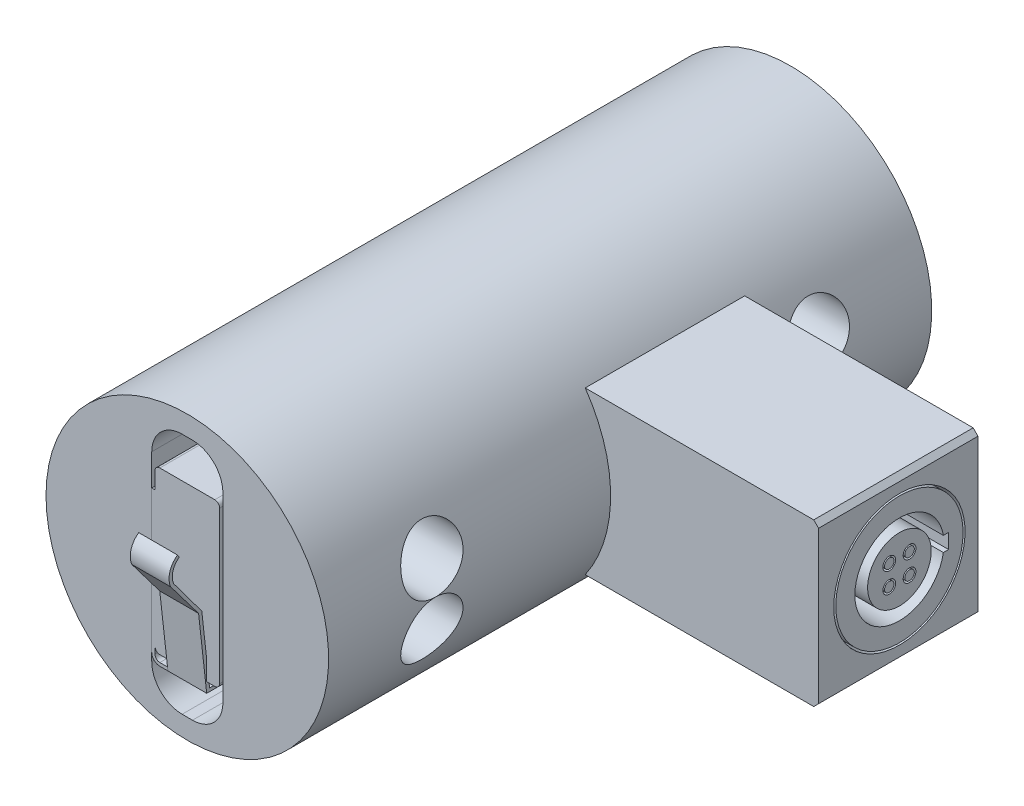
ISO-10303-21;
HEADER;
FILE_DESCRIPTION(('STEP AP214'),'2;1');
FILE_NAME('part.step','',(''),(''),'','','');
FILE_SCHEMA(('AUTOMOTIVE_DESIGN { 1 0 10303 214 1 1 1 1 }'));
ENDSEC;
DATA;
#1=APPLICATION_CONTEXT('core data for automotive mechanical design processes');
#2=APPLICATION_PROTOCOL_DEFINITION('international standard','automotive_design',2000,#1);
#3=PRODUCT_CONTEXT('',#1,'mechanical');
#4=PRODUCT('Part','Part','',(#3));
#5=PRODUCT_RELATED_PRODUCT_CATEGORY('part','',(#4));
#6=PRODUCT_DEFINITION_FORMATION('','',#4);
#7=PRODUCT_DEFINITION_CONTEXT('part definition',#1,'design');
#8=PRODUCT_DEFINITION('design','',#6,#7);
#9=PRODUCT_DEFINITION_SHAPE('','',#8);
#10=(LENGTH_UNIT() NAMED_UNIT(*) SI_UNIT(.MILLI.,.METRE.));
#11=(NAMED_UNIT(*) PLANE_ANGLE_UNIT() SI_UNIT($,.RADIAN.));
#12=(NAMED_UNIT(*) SI_UNIT($,.STERADIAN.) SOLID_ANGLE_UNIT());
#13=UNCERTAINTY_MEASURE_WITH_UNIT(LENGTH_MEASURE(1.E-05),#10,'distance_accuracy_value','');
#14=(GEOMETRIC_REPRESENTATION_CONTEXT(3) GLOBAL_UNCERTAINTY_ASSIGNED_CONTEXT((#13)) GLOBAL_UNIT_ASSIGNED_CONTEXT((#10,
#11,#12)) REPRESENTATION_CONTEXT('',''));
#15=CARTESIAN_POINT('',(0.,0.,0.));
#16=DIRECTION('',(0.,0.,1.));
#17=DIRECTION('',(1.,0.,0.));
#18=AXIS2_PLACEMENT_3D('',#15,#16,#17);
#19=CARTESIAN_POINT('',(-35.8486498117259,-2.38870821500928,-4.064));
#20=DIRECTION('',(1.,0.,0.));
#21=DIRECTION('',(0.,0.,-1.));
#22=AXIS2_PLACEMENT_3D('',#19,#20,#21);
#23=CONICAL_SURFACE('',#22,0.84211769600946,1.04740952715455);
#24=CARTESIAN_POINT('',(-36.3346087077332,-2.38870821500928,-4.06399999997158));
#25=VERTEX_POINT('',#24);
#26=VERTEX_LOOP('',#25);
#27=FACE_BOUND('',#26,.T.);
#28=CARTESIAN_POINT('',(-35.8486498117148,-2.38870821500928,-4.064));
#29=DIRECTION('',(-1.,0.,0.));
#30=DIRECTION('',(0.,0.,1.));
#31=AXIS2_PLACEMENT_3D('',#28,#29,#30);
#32=CIRCLE('',#31,0.842117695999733);
#33=CARTESIAN_POINT('',(-35.8486498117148,-2.38870821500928,-3.22188230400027));
#34=VERTEX_POINT('',#33);
#35=EDGE_CURVE('P0_E122',#34,#34,#32,.F.);
#36=ORIENTED_EDGE('',*,*,#35,.T.);
#37=EDGE_LOOP('',(#36));
#38=FACE_BOUND('',#37,.T.);
#39=ADVANCED_FACE('P0_F17',(#27,#38),#23,.F.);
#40=CARTESIAN_POINT('',(-35.848649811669,2.38870821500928,-4.064));
#41=DIRECTION('',(1.,0.,0.));
#42=DIRECTION('',(0.,0.,-1.));
#43=AXIS2_PLACEMENT_3D('',#40,#41,#42);
#44=CONICAL_SURFACE('',#43,0.842117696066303,1.04740952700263);
#45=CARTESIAN_POINT('',(-36.3346087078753,2.38870821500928,-4.06399999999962));
#46=VERTEX_POINT('',#45);
#47=VERTEX_LOOP('',#46);
#48=FACE_BOUND('',#47,.T.);
#49=CARTESIAN_POINT('',(-35.8486498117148,2.38870821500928,-4.064));
#50=DIRECTION('',(1.,0.,0.));
#51=DIRECTION('',(0.,0.,-1.));
#52=AXIS2_PLACEMENT_3D('',#49,#50,#51);
#53=CIRCLE('',#52,0.842117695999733);
#54=CARTESIAN_POINT('',(-35.8486498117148,2.38870821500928,-4.90611769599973));
#55=VERTEX_POINT('',#54);
#56=EDGE_CURVE('P0_E124',#55,#55,#53,.T.);
#57=ORIENTED_EDGE('',*,*,#56,.T.);
#58=EDGE_LOOP('',(#57));
#59=FACE_BOUND('',#58,.T.);
#60=ADVANCED_FACE('P0_F119',(#48,#59),#44,.F.);
#61=CARTESIAN_POINT('',(-35.8486498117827,-2.38870821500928,26.289));
#62=DIRECTION('',(1.,0.,0.));
#63=DIRECTION('',(0.,0.,-1.));
#64=AXIS2_PLACEMENT_3D('',#61,#62,#63);
#65=CONICAL_SURFACE('',#64,0.842117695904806,1.04740952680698);
#66=CARTESIAN_POINT('',(-36.33460870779,-2.38870821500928,26.2889999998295));
#67=VERTEX_POINT('',#66);
#68=VERTEX_LOOP('',#67);
#69=FACE_BOUND('',#68,.T.);
#70=CARTESIAN_POINT('',(-35.8486498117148,-2.38870821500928,26.289));
#71=DIRECTION('',(-1.,0.,0.));
#72=DIRECTION('',(0.,0.,1.));
#73=AXIS2_PLACEMENT_3D('',#70,#71,#72);
#74=CIRCLE('',#73,0.842117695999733);
#75=CARTESIAN_POINT('',(-35.8486498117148,-2.38870821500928,27.1311176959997));
#76=VERTEX_POINT('',#75);
#77=EDGE_CURVE('P0_E127',#76,#76,#74,.F.);
#78=ORIENTED_EDGE('',*,*,#77,.T.);
#79=EDGE_LOOP('',(#78));
#80=FACE_BOUND('',#79,.T.);
#81=ADVANCED_FACE('P0_F279',(#69,#80),#65,.F.);
#82=CARTESIAN_POINT('',(-35.848649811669,2.38870821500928,26.289));
#83=DIRECTION('',(1.,0.,0.));
#84=DIRECTION('',(0.,0.,-1.));
#85=AXIS2_PLACEMENT_3D('',#82,#83,#84);
#86=CONICAL_SURFACE('',#85,0.842117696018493,1.0474095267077);
#87=CARTESIAN_POINT('',(-36.3346087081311,2.38870821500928,26.2890000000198));
#88=VERTEX_POINT('',#87);
#89=VERTEX_LOOP('',#88);
#90=FACE_BOUND('',#89,.T.);
#91=CARTESIAN_POINT('',(-35.8486498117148,2.38870821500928,26.289));
#92=DIRECTION('',(1.,0.,0.));
#93=DIRECTION('',(0.,0.,-1.));
#94=AXIS2_PLACEMENT_3D('',#91,#92,#93);
#95=CIRCLE('',#94,0.842117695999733);
#96=CARTESIAN_POINT('',(-35.8486498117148,2.38870821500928,25.4468823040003));
#97=VERTEX_POINT('',#96);
#98=EDGE_CURVE('P0_E298',#97,#97,#95,.T.);
#99=ORIENTED_EDGE('',*,*,#98,.T.);
#100=EDGE_LOOP('',(#99));
#101=FACE_BOUND('',#100,.T.);
#102=ADVANCED_FACE('P0_F276',(#90,#101),#86,.F.);
#103=CARTESIAN_POINT('',(-37.8804224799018,-2.38870821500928,-4.064));
#104=DIRECTION('',(-1.,0.,0.));
#105=DIRECTION('',(0.,0.,1.));
#106=AXIS2_PLACEMENT_3D('',#103,#104,#105);
#107=CYLINDRICAL_SURFACE('',#106,0.842117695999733);
#108=ORIENTED_EDGE('',*,*,#35,.F.);
#109=EDGE_LOOP('',(#108));
#110=FACE_BOUND('',#109,.T.);
#111=CARTESIAN_POINT('',(-35.3025396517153,-2.38870821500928,-4.064));
#112=DIRECTION('',(-1.,0.,0.));
#113=DIRECTION('',(0.,0.,1.));
#114=AXIS2_PLACEMENT_3D('',#111,#112,#113);
#115=CIRCLE('',#114,0.842117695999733);
#116=CARTESIAN_POINT('',(-35.3025396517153,-2.38870821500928,-3.22188230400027));
#117=VERTEX_POINT('',#116);
#118=EDGE_CURVE('P0_E20',#117,#117,#115,.F.);
#119=ORIENTED_EDGE('',*,*,#118,.T.);
#120=EDGE_LOOP('',(#119));
#121=FACE_BOUND('',#120,.T.);
#122=ADVANCED_FACE('P0_F272',(#110,#121),#107,.F.);
#123=CARTESIAN_POINT('',(-37.8804224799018,2.38870821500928,-4.064));
#124=DIRECTION('',(1.,0.,0.));
#125=DIRECTION('',(0.,0.,-1.));
#126=AXIS2_PLACEMENT_3D('',#123,#124,#125);
#127=CYLINDRICAL_SURFACE('',#126,0.842117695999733);
#128=ORIENTED_EDGE('',*,*,#56,.F.);
#129=EDGE_LOOP('',(#128));
#130=FACE_BOUND('',#129,.T.);
#131=CARTESIAN_POINT('',(-35.3025396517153,2.38870821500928,-4.064));
#132=DIRECTION('',(1.,0.,0.));
#133=DIRECTION('',(0.,0.,-1.));
#134=AXIS2_PLACEMENT_3D('',#131,#132,#133);
#135=CIRCLE('',#134,0.842117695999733);
#136=CARTESIAN_POINT('',(-35.3025396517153,2.38870821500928,-4.90611769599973));
#137=VERTEX_POINT('',#136);
#138=EDGE_CURVE('P0_E292',#137,#137,#135,.T.);
#139=ORIENTED_EDGE('',*,*,#138,.T.);
#140=EDGE_LOOP('',(#139));
#141=FACE_BOUND('',#140,.T.);
#142=ADVANCED_FACE('P0_F268',(#130,#141),#127,.F.);
#143=CARTESIAN_POINT('',(-37.8804224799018,-2.38870821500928,26.289));
#144=DIRECTION('',(-1.,0.,0.));
#145=DIRECTION('',(0.,0.,1.));
#146=AXIS2_PLACEMENT_3D('',#143,#144,#145);
#147=CYLINDRICAL_SURFACE('',#146,0.842117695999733);
#148=ORIENTED_EDGE('',*,*,#77,.F.);
#149=EDGE_LOOP('',(#148));
#150=FACE_BOUND('',#149,.T.);
#151=CARTESIAN_POINT('',(-35.3025396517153,-2.38870821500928,26.289));
#152=DIRECTION('',(-1.,0.,0.));
#153=DIRECTION('',(0.,0.,1.));
#154=AXIS2_PLACEMENT_3D('',#151,#152,#153);
#155=CIRCLE('',#154,0.842117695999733);
#156=CARTESIAN_POINT('',(-35.3025396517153,-2.38870821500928,27.1311176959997));
#157=VERTEX_POINT('',#156);
#158=EDGE_CURVE('P0_E293',#157,#157,#155,.F.);
#159=ORIENTED_EDGE('',*,*,#158,.T.);
#160=EDGE_LOOP('',(#159));
#161=FACE_BOUND('',#160,.T.);
#162=ADVANCED_FACE('P0_F264',(#150,#161),#147,.F.);
#163=CARTESIAN_POINT('',(-37.8804224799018,2.38870821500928,26.289));
#164=DIRECTION('',(1.,0.,0.));
#165=DIRECTION('',(0.,0.,-1.));
#166=AXIS2_PLACEMENT_3D('',#163,#164,#165);
#167=CYLINDRICAL_SURFACE('',#166,0.842117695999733);
#168=ORIENTED_EDGE('',*,*,#98,.F.);
#169=EDGE_LOOP('',(#168));
#170=FACE_BOUND('',#169,.T.);
#171=CARTESIAN_POINT('',(-35.3025396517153,2.38870821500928,26.289));
#172=DIRECTION('',(1.,0.,0.));
#173=DIRECTION('',(0.,0.,-1.));
#174=AXIS2_PLACEMENT_3D('',#171,#172,#173);
#175=CIRCLE('',#174,0.842117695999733);
#176=CARTESIAN_POINT('',(-35.3025396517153,2.38870821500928,25.4468823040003));
#177=VERTEX_POINT('',#176);
#178=EDGE_CURVE('P0_E295',#177,#177,#175,.T.);
#179=ORIENTED_EDGE('',*,*,#178,.T.);
#180=EDGE_LOOP('',(#179));
#181=FACE_BOUND('',#180,.T.);
#182=ADVANCED_FACE('P0_F260',(#170,#181),#167,.F.);
#183=CARTESIAN_POINT('',(-84.4320000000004,0.,6.1722));
#184=DIRECTION('',(-1.,0.,0.));
#185=DIRECTION('',(0.,0.,1.));
#186=AXIS2_PLACEMENT_3D('',#183,#184,#185);
#187=CYLINDRICAL_SURFACE('',#186,4.49580000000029);
#188=CARTESIAN_POINT('',(-1.57480000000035,0.,6.1722));
#189=DIRECTION('',(-1.,0.,0.));
#190=DIRECTION('',(0.,0.,1.));
#191=AXIS2_PLACEMENT_3D('',#188,#189,#190);
#192=CIRCLE('',#191,4.49580000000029);
#193=CARTESIAN_POINT('',(-1.57480000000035,0.,10.6680000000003));
#194=VERTEX_POINT('',#193);
#195=EDGE_CURVE('P0_E302',#194,#194,#192,.T.);
#196=ORIENTED_EDGE('',*,*,#195,.F.);
#197=EDGE_LOOP('',(#196));
#198=FACE_BOUND('',#197,.T.);
#199=CARTESIAN_POINT('',(-13.0047999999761,0.,6.1722));
#200=DIRECTION('',(1.,0.,0.));
#201=DIRECTION('',(0.,0.,-1.));
#202=AXIS2_PLACEMENT_3D('',#199,#200,#201);
#203=CIRCLE('',#202,4.4957999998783);
#204=CARTESIAN_POINT('',(-13.0047999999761,0.,1.6764000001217));
#205=VERTEX_POINT('',#204);
#206=EDGE_CURVE('P0_E305',#205,#205,#203,.F.);
#207=ORIENTED_EDGE('',*,*,#206,.T.);
#208=EDGE_LOOP('',(#207));
#209=FACE_BOUND('',#208,.T.);
#210=ADVANCED_FACE('P0_F257',(#198,#209),#187,.F.);
#211=CARTESIAN_POINT('',(-31.4198000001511,0.,6.1722));
#212=DIRECTION('',(1.,0.,0.));
#213=DIRECTION('',(0.,0.,-1.));
#214=AXIS2_PLACEMENT_3D('',#211,#212,#213);
#215=CONICAL_SURFACE('',#214,3.98779999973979,1.03601586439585);
#216=CARTESIAN_POINT('',(-33.7820000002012,0.,6.17220000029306));
#217=VERTEX_POINT('',#216);
#218=VERTEX_LOOP('',#217);
#219=FACE_BOUND('',#218,.T.);
#220=CARTESIAN_POINT('',(-31.4198000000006,0.,6.1722));
#221=DIRECTION('',(-1.,0.,0.));
#222=DIRECTION('',(0.,0.,1.));
#223=AXIS2_PLACEMENT_3D('',#220,#221,#222);
#224=CIRCLE('',#223,3.9878);
#225=CARTESIAN_POINT('',(-31.4198000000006,0.,10.16));
#226=VERTEX_POINT('',#225);
#227=EDGE_CURVE('P0_E310',#226,#226,#224,.F.);
#228=ORIENTED_EDGE('',*,*,#227,.T.);
#229=EDGE_LOOP('',(#228));
#230=FACE_BOUND('',#229,.T.);
#231=ADVANCED_FACE('P0_F253',(#219,#230),#215,.F.);
#232=CARTESIAN_POINT('',(-35.3025396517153,-1.29648789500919,-4.064));
#233=DIRECTION('',(-1.,0.,0.));
#234=DIRECTION('',(0.,0.,1.));
#235=AXIS2_PLACEMENT_3D('',#232,#233,#234);
#236=PLANE('',#235);
#237=CARTESIAN_POINT('',(-35.3025396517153,-2.38870821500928,-4.064));
#238=DIRECTION('',(-1.,0.,0.));
#239=DIRECTION('',(0.,0.,1.));
#240=AXIS2_PLACEMENT_3D('',#237,#238,#239);
#241=CIRCLE('',#240,1.09222032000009);
#242=CARTESIAN_POINT('',(-35.3025396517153,-2.38870821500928,-2.97177967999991));
#243=VERTEX_POINT('',#242);
#244=EDGE_CURVE('P0_E306',#243,#243,#241,.F.);
#245=ORIENTED_EDGE('',*,*,#244,.T.);
#246=EDGE_LOOP('',(#245));
#247=FACE_BOUND('',#246,.T.);
#248=ORIENTED_EDGE('',*,*,#118,.F.);
#249=EDGE_LOOP('',(#248));
#250=FACE_BOUND('',#249,.T.);
#251=ADVANCED_FACE('P0_F249',(#247,#250),#236,.F.);
#252=CARTESIAN_POINT('',(-35.3025396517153,1.29648789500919,-4.064));
#253=DIRECTION('',(-1.,0.,0.));
#254=DIRECTION('',(0.,0.,1.));
#255=AXIS2_PLACEMENT_3D('',#252,#253,#254);
#256=PLANE('',#255);
#257=ORIENTED_EDGE('',*,*,#138,.F.);
#258=EDGE_LOOP('',(#257));
#259=FACE_BOUND('',#258,.T.);
#260=CARTESIAN_POINT('',(-35.3025396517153,2.38870821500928,-4.064));
#261=DIRECTION('',(1.,0.,0.));
#262=DIRECTION('',(0.,0.,-1.));
#263=AXIS2_PLACEMENT_3D('',#260,#261,#262);
#264=CIRCLE('',#263,1.09222032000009);
#265=CARTESIAN_POINT('',(-35.3025396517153,2.38870821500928,-5.15622032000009));
#266=VERTEX_POINT('',#265);
#267=EDGE_CURVE('P0_E309',#266,#266,#264,.T.);
#268=ORIENTED_EDGE('',*,*,#267,.T.);
#269=EDGE_LOOP('',(#268));
#270=FACE_BOUND('',#269,.T.);
#271=ADVANCED_FACE('P0_F245',(#259,#270),#256,.F.);
#272=CARTESIAN_POINT('',(-35.3025396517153,-1.29648789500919,26.289));
#273=DIRECTION('',(-1.,0.,0.));
#274=DIRECTION('',(0.,0.,1.));
#275=AXIS2_PLACEMENT_3D('',#272,#273,#274);
#276=PLANE('',#275);
#277=CARTESIAN_POINT('',(-35.3025396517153,-2.38870821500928,26.289));
#278=DIRECTION('',(-1.,0.,0.));
#279=DIRECTION('',(0.,0.,1.));
#280=AXIS2_PLACEMENT_3D('',#277,#278,#279);
#281=CIRCLE('',#280,1.09222032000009);
#282=CARTESIAN_POINT('',(-35.3025396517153,-2.38870821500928,27.3812203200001));
#283=VERTEX_POINT('',#282);
#284=EDGE_CURVE('P0_E313',#283,#283,#281,.F.);
#285=ORIENTED_EDGE('',*,*,#284,.T.);
#286=EDGE_LOOP('',(#285));
#287=FACE_BOUND('',#286,.T.);
#288=ORIENTED_EDGE('',*,*,#158,.F.);
#289=EDGE_LOOP('',(#288));
#290=FACE_BOUND('',#289,.T.);
#291=ADVANCED_FACE('P0_F241',(#287,#290),#276,.F.);
#292=CARTESIAN_POINT('',(-35.3025396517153,1.29648789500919,26.289));
#293=DIRECTION('',(-1.,0.,0.));
#294=DIRECTION('',(0.,0.,1.));
#295=AXIS2_PLACEMENT_3D('',#292,#293,#294);
#296=PLANE('',#295);
#297=ORIENTED_EDGE('',*,*,#178,.F.);
#298=EDGE_LOOP('',(#297));
#299=FACE_BOUND('',#298,.T.);
#300=CARTESIAN_POINT('',(-35.3025396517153,2.38870821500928,26.289));
#301=DIRECTION('',(1.,0.,0.));
#302=DIRECTION('',(0.,0.,-1.));
#303=AXIS2_PLACEMENT_3D('',#300,#301,#302);
#304=CIRCLE('',#303,1.09222032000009);
#305=CARTESIAN_POINT('',(-35.3025396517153,2.38870821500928,25.1967796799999));
#306=VERTEX_POINT('',#305);
#307=EDGE_CURVE('P0_E316',#306,#306,#304,.T.);
#308=ORIENTED_EDGE('',*,*,#307,.T.);
#309=EDGE_LOOP('',(#308));
#310=FACE_BOUND('',#309,.T.);
#311=ADVANCED_FACE('P0_F237',(#299,#310),#296,.F.);
#312=CARTESIAN_POINT('',(-1.57480000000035,5.15619999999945,6.1722));
#313=DIRECTION('',(1.,0.,0.));
#314=DIRECTION('',(0.,0.,-1.));
#315=AXIS2_PLACEMENT_3D('',#312,#313,#314);
#316=PLANE('',#315);
#317=ORIENTED_EDGE('',*,*,#195,.T.);
#318=EDGE_LOOP('',(#317));
#319=FACE_BOUND('',#318,.T.);
#320=CARTESIAN_POINT('',(-1.57480000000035,0.,6.1722));
#321=DIRECTION('',(-1.,0.,0.));
#322=DIRECTION('',(0.,0.,1.));
#323=AXIS2_PLACEMENT_3D('',#320,#321,#322);
#324=CIRCLE('',#323,5.15619999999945);
#325=CARTESIAN_POINT('',(-1.57480000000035,0.,11.3283999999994));
#326=VERTEX_POINT('',#325);
#327=EDGE_CURVE('P0_E320',#326,#326,#324,.F.);
#328=ORIENTED_EDGE('',*,*,#327,.T.);
#329=EDGE_LOOP('',(#328));
#330=FACE_BOUND('',#329,.T.);
#331=ADVANCED_FACE('P0_F233',(#319,#330),#316,.T.);
#332=CARTESIAN_POINT('',(-13.0048000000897,0.,6.1722));
#333=DIRECTION('',(1.,0.,0.));
#334=DIRECTION('',(0.,1.,0.));
#335=AXIS2_PLACEMENT_3D('',#332,#333,#334);
#336=CONICAL_SURFACE('',#335,4.49579999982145,0.656547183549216);
#337=CARTESIAN_POINT('',(-13.6640376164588,0.,6.1722));
#338=DIRECTION('',(-1.,0.,0.));
#339=DIRECTION('',(0.,0.,1.));
#340=AXIS2_PLACEMENT_3D('',#337,#338,#339);
#341=CIRCLE('',#340,3.9878);
#342=CARTESIAN_POINT('',(-13.6640376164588,0.,10.16));
#343=VERTEX_POINT('',#342);
#344=EDGE_CURVE('P0_E329',#343,#343,#341,.T.);
#345=ORIENTED_EDGE('',*,*,#344,.T.);
#346=EDGE_LOOP('',(#345));
#347=FACE_BOUND('',#346,.T.);
#348=ORIENTED_EDGE('',*,*,#206,.F.);
#349=EDGE_LOOP('',(#348));
#350=FACE_BOUND('',#349,.T.);
#351=ADVANCED_FACE('P0_F229',(#347,#350),#336,.F.);
#352=CARTESIAN_POINT('',(-84.4320000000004,0.,6.1722));
#353=DIRECTION('',(-1.,0.,0.));
#354=DIRECTION('',(0.,0.,1.));
#355=AXIS2_PLACEMENT_3D('',#352,#353,#354);
#356=CYLINDRICAL_SURFACE('',#355,3.9878);
#357=ORIENTED_EDGE('',*,*,#227,.F.);
#358=EDGE_LOOP('',(#357));
#359=FACE_BOUND('',#358,.T.);
#360=CARTESIAN_POINT('',(-30.226,0.,6.1722));
#361=DIRECTION('',(-1.,0.,0.));
#362=DIRECTION('',(0.,0.,1.));
#363=AXIS2_PLACEMENT_3D('',#360,#361,#362);
#364=CIRCLE('',#363,3.9878);
#365=CARTESIAN_POINT('',(-30.226,0.,10.16));
#366=VERTEX_POINT('',#365);
#367=EDGE_CURVE('P0_E325',#366,#366,#364,.F.);
#368=ORIENTED_EDGE('',*,*,#367,.T.);
#369=EDGE_LOOP('',(#368));
#370=FACE_BOUND('',#369,.T.);
#371=ADVANCED_FACE('P0_F225',(#359,#370),#356,.F.);
#372=CARTESIAN_POINT('',(-37.8804224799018,-2.38870821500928,-4.064));
#373=DIRECTION('',(-1.,0.,0.));
#374=DIRECTION('',(0.,0.,1.));
#375=AXIS2_PLACEMENT_3D('',#372,#373,#374);
#376=CYLINDRICAL_SURFACE('',#375,1.09222032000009);
#377=ORIENTED_EDGE('',*,*,#244,.F.);
#378=EDGE_LOOP('',(#377));
#379=FACE_BOUND('',#378,.T.);
#380=CARTESIAN_POINT('',(-30.226,-2.38870821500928,-4.064));
#381=DIRECTION('',(-1.,0.,0.));
#382=DIRECTION('',(0.,0.,1.));
#383=AXIS2_PLACEMENT_3D('',#380,#381,#382);
#384=CIRCLE('',#383,1.09222032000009);
#385=CARTESIAN_POINT('',(-30.226,-2.38870821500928,-2.97177967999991));
#386=VERTEX_POINT('',#385);
#387=EDGE_CURVE('P0_E328',#386,#386,#384,.F.);
#388=ORIENTED_EDGE('',*,*,#387,.T.);
#389=EDGE_LOOP('',(#388));
#390=FACE_BOUND('',#389,.T.);
#391=ADVANCED_FACE('P0_F221',(#379,#390),#376,.F.);
#392=CARTESIAN_POINT('',(-37.8804224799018,2.38870821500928,-4.064));
#393=DIRECTION('',(1.,0.,0.));
#394=DIRECTION('',(0.,0.,-1.));
#395=AXIS2_PLACEMENT_3D('',#392,#393,#394);
#396=CYLINDRICAL_SURFACE('',#395,1.09222032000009);
#397=ORIENTED_EDGE('',*,*,#267,.F.);
#398=EDGE_LOOP('',(#397));
#399=FACE_BOUND('',#398,.T.);
#400=CARTESIAN_POINT('',(-30.226,2.38870821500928,-4.064));
#401=DIRECTION('',(1.,0.,0.));
#402=DIRECTION('',(0.,0.,-1.));
#403=AXIS2_PLACEMENT_3D('',#400,#401,#402);
#404=CIRCLE('',#403,1.09222032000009);
#405=CARTESIAN_POINT('',(-30.226,2.38870821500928,-5.15622032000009));
#406=VERTEX_POINT('',#405);
#407=EDGE_CURVE('P0_E332',#406,#406,#404,.T.);
#408=ORIENTED_EDGE('',*,*,#407,.T.);
#409=EDGE_LOOP('',(#408));
#410=FACE_BOUND('',#409,.T.);
#411=ADVANCED_FACE('P0_F217',(#399,#410),#396,.F.);
#412=CARTESIAN_POINT('',(-37.8804224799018,-2.38870821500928,26.289));
#413=DIRECTION('',(-1.,0.,0.));
#414=DIRECTION('',(0.,0.,1.));
#415=AXIS2_PLACEMENT_3D('',#412,#413,#414);
#416=CYLINDRICAL_SURFACE('',#415,1.09222032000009);
#417=ORIENTED_EDGE('',*,*,#284,.F.);
#418=EDGE_LOOP('',(#417));
#419=FACE_BOUND('',#418,.T.);
#420=CARTESIAN_POINT('',(-30.226,-2.38870821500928,26.289));
#421=DIRECTION('',(-1.,0.,0.));
#422=DIRECTION('',(0.,0.,1.));
#423=AXIS2_PLACEMENT_3D('',#420,#421,#422);
#424=CIRCLE('',#423,1.09222032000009);
#425=CARTESIAN_POINT('',(-30.226,-2.38870821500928,27.3812203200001));
#426=VERTEX_POINT('',#425);
#427=EDGE_CURVE('P0_E335',#426,#426,#424,.F.);
#428=ORIENTED_EDGE('',*,*,#427,.T.);
#429=EDGE_LOOP('',(#428));
#430=FACE_BOUND('',#429,.T.);
#431=ADVANCED_FACE('P0_F213',(#419,#430),#416,.F.);
#432=CARTESIAN_POINT('',(-37.8804224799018,2.38870821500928,26.289));
#433=DIRECTION('',(1.,0.,0.));
#434=DIRECTION('',(0.,0.,-1.));
#435=AXIS2_PLACEMENT_3D('',#432,#433,#434);
#436=CYLINDRICAL_SURFACE('',#435,1.09222032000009);
#437=ORIENTED_EDGE('',*,*,#307,.F.);
#438=EDGE_LOOP('',(#437));
#439=FACE_BOUND('',#438,.T.);
#440=CARTESIAN_POINT('',(-30.226,2.38870821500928,26.289));
#441=DIRECTION('',(1.,0.,0.));
#442=DIRECTION('',(0.,0.,-1.));
#443=AXIS2_PLACEMENT_3D('',#440,#441,#442);
#444=CIRCLE('',#443,1.09222032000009);
#445=CARTESIAN_POINT('',(-30.226,2.38870821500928,25.1967796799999));
#446=VERTEX_POINT('',#445);
#447=EDGE_CURVE('P0_E338',#446,#446,#444,.T.);
#448=ORIENTED_EDGE('',*,*,#447,.T.);
#449=EDGE_LOOP('',(#448));
#450=FACE_BOUND('',#449,.T.);
#451=ADVANCED_FACE('P0_F209',(#439,#450),#436,.F.);
#452=CARTESIAN_POINT('',(-27.0256000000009,9.52389178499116,52.2733290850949));
#453=DIRECTION('',(-1.36592399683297E-13,1.,0.));
#454=DIRECTION('',(-1.,-1.36592399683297E-13,0.));
#455=AXIS2_PLACEMENT_3D('',#452,#453,#454);
#456=PLANE('',#455);
#457=DIRECTION('',(-1.,-1.36592399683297E-13,0.));
#458=VECTOR('',#457,1.);
#459=CARTESIAN_POINT('',(-27.0256000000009,9.52389178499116,-12.7));
#460=LINE('',#459,#458);
#461=CARTESIAN_POINT('',(-27.0256000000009,9.52389178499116,-12.7));
#462=VERTEX_POINT('',#461);
#463=CARTESIAN_POINT('',(-27.8384000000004,9.52389178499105,-12.7));
#464=VERTEX_POINT('',#463);
#465=EDGE_CURVE('P0_E466',#462,#464,#460,.T.);
#466=ORIENTED_EDGE('',*,*,#465,.F.);
#467=DIRECTION('',(0.,0.,-1.));
#468=VECTOR('',#467,1.);
#469=CARTESIAN_POINT('',(-27.0256000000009,9.52389178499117,52.2733290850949));
#470=LINE('',#469,#468);
#471=CARTESIAN_POINT('',(-27.0256000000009,9.52389178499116,34.671));
#472=VERTEX_POINT('',#471);
#473=EDGE_CURVE('P0_E441',#462,#472,#470,.F.);
#474=ORIENTED_EDGE('',*,*,#473,.T.);
#475=DIRECTION('',(-1.,-1.36592399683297E-13,0.));
#476=VECTOR('',#475,1.);
#477=CARTESIAN_POINT('',(-27.0256000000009,9.52389178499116,34.671));
#478=LINE('',#477,#476);
#479=CARTESIAN_POINT('',(-27.8384000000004,9.52389178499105,34.671));
#480=VERTEX_POINT('',#479);
#481=EDGE_CURVE('P0_E319',#480,#472,#478,.F.);
#482=ORIENTED_EDGE('',*,*,#481,.F.);
#483=DIRECTION('',(0.,0.,-1.));
#484=VECTOR('',#483,1.);
#485=CARTESIAN_POINT('',(-27.8384000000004,9.52389178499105,52.2733290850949));
#486=LINE('',#485,#484);
#487=EDGE_CURVE('P0_E341',#480,#464,#486,.T.);
#488=ORIENTED_EDGE('',*,*,#487,.T.);
#489=EDGE_LOOP('',(#466,#474,#482,#488));
#490=FACE_BOUND('',#489,.T.);
#491=ADVANCED_FACE('P0_F205',(#490),#456,.F.);
#492=CARTESIAN_POINT('',(-27.0256000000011,-9.52610821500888,52.2733290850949));
#493=DIRECTION('',(-2.39036699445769E-13,-1.,0.));
#494=DIRECTION('',(1.,-2.39036699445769E-13,0.));
#495=AXIS2_PLACEMENT_3D('',#492,#493,#494);
#496=PLANE('',#495);
#497=DIRECTION('',(1.,-2.39036699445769E-13,0.));
#498=VECTOR('',#497,1.);
#499=CARTESIAN_POINT('',(-27.0256000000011,-9.52610821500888,-12.7));
#500=LINE('',#499,#498);
#501=CARTESIAN_POINT('',(-27.8384000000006,-9.52610821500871,-12.7));
#502=VERTEX_POINT('',#501);
#503=CARTESIAN_POINT('',(-27.0256000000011,-9.52610821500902,-12.7));
#504=VERTEX_POINT('',#503);
#505=EDGE_CURVE('P0_E324',#502,#504,#500,.T.);
#506=ORIENTED_EDGE('',*,*,#505,.F.);
#507=DIRECTION('',(0.,0.,-1.));
#508=VECTOR('',#507,1.);
#509=CARTESIAN_POINT('',(-27.8384000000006,-9.52610821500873,52.2733290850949));
#510=LINE('',#509,#508);
#511=CARTESIAN_POINT('',(-27.8384000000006,-9.52610821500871,34.671));
#512=VERTEX_POINT('',#511);
#513=EDGE_CURVE('P0_E413',#502,#512,#510,.F.);
#514=ORIENTED_EDGE('',*,*,#513,.T.);
#515=DIRECTION('',(1.,-2.39036699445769E-13,0.));
#516=VECTOR('',#515,1.);
#517=CARTESIAN_POINT('',(-27.0256000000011,-9.52610821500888,34.671));
#518=LINE('',#517,#516);
#519=CARTESIAN_POINT('',(-27.0256000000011,-9.52610821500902,34.671));
#520=VERTEX_POINT('',#519);
#521=EDGE_CURVE('P0_E464',#520,#512,#518,.F.);
#522=ORIENTED_EDGE('',*,*,#521,.F.);
#523=DIRECTION('',(0.,0.,-1.));
#524=VECTOR('',#523,1.);
#525=CARTESIAN_POINT('',(-27.0256000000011,-9.52610821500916,52.2733290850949));
#526=LINE('',#525,#524);
#527=EDGE_CURVE('P0_E436',#520,#504,#526,.T.);
#528=ORIENTED_EDGE('',*,*,#527,.T.);
#529=EDGE_LOOP('',(#506,#514,#522,#528));
#530=FACE_BOUND('',#529,.T.);
#531=ADVANCED_FACE('P0_F201',(#530),#496,.F.);
#532=CARTESIAN_POINT('',(-84.4320000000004,0.,6.1722));
#533=DIRECTION('',(-1.,0.,0.));
#534=DIRECTION('',(0.,0.,1.));
#535=AXIS2_PLACEMENT_3D('',#532,#533,#534);
#536=CYLINDRICAL_SURFACE('',#535,5.15619999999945);
#537=ORIENTED_EDGE('',*,*,#327,.F.);
#538=EDGE_LOOP('',(#537));
#539=FACE_BOUND('',#538,.T.);
#540=CARTESIAN_POINT('',(0.,0.,6.1722));
#541=DIRECTION('',(-1.,0.,0.));
#542=DIRECTION('',(0.,0.,1.));
#543=AXIS2_PLACEMENT_3D('',#540,#541,#542);
#544=CIRCLE('',#543,5.15619999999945);
#545=CARTESIAN_POINT('',(0.,0.,11.3283999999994));
#546=VERTEX_POINT('',#545);
#547=EDGE_CURVE('P0_E342',#546,#546,#544,.F.);
#548=ORIENTED_EDGE('',*,*,#547,.T.);
#549=EDGE_LOOP('',(#548));
#550=FACE_BOUND('',#549,.T.);
#551=ADVANCED_FACE('P0_F197',(#539,#550),#536,.F.);
#552=CARTESIAN_POINT('',(0.,5.969,12.5222));
#553=DIRECTION('',(-0.707106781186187,-0.707106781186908,0.));
#554=DIRECTION('',(0.707106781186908,-0.707106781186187,0.));
#555=AXIS2_PLACEMENT_3D('',#552,#553,#554);
#556=PLANE('',#555);
#557=DIRECTION('',(0.707106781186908,-0.707106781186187,0.));
#558=VECTOR('',#557,1.);
#559=CARTESIAN_POINT('',(0.,5.969,12.5222));
#560=LINE('',#559,#558);
#561=CARTESIAN_POINT('',(0.,5.969,12.5222));
#562=VERTEX_POINT('',#561);
#563=CARTESIAN_POINT('',(-0.381000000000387,6.35000000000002,12.5222));
#564=VERTEX_POINT('',#563);
#565=EDGE_CURVE('P0_E452',#562,#564,#560,.F.);
#566=ORIENTED_EDGE('',*,*,#565,.F.);
#567=DIRECTION('',(0.,0.,1.));
#568=VECTOR('',#567,1.);
#569=CARTESIAN_POINT('',(0.,5.969,12.5222));
#570=LINE('',#569,#568);
#571=CARTESIAN_POINT('',(0.,5.969,0.));
#572=VERTEX_POINT('',#571);
#573=EDGE_CURVE('P0_E397',#562,#572,#570,.F.);
#574=ORIENTED_EDGE('',*,*,#573,.T.);
#575=DIRECTION('',(0.707106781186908,-0.707106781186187,0.));
#576=VECTOR('',#575,1.);
#577=CARTESIAN_POINT('',(0.,5.969,0.));
#578=LINE('',#577,#576);
#579=CARTESIAN_POINT('',(-0.381000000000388,6.35000000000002,0.));
#580=VERTEX_POINT('',#579);
#581=EDGE_CURVE('P0_E323',#580,#572,#578,.T.);
#582=ORIENTED_EDGE('',*,*,#581,.F.);
#583=DIRECTION('',(0.,0.,-1.));
#584=VECTOR('',#583,1.);
#585=CARTESIAN_POINT('',(-0.381000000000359,6.35,12.5222));
#586=LINE('',#585,#584);
#587=EDGE_CURVE('P0_E351',#580,#564,#586,.F.);
#588=ORIENTED_EDGE('',*,*,#587,.T.);
#589=EDGE_LOOP('',(#566,#574,#582,#588));
#590=FACE_BOUND('',#589,.T.);
#591=ADVANCED_FACE('P0_F193',(#590),#556,.F.);
#592=CARTESIAN_POINT('',(-84.4320000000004,0.,6.1722));
#593=DIRECTION('',(-1.,0.,0.));
#594=DIRECTION('',(0.,0.,1.));
#595=AXIS2_PLACEMENT_3D('',#592,#593,#594);
#596=CYLINDRICAL_SURFACE('',#595,3.9878);
#597=ORIENTED_EDGE('',*,*,#344,.F.);
#598=EDGE_LOOP('',(#597));
#599=FACE_BOUND('',#598,.T.);
#600=CARTESIAN_POINT('',(-24.6380000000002,0.,6.1722));
#601=DIRECTION('',(-1.,0.,0.));
#602=DIRECTION('',(0.,0.,1.));
#603=AXIS2_PLACEMENT_3D('',#600,#601,#602);
#604=CIRCLE('',#603,3.9878);
#605=CARTESIAN_POINT('',(-24.6380000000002,0.,10.16));
#606=VERTEX_POINT('',#605);
#607=EDGE_CURVE('P0_E355',#606,#606,#604,.T.);
#608=ORIENTED_EDGE('',*,*,#607,.T.);
#609=EDGE_LOOP('',(#608));
#610=FACE_BOUND('',#609,.T.);
#611=ADVANCED_FACE('P0_F189',(#599,#610),#596,.F.);
#612=CARTESIAN_POINT('',(-30.226,-7.13850821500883,52.2733290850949));
#613=DIRECTION('',(-1.,0.,0.));
#614=DIRECTION('',(0.,-1.,0.));
#615=AXIS2_PLACEMENT_3D('',#612,#613,#614);
#616=PLANE('',#615);
#617=ORIENTED_EDGE('',*,*,#447,.F.);
#618=EDGE_LOOP('',(#617));
#619=FACE_BOUND('',#618,.T.);
#620=ORIENTED_EDGE('',*,*,#427,.F.);
#621=EDGE_LOOP('',(#620));
#622=FACE_BOUND('',#621,.T.);
#623=ORIENTED_EDGE('',*,*,#407,.F.);
#624=EDGE_LOOP('',(#623));
#625=FACE_BOUND('',#624,.T.);
#626=ORIENTED_EDGE('',*,*,#387,.F.);
#627=EDGE_LOOP('',(#626));
#628=FACE_BOUND('',#627,.T.);
#629=ORIENTED_EDGE('',*,*,#367,.F.);
#630=EDGE_LOOP('',(#629));
#631=FACE_BOUND('',#630,.T.);
#632=DIRECTION('',(0.,1.,0.));
#633=VECTOR('',#632,1.);
#634=CARTESIAN_POINT('',(-30.226,0.,-12.7));
#635=LINE('',#634,#633);
#636=CARTESIAN_POINT('',(-30.226,-7.13850821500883,-12.7));
#637=VERTEX_POINT('',#636);
#638=CARTESIAN_POINT('',(-30.226,7.13629178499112,-12.7));
#639=VERTEX_POINT('',#638);
#640=EDGE_CURVE('P0_E375',#637,#639,#635,.T.);
#641=ORIENTED_EDGE('',*,*,#640,.T.);
#642=DIRECTION('',(0.,0.,-1.));
#643=VECTOR('',#642,1.);
#644=CARTESIAN_POINT('',(-30.226,7.13629178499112,52.2733290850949));
#645=LINE('',#644,#643);
#646=CARTESIAN_POINT('',(-30.226,7.13629178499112,34.671));
#647=VERTEX_POINT('',#646);
#648=EDGE_CURVE('P0_E446',#639,#647,#645,.F.);
#649=ORIENTED_EDGE('',*,*,#648,.T.);
#650=DIRECTION('',(0.,1.,0.));
#651=VECTOR('',#650,1.);
#652=CARTESIAN_POINT('',(-30.226,0.,34.671));
#653=LINE('',#652,#651);
#654=CARTESIAN_POINT('',(-30.226,-7.13850821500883,34.671));
#655=VERTEX_POINT('',#654);
#656=EDGE_CURVE('P0_E363',#655,#647,#653,.T.);
#657=ORIENTED_EDGE('',*,*,#656,.F.);
#658=DIRECTION('',(0.,0.,-1.));
#659=VECTOR('',#658,1.);
#660=CARTESIAN_POINT('',(-30.2259999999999,-7.13850821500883,52.2733290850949));
#661=LINE('',#660,#659);
#662=EDGE_CURVE('P0_E434',#655,#637,#661,.T.);
#663=ORIENTED_EDGE('',*,*,#662,.T.);
#664=EDGE_LOOP('',(#641,#649,#657,#663));
#665=FACE_BOUND('',#664,.T.);
#666=ADVANCED_FACE('P0_F185',(#619,#622,#625,#628,#631,#665),#616,.F.);
#667=CARTESIAN_POINT('',(-27.8384,7.13629178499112,52.2733290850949));
#668=DIRECTION('',(0.,0.,-1.));
#669=DIRECTION('',(-1.,0.,0.));
#670=AXIS2_PLACEMENT_3D('',#667,#668,#669);
#671=CYLINDRICAL_SURFACE('',#670,2.38759999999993);
#672=CARTESIAN_POINT('',(-27.8384,7.13629178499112,-12.7));
#673=DIRECTION('',(0.,0.,-1.));
#674=DIRECTION('',(-1.,0.,0.));
#675=AXIS2_PLACEMENT_3D('',#672,#673,#674);
#676=CIRCLE('',#675,2.38759999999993);
#677=EDGE_CURVE('P0_E371',#639,#464,#676,.T.);
#678=ORIENTED_EDGE('',*,*,#677,.T.);
#679=ORIENTED_EDGE('',*,*,#487,.F.);
#680=CARTESIAN_POINT('',(-27.8384,7.13629178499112,34.671));
#681=DIRECTION('',(0.,0.,-1.));
#682=DIRECTION('',(-1.,0.,0.));
#683=AXIS2_PLACEMENT_3D('',#680,#681,#682);
#684=CIRCLE('',#683,2.38759999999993);
#685=EDGE_CURVE('P0_E364',#647,#480,#684,.T.);
#686=ORIENTED_EDGE('',*,*,#685,.F.);
#687=ORIENTED_EDGE('',*,*,#648,.F.);
#688=EDGE_LOOP('',(#678,#679,#686,#687));
#689=FACE_BOUND('',#688,.T.);
#690=ADVANCED_FACE('P0_F181',(#689),#671,.F.);
#691=CARTESIAN_POINT('',(-27.0256000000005,7.13629178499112,52.2733290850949));
#692=DIRECTION('',(0.,0.,-1.));
#693=DIRECTION('',(-1.,0.,0.));
#694=AXIS2_PLACEMENT_3D('',#691,#692,#693);
#695=CYLINDRICAL_SURFACE('',#694,2.38760000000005);
#696=CARTESIAN_POINT('',(-27.0256000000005,7.13629178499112,-12.7));
#697=DIRECTION('',(0.,0.,-1.));
#698=DIRECTION('',(-1.,0.,0.));
#699=AXIS2_PLACEMENT_3D('',#696,#697,#698);
#700=CIRCLE('',#699,2.38760000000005);
#701=CARTESIAN_POINT('',(-24.6380000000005,7.13629178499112,-12.7));
#702=VERTEX_POINT('',#701);
#703=EDGE_CURVE('P0_E374',#462,#702,#700,.T.);
#704=ORIENTED_EDGE('',*,*,#703,.T.);
#705=DIRECTION('',(0.,0.,1.));
#706=VECTOR('',#705,1.);
#707=CARTESIAN_POINT('',(-24.6380000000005,7.13629178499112,52.2733290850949));
#708=LINE('',#707,#706);
#709=CARTESIAN_POINT('',(-24.6380000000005,7.13629178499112,34.671));
#710=VERTEX_POINT('',#709);
#711=EDGE_CURVE('P0_E358',#702,#710,#708,.T.);
#712=ORIENTED_EDGE('',*,*,#711,.T.);
#713=CARTESIAN_POINT('',(-27.0256000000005,7.13629178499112,34.671));
#714=DIRECTION('',(0.,0.,-1.));
#715=DIRECTION('',(-1.,0.,0.));
#716=AXIS2_PLACEMENT_3D('',#713,#714,#715);
#717=CIRCLE('',#716,2.38760000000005);
#718=EDGE_CURVE('P0_E367',#472,#710,#717,.T.);
#719=ORIENTED_EDGE('',*,*,#718,.F.);
#720=ORIENTED_EDGE('',*,*,#473,.F.);
#721=EDGE_LOOP('',(#704,#712,#719,#720));
#722=FACE_BOUND('',#721,.T.);
#723=ADVANCED_FACE('P0_F178',(#722),#695,.F.);
#724=CARTESIAN_POINT('',(-27.0256000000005,-7.13850821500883,52.2733290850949));
#725=DIRECTION('',(0.,0.,-1.));
#726=DIRECTION('',(-1.,0.,0.));
#727=AXIS2_PLACEMENT_3D('',#724,#725,#726);
#728=CYLINDRICAL_SURFACE('',#727,2.38760000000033);
#729=CARTESIAN_POINT('',(-27.0256000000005,-7.13850821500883,-12.7));
#730=DIRECTION('',(0.,0.,-1.));
#731=DIRECTION('',(-1.,0.,0.));
#732=AXIS2_PLACEMENT_3D('',#729,#730,#731);
#733=CIRCLE('',#732,2.38760000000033);
#734=CARTESIAN_POINT('',(-24.6380000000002,-7.13850821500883,-12.7));
#735=VERTEX_POINT('',#734);
#736=EDGE_CURVE('P0_E377',#735,#504,#733,.T.);
#737=ORIENTED_EDGE('',*,*,#736,.T.);
#738=ORIENTED_EDGE('',*,*,#527,.F.);
#739=CARTESIAN_POINT('',(-27.0256000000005,-7.13850821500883,34.671));
#740=DIRECTION('',(0.,0.,-1.));
#741=DIRECTION('',(-1.,0.,0.));
#742=AXIS2_PLACEMENT_3D('',#739,#740,#741);
#743=CIRCLE('',#742,2.38760000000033);
#744=CARTESIAN_POINT('',(-24.6380000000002,-7.13850821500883,34.671));
#745=VERTEX_POINT('',#744);
#746=EDGE_CURVE('P0_E98',#745,#520,#743,.T.);
#747=ORIENTED_EDGE('',*,*,#746,.F.);
#748=DIRECTION('',(0.,0.,1.));
#749=VECTOR('',#748,1.);
#750=CARTESIAN_POINT('',(-24.6379999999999,-7.13850821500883,52.2733290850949));
#751=LINE('',#750,#749);
#752=EDGE_CURVE('P0_E354',#745,#735,#751,.F.);
#753=ORIENTED_EDGE('',*,*,#752,.T.);
#754=EDGE_LOOP('',(#737,#738,#747,#753));
#755=FACE_BOUND('',#754,.T.);
#756=ADVANCED_FACE('P0_F174',(#755),#728,.F.);
#757=CARTESIAN_POINT('',(-27.8384,-7.13850821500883,52.2733290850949));
#758=DIRECTION('',(0.,0.,-1.));
#759=DIRECTION('',(-1.,0.,0.));
#760=AXIS2_PLACEMENT_3D('',#757,#758,#759);
#761=CYLINDRICAL_SURFACE('',#760,2.3875999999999);
#762=CARTESIAN_POINT('',(-27.8384,-7.13850821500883,-12.7));
#763=DIRECTION('',(0.,0.,-1.));
#764=DIRECTION('',(-1.,0.,0.));
#765=AXIS2_PLACEMENT_3D('',#762,#763,#764);
#766=CIRCLE('',#765,2.3875999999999);
#767=EDGE_CURVE('P0_E161',#502,#637,#766,.T.);
#768=ORIENTED_EDGE('',*,*,#767,.T.);
#769=ORIENTED_EDGE('',*,*,#662,.F.);
#770=CARTESIAN_POINT('',(-27.8384,-7.13850821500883,34.671));
#771=DIRECTION('',(0.,0.,-1.));
#772=DIRECTION('',(-1.,0.,0.));
#773=AXIS2_PLACEMENT_3D('',#770,#771,#772);
#774=CIRCLE('',#773,2.3875999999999);
#775=EDGE_CURVE('P0_E360',#512,#655,#774,.T.);
#776=ORIENTED_EDGE('',*,*,#775,.F.);
#777=ORIENTED_EDGE('',*,*,#513,.F.);
#778=EDGE_LOOP('',(#768,#769,#776,#777));
#779=FACE_BOUND('',#778,.T.);
#780=ADVANCED_FACE('P0_F168',(#779),#761,.F.);
#781=CARTESIAN_POINT('',(-37.8804224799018,2.38870821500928,26.289));
#782=DIRECTION('',(-1.,0.,0.));
#783=DIRECTION('',(0.,0.,1.));
#784=AXIS2_PLACEMENT_3D('',#781,#782,#783);
#785=CYLINDRICAL_SURFACE('',#784,2.38760000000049);
#786=CARTESIAN_POINT('',(-24.6380000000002,2.38870821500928,26.289));
#787=DIRECTION('',(-1.,0.,0.));
#788=DIRECTION('',(0.,0.,1.));
#789=AXIS2_PLACEMENT_3D('',#786,#787,#788);
#790=CIRCLE('',#789,2.38760000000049);
#791=CARTESIAN_POINT('',(-24.6380000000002,2.38870821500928,28.6766000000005));
#792=VERTEX_POINT('',#791);
#793=EDGE_CURVE('P0_E347',#792,#792,#790,.T.);
#794=ORIENTED_EDGE('',*,*,#793,.T.);
#795=EDGE_LOOP('',(#794));
#796=FACE_BOUND('',#795,.T.);
#797=CARTESIAN_POINT('',(-16.5922752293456,2.38870821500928,23.9013999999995));
#798=CARTESIAN_POINT('',(-16.5634843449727,2.25804277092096,23.9014059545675));
#799=CARTESIAN_POINT('',(-16.5370403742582,2.12669738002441,23.912167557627));
#800=CARTESIAN_POINT('',(-16.4894530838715,1.86649036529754,23.9554693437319));
#801=CARTESIAN_POINT('',(-16.4683185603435,1.73763318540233,23.9880453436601));
#802=CARTESIAN_POINT('',(-16.43144071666,1.48639684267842,24.0744784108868));
#803=CARTESIAN_POINT('',(-16.4156981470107,1.36401858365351,24.1283384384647));
#804=CARTESIAN_POINT('',(-16.3891983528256,1.12961188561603,24.2559929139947));
#805=CARTESIAN_POINT('',(-16.3784393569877,1.01757978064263,24.3297802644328));
#806=CARTESIAN_POINT('',(-16.3611929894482,0.808508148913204,24.4942621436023));
#807=CARTESIAN_POINT('',(-16.3546564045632,0.711306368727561,24.5847454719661));
#808=CARTESIAN_POINT('',(-16.3446520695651,0.533157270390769,24.780657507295));
#809=CARTESIAN_POINT('',(-16.3411845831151,0.452211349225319,24.8860874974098));
#810=CARTESIAN_POINT('',(-16.3362542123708,0.308539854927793,25.1094842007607));
#811=CARTESIAN_POINT('',(-16.3348012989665,0.245906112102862,25.2275101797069));
#812=CARTESIAN_POINT('',(-16.3329734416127,0.14116547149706,25.4723505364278));
#813=CARTESIAN_POINT('',(-16.332598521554,0.0990590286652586,25.599165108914));
#814=CARTESIAN_POINT('',(-16.3322143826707,0.0363390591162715,25.8589234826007));
#815=CARTESIAN_POINT('',(-16.3322076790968,0.0158742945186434,25.9919032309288));
#816=CARTESIAN_POINT('',(-16.3321963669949,-0.00247005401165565,26.2594120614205));
#817=CARTESIAN_POINT('',(-16.3321917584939,-0.000349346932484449,26.3939411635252));
#818=CARTESIAN_POINT('',(-16.3322235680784,0.0264353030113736,26.660917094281));
#819=CARTESIAN_POINT('',(-16.3322600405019,0.0511290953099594,26.7933609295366));
#820=CARTESIAN_POINT('',(-16.3328182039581,0.122402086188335,27.0522256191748));
#821=CARTESIAN_POINT('',(-16.3333399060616,0.168981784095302,27.1786463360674));
#822=CARTESIAN_POINT('',(-16.3356554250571,0.282690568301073,27.4218454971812));
#823=CARTESIAN_POINT('',(-16.3374490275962,0.349816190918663,27.5386255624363));
#824=CARTESIAN_POINT('',(-16.343325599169,0.502681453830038,27.7592177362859));
#825=CARTESIAN_POINT('',(-16.3474083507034,0.5884193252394,27.8630310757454));
#826=CARTESIAN_POINT('',(-16.3589358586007,0.775593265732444,28.0543116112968));
#827=CARTESIAN_POINT('',(-16.3663664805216,0.876962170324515,28.1418453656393));
#828=CARTESIAN_POINT('',(-16.3855813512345,1.09265430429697,28.2986401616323));
#829=CARTESIAN_POINT('',(-16.3973667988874,1.20698109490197,28.3678961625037));
#830=CARTESIAN_POINT('',(-16.4259020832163,1.44413428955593,28.4857768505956));
#831=CARTESIAN_POINT('',(-16.4426139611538,1.56689039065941,28.5345526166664));
#832=CARTESIAN_POINT('',(-16.4813341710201,1.81783477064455,28.6110448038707));
#833=CARTESIAN_POINT('',(-16.5033334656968,1.94601347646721,28.6387968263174));
#834=CARTESIAN_POINT('',(-16.5377936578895,2.12712858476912,28.6628136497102));
#835=CARTESIAN_POINT('',(-16.5481342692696,2.17942163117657,28.66798775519));
#836=CARTESIAN_POINT('',(-16.5696127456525,2.28406593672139,28.6748819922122));
#837=CARTESIAN_POINT('',(-16.5807505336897,2.33641718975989,28.6766024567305));
#838=CARTESIAN_POINT('',(-16.6228118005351,2.52726186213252,28.6765934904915));
#839=CARTESIAN_POINT('',(-16.6560647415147,2.6653926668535,28.6644908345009));
#840=CARTESIAN_POINT('',(-16.7267981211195,2.93665944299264,28.6169665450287));
#841=CARTESIAN_POINT('',(-16.7642878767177,3.06978351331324,28.5814926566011));
#842=CARTESIAN_POINT('',(-16.8417072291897,3.32704915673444,28.4887257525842));
#843=CARTESIAN_POINT('',(-16.8816307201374,3.45121163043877,28.4314855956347));
#844=CARTESIAN_POINT('',(-16.9619896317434,3.68782749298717,28.296848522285));
#845=CARTESIAN_POINT('',(-17.0024249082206,3.80028410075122,28.2194571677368));
#846=CARTESIAN_POINT('',(-17.082586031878,4.01354100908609,28.0440237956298));
#847=CARTESIAN_POINT('',(-17.1222654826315,4.11395839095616,27.9454935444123));
#848=CARTESIAN_POINT('',(-17.1970550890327,4.29665320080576,27.7312849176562));
#849=CARTESIAN_POINT('',(-17.2321652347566,4.37893058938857,27.6156065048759));
#850=CARTESIAN_POINT('',(-17.2940123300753,4.52023918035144,27.3735555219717));
#851=CARTESIAN_POINT('',(-17.3209654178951,4.57988361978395,27.2475982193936));
#852=CARTESIAN_POINT('',(-17.3653456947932,4.67663361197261,26.9857540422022));
#853=CARTESIAN_POINT('',(-17.3827807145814,4.71375769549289,26.8498754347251));
#854=CARTESIAN_POINT('',(-17.4052548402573,4.76136224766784,26.5850195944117));
#855=CARTESIAN_POINT('',(-17.4112529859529,4.77390679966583,26.4564931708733));
#856=CARTESIAN_POINT('',(-17.4132413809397,4.77808012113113,26.199041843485));
#857=CARTESIAN_POINT('',(-17.4092348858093,4.76971569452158,26.0701170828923));
#858=CARTESIAN_POINT('',(-17.3921031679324,4.73353847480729,25.8230171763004));
#859=CARTESIAN_POINT('',(-17.3794940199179,4.70682581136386,25.7046416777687));
#860=CARTESIAN_POINT('',(-17.346739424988,4.63622499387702,25.4742451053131));
#861=CARTESIAN_POINT('',(-17.326592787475,4.59233412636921,25.3622250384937));
#862=CARTESIAN_POINT('',(-17.2793670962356,4.48698600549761,25.1430522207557));
#863=CARTESIAN_POINT('',(-17.2520583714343,4.42493690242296,25.0362347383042));
#864=CARTESIAN_POINT('',(-17.192755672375,4.28592327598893,24.8342654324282));
#865=CARTESIAN_POINT('',(-17.1607603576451,4.20895448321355,24.7391169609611));
#866=CARTESIAN_POINT('',(-17.091025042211,4.03476478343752,24.5544667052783));
#867=CARTESIAN_POINT('',(-17.0530274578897,3.93636570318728,24.4661725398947));
#868=CARTESIAN_POINT('',(-16.9758799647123,3.72660744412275,24.3070807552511));
#869=CARTESIAN_POINT('',(-16.9367291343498,3.61523767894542,24.2362975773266));
#870=CARTESIAN_POINT('',(-16.8570258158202,3.37526050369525,24.1102883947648));
#871=CARTESIAN_POINT('',(-16.8165265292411,3.24602424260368,24.0562237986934));
#872=CARTESIAN_POINT('',(-16.7386514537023,2.97943516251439,23.9714238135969));
#873=CARTESIAN_POINT('',(-16.7012689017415,2.84210108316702,23.9406366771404));
#874=CARTESIAN_POINT('',(-16.6532475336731,2.65083904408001,23.9152539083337));
#875=CARTESIAN_POINT('',(-16.6405523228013,2.59867496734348,23.9100714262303));
#876=CARTESIAN_POINT('',(-16.6158693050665,2.49394685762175,23.903143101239));
#877=CARTESIAN_POINT('',(-16.6038815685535,2.4413827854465,23.9013975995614));
#878=CARTESIAN_POINT('',(-16.5922752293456,2.38870821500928,23.9013999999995));
#879=B_SPLINE_CURVE_WITH_KNOTS('',3,(#797,#798,#799,#800,#801,#802,#803,#804,#805,#806,#807,
#808,#809,#810,#811,#812,#813,#814,#815,#816,#817,#818,#819,#820,#821,#822,#823,#824,#825,#826,
#827,#828,#829,#830,#831,#832,#833,#834,#835,#836,#837,#838,#839,#840,#841,#842,#843,#844,#845,
#846,#847,#848,#849,#850,#851,#852,#853,#854,#855,#856,#857,#858,#859,#860,#861,#862,#863,#864,
#865,#866,#867,#868,#869,#870,#871,#872,#873,#874,#875,#876,#877,#878),.UNSPECIFIED.,.T.,.F.,(4,
2,2,2,2,2,2,2,2,2,2,2,2,2,2,2,2,2,2,2,2,2,2,2,2,2,2,2,2,2,2,2,2,2,2,2,2,2,2,2,4),(0.,
0.401200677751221,0.803061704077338,1.20497864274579,1.60675261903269,2.00375504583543,
2.40079157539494,2.79978625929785,3.19878978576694,3.60051852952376,4.00225244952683,
4.40451837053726,4.80679346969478,5.20900078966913,5.61116990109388,6.01165677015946,
6.4122539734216,6.80984179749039,7.20675483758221,7.3673298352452,7.52788935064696,
7.95331811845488,8.37970133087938,8.80505563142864,9.23029265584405,9.66667885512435,
10.1030660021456,10.5266016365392,10.949788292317,11.3355885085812,11.7212631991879,
12.0856279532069,12.4500502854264,12.8280066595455,13.2060713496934,13.6169625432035,
14.0281914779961,14.463633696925,14.8981050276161,15.0598231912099,15.221557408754),.UNSPECIFIED.);
#880=CARTESIAN_POINT('',(-16.5922752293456,2.38870821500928,23.9013999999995));
#881=VERTEX_POINT('',#880);
#882=EDGE_CURVE('P0_E155',#881,#881,#879,.T.);
#883=ORIENTED_EDGE('',*,*,#882,.F.);
#884=EDGE_LOOP('',(#883));
#885=FACE_BOUND('',#884,.T.);
#886=ADVANCED_FACE('P0_F163',(#796,#885),#785,.F.);
#887=CARTESIAN_POINT('',(-37.8804224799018,2.38870821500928,-4.064));
#888=DIRECTION('',(-1.,0.,0.));
#889=DIRECTION('',(0.,0.,1.));
#890=AXIS2_PLACEMENT_3D('',#887,#888,#889);
#891=CYLINDRICAL_SURFACE('',#890,2.38760000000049);
#892=CARTESIAN_POINT('',(-24.6380000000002,2.38870821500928,-4.064));
#893=DIRECTION('',(-1.,0.,0.));
#894=DIRECTION('',(0.,0.,1.));
#895=AXIS2_PLACEMENT_3D('',#892,#893,#894);
#896=CIRCLE('',#895,2.38760000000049);
#897=CARTESIAN_POINT('',(-24.6380000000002,2.38870821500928,-1.67639999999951));
#898=VERTEX_POINT('',#897);
#899=EDGE_CURVE('P0_E350',#898,#898,#896,.T.);
#900=ORIENTED_EDGE('',*,*,#899,.T.);
#901=EDGE_LOOP('',(#900));
#902=FACE_BOUND('',#901,.T.);
#903=CARTESIAN_POINT('',(-16.5922752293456,2.38870821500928,-6.45160000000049));
#904=CARTESIAN_POINT('',(-16.5634843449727,2.25804277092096,-6.45159404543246));
#905=CARTESIAN_POINT('',(-16.5370403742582,2.12669738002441,-6.44083244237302));
#906=CARTESIAN_POINT('',(-16.4894530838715,1.86649036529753,-6.39753065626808));
#907=CARTESIAN_POINT('',(-16.4683185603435,1.73763318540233,-6.36495465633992));
#908=CARTESIAN_POINT('',(-16.43144071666,1.48639684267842,-6.27852158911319));
#909=CARTESIAN_POINT('',(-16.4156981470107,1.36401858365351,-6.22466156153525));
#910=CARTESIAN_POINT('',(-16.3891983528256,1.12961188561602,-6.09700708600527));
#911=CARTESIAN_POINT('',(-16.3784393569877,1.01757978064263,-6.02321973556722));
#912=CARTESIAN_POINT('',(-16.3611929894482,0.808508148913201,-5.85873785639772));
#913=CARTESIAN_POINT('',(-16.3546564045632,0.711306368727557,-5.76825452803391));
#914=CARTESIAN_POINT('',(-16.3446520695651,0.533157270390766,-5.572342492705));
#915=CARTESIAN_POINT('',(-16.3411845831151,0.452211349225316,-5.46691250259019));
#916=CARTESIAN_POINT('',(-16.3362542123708,0.308539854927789,-5.24351579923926));
#917=CARTESIAN_POINT('',(-16.3348012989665,0.245906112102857,-5.12548982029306));
#918=CARTESIAN_POINT('',(-16.3329734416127,0.141165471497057,-4.88064946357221));
#919=CARTESIAN_POINT('',(-16.332598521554,0.0990590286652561,-4.75383489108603));
#920=CARTESIAN_POINT('',(-16.3322143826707,0.0363390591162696,-4.49407651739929));
#921=CARTESIAN_POINT('',(-16.3322076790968,0.0158742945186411,-4.36109676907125));
#922=CARTESIAN_POINT('',(-16.3321963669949,-0.00247005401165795,-4.09358793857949));
#923=CARTESIAN_POINT('',(-16.3321917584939,-0.000349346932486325,-3.9590588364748));
#924=CARTESIAN_POINT('',(-16.3322235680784,0.0264353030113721,-3.69208290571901));
#925=CARTESIAN_POINT('',(-16.3322600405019,0.0511290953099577,-3.5596390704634));
#926=CARTESIAN_POINT('',(-16.3328182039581,0.122402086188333,-3.30077438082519));
#927=CARTESIAN_POINT('',(-16.3333399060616,0.168981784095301,-3.17435366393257));
#928=CARTESIAN_POINT('',(-16.3356554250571,0.282690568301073,-2.93115450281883));
#929=CARTESIAN_POINT('',(-16.3374490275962,0.349816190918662,-2.81437443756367));
#930=CARTESIAN_POINT('',(-16.343325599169,0.502681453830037,-2.59378226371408));
#931=CARTESIAN_POINT('',(-16.3474083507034,0.5884193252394,-2.48996892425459));
#932=CARTESIAN_POINT('',(-16.3589358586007,0.775593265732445,-2.29868838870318));
#933=CARTESIAN_POINT('',(-16.3663664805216,0.876962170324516,-2.21115463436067));
#934=CARTESIAN_POINT('',(-16.3855813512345,1.09265430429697,-2.05435983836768));
#935=CARTESIAN_POINT('',(-16.3973667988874,1.20698109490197,-1.98510383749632));
#936=CARTESIAN_POINT('',(-16.4259020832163,1.44413428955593,-1.86722314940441));
#937=CARTESIAN_POINT('',(-16.4426139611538,1.56689039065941,-1.81844738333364));
#938=CARTESIAN_POINT('',(-16.4813341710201,1.81783477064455,-1.74195519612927));
#939=CARTESIAN_POINT('',(-16.5033334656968,1.94601347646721,-1.71420317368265));
#940=CARTESIAN_POINT('',(-16.5377936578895,2.12712858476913,-1.69018635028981));
#941=CARTESIAN_POINT('',(-16.5481342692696,2.17942163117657,-1.68501224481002));
#942=CARTESIAN_POINT('',(-16.5696127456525,2.28406593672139,-1.67811800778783));
#943=CARTESIAN_POINT('',(-16.5807505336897,2.33641718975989,-1.67639754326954));
#944=CARTESIAN_POINT('',(-16.6228118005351,2.52726186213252,-1.67640650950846));
#945=CARTESIAN_POINT('',(-16.6560647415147,2.6653926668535,-1.68850916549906));
#946=CARTESIAN_POINT('',(-16.7267981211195,2.93665944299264,-1.7360334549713));
#947=CARTESIAN_POINT('',(-16.7642878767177,3.06978351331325,-1.77150734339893));
#948=CARTESIAN_POINT('',(-16.8417072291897,3.32704915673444,-1.86427424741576));
#949=CARTESIAN_POINT('',(-16.8816307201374,3.45121163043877,-1.92151440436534));
#950=CARTESIAN_POINT('',(-16.9619896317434,3.68782749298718,-2.05615147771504));
#951=CARTESIAN_POINT('',(-17.0024249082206,3.80028410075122,-2.13354283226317));
#952=CARTESIAN_POINT('',(-17.082586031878,4.01354100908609,-2.30897620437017));
#953=CARTESIAN_POINT('',(-17.1222654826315,4.11395839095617,-2.40750645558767));
#954=CARTESIAN_POINT('',(-17.1970550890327,4.29665320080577,-2.62171508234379));
#955=CARTESIAN_POINT('',(-17.2321652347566,4.37893058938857,-2.73739349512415));
#956=CARTESIAN_POINT('',(-17.2940123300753,4.52023918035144,-2.97944447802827));
#957=CARTESIAN_POINT('',(-17.3209654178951,4.57988361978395,-3.10540178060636));
#958=CARTESIAN_POINT('',(-17.3653456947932,4.67663361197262,-3.36724595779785));
#959=CARTESIAN_POINT('',(-17.3827807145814,4.7137576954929,-3.50312456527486));
#960=CARTESIAN_POINT('',(-17.4052548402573,4.76136224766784,-3.76798040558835));
#961=CARTESIAN_POINT('',(-17.4112529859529,4.77390679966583,-3.89650682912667));
#962=CARTESIAN_POINT('',(-17.4132413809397,4.77808012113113,-4.15395815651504));
#963=CARTESIAN_POINT('',(-17.4092348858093,4.76971569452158,-4.28288291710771));
#964=CARTESIAN_POINT('',(-17.3921031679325,4.73353847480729,-4.52998282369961));
#965=CARTESIAN_POINT('',(-17.3794940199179,4.70682581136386,-4.64835832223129));
#966=CARTESIAN_POINT('',(-17.346739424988,4.63622499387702,-4.87875489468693));
#967=CARTESIAN_POINT('',(-17.326592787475,4.59233412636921,-4.99077496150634));
#968=CARTESIAN_POINT('',(-17.2793670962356,4.48698600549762,-5.20994777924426));
#969=CARTESIAN_POINT('',(-17.2520583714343,4.42493690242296,-5.31676526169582));
#970=CARTESIAN_POINT('',(-17.192755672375,4.28592327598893,-5.51873456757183));
#971=CARTESIAN_POINT('',(-17.1607603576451,4.20895448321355,-5.61388303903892));
#972=CARTESIAN_POINT('',(-17.091025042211,4.03476478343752,-5.79853329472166));
#973=CARTESIAN_POINT('',(-17.0530274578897,3.93636570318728,-5.88682746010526));
#974=CARTESIAN_POINT('',(-16.9758799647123,3.72660744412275,-6.04591924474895));
#975=CARTESIAN_POINT('',(-16.9367291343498,3.61523767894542,-6.1167024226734));
#976=CARTESIAN_POINT('',(-16.8570258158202,3.37526050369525,-6.2427116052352));
#977=CARTESIAN_POINT('',(-16.8165265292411,3.24602424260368,-6.29677620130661));
#978=CARTESIAN_POINT('',(-16.7386514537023,2.9794351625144,-6.38157618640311));
#979=CARTESIAN_POINT('',(-16.7012689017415,2.84210108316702,-6.41236332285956));
#980=CARTESIAN_POINT('',(-16.6532475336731,2.65083904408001,-6.43774609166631));
#981=CARTESIAN_POINT('',(-16.6405523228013,2.59867496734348,-6.44292857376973));
#982=CARTESIAN_POINT('',(-16.6158693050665,2.49394685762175,-6.449856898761));
#983=CARTESIAN_POINT('',(-16.6038815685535,2.4413827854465,-6.45160240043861));
#984=CARTESIAN_POINT('',(-16.5922752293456,2.38870821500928,-6.45160000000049));
#985=B_SPLINE_CURVE_WITH_KNOTS('',3,(#903,#904,#905,#906,#907,#908,#909,#910,#911,#912,#913,
#914,#915,#916,#917,#918,#919,#920,#921,#922,#923,#924,#925,#926,#927,#928,#929,#930,#931,#932,
#933,#934,#935,#936,#937,#938,#939,#940,#941,#942,#943,#944,#945,#946,#947,#948,#949,#950,#951,
#952,#953,#954,#955,#956,#957,#958,#959,#960,#961,#962,#963,#964,#965,#966,#967,#968,#969,#970,
#971,#972,#973,#974,#975,#976,#977,#978,#979,#980,#981,#982,#983,#984),.UNSPECIFIED.,.T.,.F.,(4,
2,2,2,2,2,2,2,2,2,2,2,2,2,2,2,2,2,2,2,2,2,2,2,2,2,2,2,2,2,2,2,2,2,2,2,2,2,2,2,4),(0.,
0.401200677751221,0.803061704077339,1.20497864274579,1.60675261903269,2.00375504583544,
2.40079157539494,2.79978625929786,3.19878978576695,3.60051852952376,4.00225244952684,
4.40451837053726,4.80679346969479,5.20900078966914,5.61116990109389,6.01165677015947,
6.41225397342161,6.8098417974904,7.20675483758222,7.36732983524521,7.52788935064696,
7.95331811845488,8.37970133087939,8.80505563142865,9.23029265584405,9.66667885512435,
10.1030660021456,10.5266016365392,10.949788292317,11.3355885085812,11.7212631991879,
12.0856279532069,12.4500502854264,12.8280066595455,13.2060713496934,13.6169625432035,
14.0281914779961,14.463633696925,14.8981050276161,15.0598231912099,15.221557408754),.UNSPECIFIED.);
#986=CARTESIAN_POINT('',(-16.5922752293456,2.38870821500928,-6.45160000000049));
#987=VERTEX_POINT('',#986);
#988=EDGE_CURVE('P0_E149',#987,#987,#985,.T.);
#989=ORIENTED_EDGE('',*,*,#988,.F.);
#990=EDGE_LOOP('',(#989));
#991=FACE_BOUND('',#990,.T.);
#992=ADVANCED_FACE('P0_F167',(#902,#991),#891,.F.);
#993=CARTESIAN_POINT('',(-0.381000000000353,-6.35,12.5222));
#994=DIRECTION('',(-0.707106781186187,0.707106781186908,0.));
#995=DIRECTION('',(-0.707106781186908,-0.707106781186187,0.));
#996=AXIS2_PLACEMENT_3D('',#993,#994,#995);
#997=PLANE('',#996);
#998=DIRECTION('',(-0.707106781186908,-0.707106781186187,0.));
#999=VECTOR('',#998,1.);
#1000=CARTESIAN_POINT('',(-0.381000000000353,-6.35,12.5222));
#1001=LINE('',#1000,#999);
#1002=CARTESIAN_POINT('',(-0.381000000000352,-6.35,12.5222));
#1003=VERTEX_POINT('',#1002);
#1004=CARTESIAN_POINT('',(0.,-5.96900000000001,12.5222));
#1005=VERTEX_POINT('',#1004);
#1006=EDGE_CURVE('P0_E346',#1003,#1005,#1001,.F.);
#1007=ORIENTED_EDGE('',*,*,#1006,.F.);
#1008=DIRECTION('',(0.,0.,1.));
#1009=VECTOR('',#1008,1.);
#1010=CARTESIAN_POINT('',(-0.381000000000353,-6.35,12.5222));
#1011=LINE('',#1010,#1009);
#1012=CARTESIAN_POINT('',(-0.381000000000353,-6.35,0.));
#1013=VERTEX_POINT('',#1012);
#1014=EDGE_CURVE('P0_E404',#1003,#1013,#1011,.F.);
#1015=ORIENTED_EDGE('',*,*,#1014,.T.);
#1016=DIRECTION('',(-0.707106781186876,-0.707106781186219,0.));
#1017=VECTOR('',#1016,1.);
#1018=CARTESIAN_POINT('',(0.,-5.969,0.));
#1019=LINE('',#1018,#1017);
#1020=CARTESIAN_POINT('',(0.,-5.969,0.));
#1021=VERTEX_POINT('',#1020);
#1022=EDGE_CURVE('P0_E416',#1021,#1013,#1019,.T.);
#1023=ORIENTED_EDGE('',*,*,#1022,.F.);
#1024=DIRECTION('',(0.,0.,1.));
#1025=VECTOR('',#1024,1.);
#1026=CARTESIAN_POINT('',(0.,-5.969,12.5222));
#1027=LINE('',#1026,#1025);
#1028=EDGE_CURVE('P0_E345',#1021,#1005,#1027,.T.);
#1029=ORIENTED_EDGE('',*,*,#1028,.T.);
#1030=EDGE_LOOP('',(#1007,#1015,#1023,#1029));
#1031=FACE_BOUND('',#1030,.T.);
#1032=ADVANCED_FACE('P0_F533',(#1031),#997,.F.);
#1033=CARTESIAN_POINT('',(0.,5.969,12.5222));
#1034=DIRECTION('',(-1.,0.,0.));
#1035=DIRECTION('',(0.,0.,1.));
#1036=AXIS2_PLACEMENT_3D('',#1033,#1034,#1035);
#1037=PLANE('',#1036);
#1038=DIRECTION('',(0.,1.,0.));
#1039=VECTOR('',#1038,1.);
#1040=CARTESIAN_POINT('',(0.,0.,12.5222));
#1041=LINE('',#1040,#1039);
#1042=EDGE_CURVE('P0_E407',#562,#1005,#1041,.F.);
#1043=ORIENTED_EDGE('',*,*,#1042,.T.);
#1044=ORIENTED_EDGE('',*,*,#1028,.F.);
#1045=DIRECTION('',(0.,1.,0.));
#1046=VECTOR('',#1045,1.);
#1047=CARTESIAN_POINT('',(0.,0.,0.));
#1048=LINE('',#1047,#1046);
#1049=EDGE_CURVE('P0_E419',#572,#1021,#1048,.F.);
#1050=ORIENTED_EDGE('',*,*,#1049,.F.);
#1051=ORIENTED_EDGE('',*,*,#573,.F.);
#1052=EDGE_LOOP('',(#1043,#1044,#1050,#1051));
#1053=FACE_BOUND('',#1052,.T.);
#1054=ORIENTED_EDGE('',*,*,#547,.F.);
#1055=EDGE_LOOP('',(#1054));
#1056=FACE_BOUND('',#1055,.T.);
#1057=ADVANCED_FACE('P0_F540',(#1053,#1056),#1037,.F.);
#1058=CARTESIAN_POINT('',(-0.381000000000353,6.35,12.5222));
#1059=DIRECTION('',(0.,-1.,0.));
#1060=DIRECTION('',(0.,0.,-1.));
#1061=AXIS2_PLACEMENT_3D('',#1058,#1059,#1060);
#1062=PLANE('',#1061);
#1063=DIRECTION('',(-1.,0.,0.));
#1064=VECTOR('',#1063,1.);
#1065=CARTESIAN_POINT('',(-27.4320000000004,6.35000000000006,12.5222));
#1066=LINE('',#1065,#1064);
#1067=CARTESIAN_POINT('',(-18.3279865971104,6.35000000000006,12.5222));
#1068=VERTEX_POINT('',#1067);
#1069=EDGE_CURVE('P0_E599',#1068,#564,#1066,.F.);
#1070=ORIENTED_EDGE('',*,*,#1069,.T.);
#1071=ORIENTED_EDGE('',*,*,#587,.F.);
#1072=DIRECTION('',(-1.,0.,0.));
#1073=VECTOR('',#1072,1.);
#1074=CARTESIAN_POINT('',(-27.4320000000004,6.35000000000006,0.));
#1075=LINE('',#1074,#1073);
#1076=CARTESIAN_POINT('',(-18.3279865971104,6.35000000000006,0.));
#1077=VERTEX_POINT('',#1076);
#1078=EDGE_CURVE('P0_E403',#1077,#580,#1075,.F.);
#1079=ORIENTED_EDGE('',*,*,#1078,.F.);
#1080=DIRECTION('',(0.,0.,-1.));
#1081=VECTOR('',#1080,1.);
#1082=CARTESIAN_POINT('',(-18.3279865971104,6.35000000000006,34.671));
#1083=LINE('',#1082,#1081);
#1084=EDGE_CURVE('P0_E400',#1068,#1077,#1083,.T.);
#1085=ORIENTED_EDGE('',*,*,#1084,.F.);
#1086=EDGE_LOOP('',(#1070,#1071,#1079,#1085));
#1087=FACE_BOUND('',#1086,.T.);
#1088=ADVANCED_FACE('P0_F521',(#1087),#1062,.F.);
#1089=CARTESIAN_POINT('',(-24.6379999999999,-7.13850821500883,52.2733290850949));
#1090=DIRECTION('',(1.,0.,0.));
#1091=DIRECTION('',(0.,1.,0.));
#1092=AXIS2_PLACEMENT_3D('',#1089,#1090,#1091);
#1093=PLANE('',#1092);
#1094=CARTESIAN_POINT('',(-24.6380000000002,-2.38870821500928,26.289));
#1095=DIRECTION('',(1.,0.,0.));
#1096=DIRECTION('',(0.,0.,-1.));
#1097=AXIS2_PLACEMENT_3D('',#1094,#1095,#1096);
#1098=CIRCLE('',#1097,2.38760000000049);
#1099=CARTESIAN_POINT('',(-24.6380000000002,-2.38870821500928,23.9013999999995));
#1100=VERTEX_POINT('',#1099);
#1101=EDGE_CURVE('P0_E597',#1100,#1100,#1098,.T.);
#1102=ORIENTED_EDGE('',*,*,#1101,.T.);
#1103=EDGE_LOOP('',(#1102));
#1104=FACE_BOUND('',#1103,.T.);
#1105=CARTESIAN_POINT('',(-24.6380000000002,-2.38870821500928,-4.064));
#1106=DIRECTION('',(1.,0.,0.));
#1107=DIRECTION('',(0.,0.,-1.));
#1108=AXIS2_PLACEMENT_3D('',#1105,#1106,#1107);
#1109=CIRCLE('',#1108,2.38760000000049);
#1110=CARTESIAN_POINT('',(-24.6380000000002,-2.38870821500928,-6.45160000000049));
#1111=VERTEX_POINT('',#1110);
#1112=EDGE_CURVE('P0_E577',#1111,#1111,#1109,.T.);
#1113=ORIENTED_EDGE('',*,*,#1112,.T.);
#1114=EDGE_LOOP('',(#1113));
#1115=FACE_BOUND('',#1114,.T.);
#1116=ORIENTED_EDGE('',*,*,#607,.F.);
#1117=EDGE_LOOP('',(#1116));
#1118=FACE_BOUND('',#1117,.T.);
#1119=DIRECTION('',(0.,1.,0.));
#1120=VECTOR('',#1119,1.);
#1121=CARTESIAN_POINT('',(-24.6380000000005,0.,-12.7));
#1122=LINE('',#1121,#1120);
#1123=EDGE_CURVE('P0_E376',#702,#735,#1122,.F.);
#1124=ORIENTED_EDGE('',*,*,#1123,.T.);
#1125=ORIENTED_EDGE('',*,*,#752,.F.);
#1126=DIRECTION('',(0.,1.,0.));
#1127=VECTOR('',#1126,1.);
#1128=CARTESIAN_POINT('',(-24.6380000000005,0.,34.671));
#1129=LINE('',#1128,#1127);
#1130=EDGE_CURVE('P0_E370',#710,#745,#1129,.F.);
#1131=ORIENTED_EDGE('',*,*,#1130,.F.);
#1132=ORIENTED_EDGE('',*,*,#711,.F.);
#1133=EDGE_LOOP('',(#1124,#1125,#1131,#1132));
#1134=FACE_BOUND('',#1133,.T.);
#1135=ORIENTED_EDGE('',*,*,#899,.F.);
#1136=EDGE_LOOP('',(#1135));
#1137=FACE_BOUND('',#1136,.T.);
#1138=ORIENTED_EDGE('',*,*,#793,.F.);
#1139=EDGE_LOOP('',(#1138));
#1140=FACE_BOUND('',#1139,.T.);
#1141=ADVANCED_FACE('P0_F518',(#1104,#1115,#1118,#1134,#1137,#1140),#1093,.F.);
#1142=CARTESIAN_POINT('',(-27.4320000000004,0.,34.671));
#1143=DIRECTION('',(0.,0.,1.));
#1144=DIRECTION('',(1.,0.,0.));
#1145=AXIS2_PLACEMENT_3D('',#1142,#1143,#1144);
#1146=PLANE('',#1145);
#1147=ORIENTED_EDGE('',*,*,#718,.T.);
#1148=ORIENTED_EDGE('',*,*,#1130,.T.);
#1149=ORIENTED_EDGE('',*,*,#746,.T.);
#1150=ORIENTED_EDGE('',*,*,#521,.T.);
#1151=ORIENTED_EDGE('',*,*,#775,.T.);
#1152=ORIENTED_EDGE('',*,*,#656,.T.);
#1153=ORIENTED_EDGE('',*,*,#685,.T.);
#1154=ORIENTED_EDGE('',*,*,#481,.T.);
#1155=EDGE_LOOP('',(#1147,#1148,#1149,#1150,#1151,#1152,#1153,#1154));
#1156=FACE_BOUND('',#1155,.T.);
#1157=CARTESIAN_POINT('',(-27.4320000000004,0.,34.671));
#1158=DIRECTION('',(0.,0.,-1.));
#1159=DIRECTION('',(-1.,0.,0.));
#1160=AXIS2_PLACEMENT_3D('',#1157,#1158,#1159);
#1161=CIRCLE('',#1160,11.0998);
#1162=CARTESIAN_POINT('',(-38.5318000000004,0.,34.671));
#1163=VERTEX_POINT('',#1162);
#1164=EDGE_CURVE('P0_E594',#1163,#1163,#1161,.T.);
#1165=ORIENTED_EDGE('',*,*,#1164,.F.);
#1166=EDGE_LOOP('',(#1165));
#1167=FACE_BOUND('',#1166,.T.);
#1168=ADVANCED_FACE('P0_F512',(#1156,#1167),#1146,.T.);
#1169=CARTESIAN_POINT('',(-27.4320000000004,0.,-12.7));
#1170=DIRECTION('',(0.,0.,1.));
#1171=DIRECTION('',(1.,0.,0.));
#1172=AXIS2_PLACEMENT_3D('',#1169,#1170,#1171);
#1173=PLANE('',#1172);
#1174=ORIENTED_EDGE('',*,*,#505,.T.);
#1175=ORIENTED_EDGE('',*,*,#736,.F.);
#1176=ORIENTED_EDGE('',*,*,#1123,.F.);
#1177=ORIENTED_EDGE('',*,*,#703,.F.);
#1178=ORIENTED_EDGE('',*,*,#465,.T.);
#1179=ORIENTED_EDGE('',*,*,#677,.F.);
#1180=ORIENTED_EDGE('',*,*,#640,.F.);
#1181=ORIENTED_EDGE('',*,*,#767,.F.);
#1182=EDGE_LOOP('',(#1174,#1175,#1176,#1177,#1178,#1179,#1180,#1181));
#1183=FACE_BOUND('',#1182,.T.);
#1184=CARTESIAN_POINT('',(-27.4320000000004,0.,-12.7));
#1185=DIRECTION('',(0.,0.,-1.));
#1186=DIRECTION('',(-1.,0.,0.));
#1187=AXIS2_PLACEMENT_3D('',#1184,#1185,#1186);
#1188=CIRCLE('',#1187,11.0998);
#1189=CARTESIAN_POINT('',(-38.5318000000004,0.,-12.7));
#1190=VERTEX_POINT('',#1189);
#1191=EDGE_CURVE('P0_E591',#1190,#1190,#1188,.F.);
#1192=ORIENTED_EDGE('',*,*,#1191,.F.);
#1193=EDGE_LOOP('',(#1192));
#1194=FACE_BOUND('',#1193,.T.);
#1195=ADVANCED_FACE('P0_F507',(#1183,#1194),#1173,.F.);
#1196=CARTESIAN_POINT('',(-27.4320000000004,0.,0.));
#1197=DIRECTION('',(0.,0.,-1.));
#1198=DIRECTION('',(-1.,0.,0.));
#1199=AXIS2_PLACEMENT_3D('',#1196,#1197,#1198);
#1200=PLANE('',#1199);
#1201=DIRECTION('',(1.,0.,0.));
#1202=VECTOR('',#1201,1.);
#1203=CARTESIAN_POINT('',(-0.381000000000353,-6.35,0.));
#1204=LINE('',#1203,#1202);
#1205=CARTESIAN_POINT('',(-18.3279865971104,-6.34999999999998,0.));
#1206=VERTEX_POINT('',#1205);
#1207=EDGE_CURVE('P0_E408',#1013,#1206,#1204,.F.);
#1208=ORIENTED_EDGE('',*,*,#1207,.T.);
#1209=CARTESIAN_POINT('',(-27.4320000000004,0.,0.));
#1210=DIRECTION('',(0.,0.,-1.));
#1211=DIRECTION('',(-1.,0.,0.));
#1212=AXIS2_PLACEMENT_3D('',#1209,#1210,#1211);
#1213=CIRCLE('',#1212,11.0998);
#1214=EDGE_CURVE('P0_E586',#1077,#1206,#1213,.T.);
#1215=ORIENTED_EDGE('',*,*,#1214,.F.);
#1216=ORIENTED_EDGE('',*,*,#1078,.T.);
#1217=ORIENTED_EDGE('',*,*,#581,.T.);
#1218=ORIENTED_EDGE('',*,*,#1049,.T.);
#1219=ORIENTED_EDGE('',*,*,#1022,.T.);
#1220=EDGE_LOOP('',(#1208,#1215,#1216,#1217,#1218,#1219));
#1221=FACE_BOUND('',#1220,.T.);
#1222=ADVANCED_FACE('P0_F556',(#1221),#1200,.T.);
#1223=CARTESIAN_POINT('',(-0.381000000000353,-6.35,12.5222));
#1224=DIRECTION('',(0.,1.,0.));
#1225=DIRECTION('',(0.,0.,1.));
#1226=AXIS2_PLACEMENT_3D('',#1223,#1224,#1225);
#1227=PLANE('',#1226);
#1228=DIRECTION('',(-1.,0.,0.));
#1229=VECTOR('',#1228,1.);
#1230=CARTESIAN_POINT('',(-27.4320000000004,-6.35,12.5222));
#1231=LINE('',#1230,#1229);
#1232=CARTESIAN_POINT('',(-18.3279865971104,-6.34999999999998,12.5222));
#1233=VERTEX_POINT('',#1232);
#1234=EDGE_CURVE('P0_E35',#1003,#1233,#1231,.T.);
#1235=ORIENTED_EDGE('',*,*,#1234,.T.);
#1236=DIRECTION('',(0.,0.,-1.));
#1237=VECTOR('',#1236,1.);
#1238=CARTESIAN_POINT('',(-18.3279865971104,-6.34999999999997,34.671));
#1239=LINE('',#1238,#1237);
#1240=EDGE_CURVE('P0_E582',#1206,#1233,#1239,.F.);
#1241=ORIENTED_EDGE('',*,*,#1240,.F.);
#1242=ORIENTED_EDGE('',*,*,#1207,.F.);
#1243=ORIENTED_EDGE('',*,*,#1014,.F.);
#1244=EDGE_LOOP('',(#1235,#1241,#1242,#1243));
#1245=FACE_BOUND('',#1244,.T.);
#1246=ADVANCED_FACE('P0_F559',(#1245),#1227,.F.);
#1247=CARTESIAN_POINT('',(-27.4320000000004,0.,12.5222));
#1248=DIRECTION('',(0.,0.,-1.));
#1249=DIRECTION('',(-1.,0.,0.));
#1250=AXIS2_PLACEMENT_3D('',#1247,#1248,#1249);
#1251=PLANE('',#1250);
#1252=ORIENTED_EDGE('',*,*,#1069,.F.);
#1253=CARTESIAN_POINT('',(-27.4320000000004,0.,12.5222));
#1254=DIRECTION('',(0.,0.,-1.));
#1255=DIRECTION('',(-1.,0.,0.));
#1256=AXIS2_PLACEMENT_3D('',#1253,#1254,#1255);
#1257=CIRCLE('',#1256,11.0998);
#1258=EDGE_CURVE('P0_E581',#1233,#1068,#1257,.F.);
#1259=ORIENTED_EDGE('',*,*,#1258,.F.);
#1260=ORIENTED_EDGE('',*,*,#1234,.F.);
#1261=ORIENTED_EDGE('',*,*,#1006,.T.);
#1262=ORIENTED_EDGE('',*,*,#1042,.F.);
#1263=ORIENTED_EDGE('',*,*,#565,.T.);
#1264=EDGE_LOOP('',(#1252,#1259,#1260,#1261,#1262,#1263));
#1265=FACE_BOUND('',#1264,.T.);
#1266=ADVANCED_FACE('P0_F563',(#1265),#1251,.F.);
#1267=CARTESIAN_POINT('',(-37.8804224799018,-2.38870821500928,-4.064));
#1268=DIRECTION('',(1.,0.,0.));
#1269=DIRECTION('',(0.,0.,-1.));
#1270=AXIS2_PLACEMENT_3D('',#1267,#1268,#1269);
#1271=CYLINDRICAL_SURFACE('',#1270,2.38760000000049);
#1272=ORIENTED_EDGE('',*,*,#1112,.F.);
#1273=EDGE_LOOP('',(#1272));
#1274=FACE_BOUND('',#1273,.T.);
#1275=CARTESIAN_POINT('',(-16.5922752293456,-2.38870821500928,-6.45160000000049));
#1276=CARTESIAN_POINT('',(-16.6228118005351,-2.52726186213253,-6.45159349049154));
#1277=CARTESIAN_POINT('',(-16.6560647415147,-2.66539266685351,-6.43949083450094));
#1278=CARTESIAN_POINT('',(-16.7267981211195,-2.93665944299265,-6.3919665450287));
#1279=CARTESIAN_POINT('',(-16.7642878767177,-3.06978351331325,-6.35649265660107));
#1280=CARTESIAN_POINT('',(-16.8417072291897,-3.32704915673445,-6.26372575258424));
#1281=CARTESIAN_POINT('',(-16.8816307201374,-3.45121163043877,-6.20648559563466));
#1282=CARTESIAN_POINT('',(-16.9619896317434,-3.68782749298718,-6.07184852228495));
#1283=CARTESIAN_POINT('',(-17.0024249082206,-3.80028410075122,-5.99445716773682));
#1284=CARTESIAN_POINT('',(-17.082586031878,-4.01354100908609,-5.81902379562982));
#1285=CARTESIAN_POINT('',(-17.1222654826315,-4.11395839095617,-5.72049354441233));
#1286=CARTESIAN_POINT('',(-17.1970550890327,-4.29665320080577,-5.5062849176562));
#1287=CARTESIAN_POINT('',(-17.2321652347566,-4.37893058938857,-5.39060650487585));
#1288=CARTESIAN_POINT('',(-17.2940123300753,-4.52023918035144,-5.14855552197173));
#1289=CARTESIAN_POINT('',(-17.3209654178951,-4.57988361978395,-5.02259821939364));
#1290=CARTESIAN_POINT('',(-17.3653456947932,-4.67663361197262,-4.76075404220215));
#1291=CARTESIAN_POINT('',(-17.3827807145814,-4.7137576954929,-4.62487543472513));
#1292=CARTESIAN_POINT('',(-17.4052548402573,-4.76136224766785,-4.36001959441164));
#1293=CARTESIAN_POINT('',(-17.4112529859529,-4.77390679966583,-4.23149317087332));
#1294=CARTESIAN_POINT('',(-17.4132413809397,-4.77808012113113,-3.97404184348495));
#1295=CARTESIAN_POINT('',(-17.4092348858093,-4.76971569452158,-3.84511708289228));
#1296=CARTESIAN_POINT('',(-17.3921031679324,-4.73353847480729,-3.59801717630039));
#1297=CARTESIAN_POINT('',(-17.3794940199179,-4.70682581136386,-3.47964167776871));
#1298=CARTESIAN_POINT('',(-17.346739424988,-4.63622499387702,-3.24924510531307));
#1299=CARTESIAN_POINT('',(-17.326592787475,-4.59233412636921,-3.13722503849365));
#1300=CARTESIAN_POINT('',(-17.2793670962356,-4.48698600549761,-2.91805222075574));
#1301=CARTESIAN_POINT('',(-17.2520583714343,-4.42493690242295,-2.81123473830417));
#1302=CARTESIAN_POINT('',(-17.192755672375,-4.28592327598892,-2.60926543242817));
#1303=CARTESIAN_POINT('',(-17.1607603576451,-4.20895448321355,-2.51411696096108));
#1304=CARTESIAN_POINT('',(-17.091025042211,-4.03476478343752,-2.32946670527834));
#1305=CARTESIAN_POINT('',(-17.0530274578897,-3.93636570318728,-2.24117253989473));
#1306=CARTESIAN_POINT('',(-16.9758799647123,-3.72660744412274,-2.08208075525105));
#1307=CARTESIAN_POINT('',(-16.9367291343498,-3.61523767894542,-2.0112975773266));
#1308=CARTESIAN_POINT('',(-16.8570258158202,-3.37526050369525,-1.8852883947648));
#1309=CARTESIAN_POINT('',(-16.8165265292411,-3.24602424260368,-1.83122379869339));
#1310=CARTESIAN_POINT('',(-16.7386514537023,-2.97943516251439,-1.74642381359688));
#1311=CARTESIAN_POINT('',(-16.7012689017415,-2.84210108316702,-1.71563667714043));
#1312=CARTESIAN_POINT('',(-16.6532475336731,-2.65083904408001,-1.6902539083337));
#1313=CARTESIAN_POINT('',(-16.6405523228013,-2.59867496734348,-1.68507142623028));
#1314=CARTESIAN_POINT('',(-16.6158693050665,-2.49394685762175,-1.67814310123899));
#1315=CARTESIAN_POINT('',(-16.6038815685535,-2.44138278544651,-1.67639759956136));
#1316=CARTESIAN_POINT('',(-16.5634843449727,-2.25804277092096,-1.67640595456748));
#1317=CARTESIAN_POINT('',(-16.5370403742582,-2.12669738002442,-1.68716755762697));
#1318=CARTESIAN_POINT('',(-16.4894530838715,-1.86649036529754,-1.73046934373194));
#1319=CARTESIAN_POINT('',(-16.4683185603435,-1.73763318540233,-1.76304534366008));
#1320=CARTESIAN_POINT('',(-16.43144071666,-1.48639684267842,-1.8494784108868));
#1321=CARTESIAN_POINT('',(-16.4156981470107,-1.36401858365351,-1.90333843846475));
#1322=CARTESIAN_POINT('',(-16.3891983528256,-1.12961188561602,-2.03099291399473));
#1323=CARTESIAN_POINT('',(-16.3784393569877,-1.01757978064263,-2.10478026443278));
#1324=CARTESIAN_POINT('',(-16.3611929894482,-0.808508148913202,-2.26926214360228));
#1325=CARTESIAN_POINT('',(-16.3546564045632,-0.711306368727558,-2.35974547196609));
#1326=CARTESIAN_POINT('',(-16.3446520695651,-0.533157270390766,-2.555657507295));
#1327=CARTESIAN_POINT('',(-16.3411845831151,-0.452211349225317,-2.66108749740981));
#1328=CARTESIAN_POINT('',(-16.3362542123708,-0.30853985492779,-2.88448420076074));
#1329=CARTESIAN_POINT('',(-16.3348012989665,-0.245906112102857,-3.00251017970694));
#1330=CARTESIAN_POINT('',(-16.3329734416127,-0.141165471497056,-3.24735053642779));
#1331=CARTESIAN_POINT('',(-16.332598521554,-0.0990590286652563,-3.37416510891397));
#1332=CARTESIAN_POINT('',(-16.3322143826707,-0.03633905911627,-3.63392348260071));
#1333=CARTESIAN_POINT('',(-16.3322076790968,-0.0158742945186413,-3.76690323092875));
#1334=CARTESIAN_POINT('',(-16.3321963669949,0.00247005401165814,-4.0344120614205));
#1335=CARTESIAN_POINT('',(-16.3321917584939,0.000349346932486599,-4.1689411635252));
#1336=CARTESIAN_POINT('',(-16.3322235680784,-0.0264353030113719,-4.43591709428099));
#1337=CARTESIAN_POINT('',(-16.3322600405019,-0.0511290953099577,-4.5683609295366));
#1338=CARTESIAN_POINT('',(-16.3328182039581,-0.122402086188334,-4.82722561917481));
#1339=CARTESIAN_POINT('',(-16.3333399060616,-0.168981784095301,-4.95364633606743));
#1340=CARTESIAN_POINT('',(-16.3356554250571,-0.282690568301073,-5.19684549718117));
#1341=CARTESIAN_POINT('',(-16.3374490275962,-0.349816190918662,-5.31362556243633));
#1342=CARTESIAN_POINT('',(-16.343325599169,-0.502681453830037,-5.53421773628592));
#1343=CARTESIAN_POINT('',(-16.3474083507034,-0.588419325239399,-5.63803107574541));
#1344=CARTESIAN_POINT('',(-16.3589358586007,-0.775593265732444,-5.82931161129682));
#1345=CARTESIAN_POINT('',(-16.3663664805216,-0.876962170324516,-5.91684536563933));
#1346=CARTESIAN_POINT('',(-16.3855813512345,-1.09265430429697,-6.07364016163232));
#1347=CARTESIAN_POINT('',(-16.3973667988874,-1.20698109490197,-6.14289616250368));
#1348=CARTESIAN_POINT('',(-16.4259020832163,-1.44413428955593,-6.26077685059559));
#1349=CARTESIAN_POINT('',(-16.4426139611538,-1.56689039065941,-6.30955261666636));
#1350=CARTESIAN_POINT('',(-16.4813341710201,-1.81783477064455,-6.38604480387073));
#1351=CARTESIAN_POINT('',(-16.5033334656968,-1.94601347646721,-6.41379682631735));
#1352=CARTESIAN_POINT('',(-16.5377936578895,-2.12712858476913,-6.43781364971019));
#1353=CARTESIAN_POINT('',(-16.5481342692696,-2.17942163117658,-6.44298775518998));
#1354=CARTESIAN_POINT('',(-16.5696127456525,-2.2840659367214,-6.44988199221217));
#1355=CARTESIAN_POINT('',(-16.5807505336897,-2.3364171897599,-6.45160245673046));
#1356=CARTESIAN_POINT('',(-16.5922752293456,-2.38870821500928,-6.45160000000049));
#1357=B_SPLINE_CURVE_WITH_KNOTS('',3,(#1275,#1276,#1277,#1278,#1279,#1280,#1281,#1282,#1283,
#1284,#1285,#1286,#1287,#1288,#1289,#1290,#1291,#1292,#1293,#1294,#1295,#1296,#1297,#1298,#1299,
#1300,#1301,#1302,#1303,#1304,#1305,#1306,#1307,#1308,#1309,#1310,#1311,#1312,#1313,#1314,#1315,
#1316,#1317,#1318,#1319,#1320,#1321,#1322,#1323,#1324,#1325,#1326,#1327,#1328,#1329,#1330,#1331,
#1332,#1333,#1334,#1335,#1336,#1337,#1338,#1339,#1340,#1341,#1342,#1343,#1344,#1345,#1346,#1347,
#1348,#1349,#1350,#1351,#1352,#1353,#1354,#1355,#1356),.UNSPECIFIED.,.T.,.F.,(4,2,2,2,2,2,2,2,2,
2,2,2,2,2,2,2,2,2,2,2,2,2,2,2,2,2,2,2,2,2,2,2,2,2,2,2,2,2,2,2,4),(0.,0.425428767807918,
0.851811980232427,1.27716628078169,1.70240330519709,2.13878950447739,2.57517665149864,
2.99871228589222,3.42189894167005,3.80769915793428,4.19337384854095,4.55773860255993,
4.92216093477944,5.30011730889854,5.67818199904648,6.08907319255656,6.50030212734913,
6.93574434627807,7.37021567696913,7.53193384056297,7.693668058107,8.09486873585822,
8.49672976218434,8.8986467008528,9.30042067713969,9.69742310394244,10.0944596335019,
10.4934543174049,10.8924578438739,11.2941865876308,11.6959205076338,12.0981864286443,
12.5004615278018,12.9026688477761,13.3048379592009,13.7053248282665,14.1059220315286,
14.5035098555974,14.9004228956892,15.0609978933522,15.221557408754),.UNSPECIFIED.);
#1358=CARTESIAN_POINT('',(-16.5922752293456,-2.38870821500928,-6.45160000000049));
#1359=VERTEX_POINT('',#1358);
#1360=EDGE_CURVE('P0_E26',#1359,#1359,#1357,.T.);
#1361=ORIENTED_EDGE('',*,*,#1360,.F.);
#1362=EDGE_LOOP('',(#1361));
#1363=FACE_BOUND('',#1362,.T.);
#1364=ADVANCED_FACE('P0_F565',(#1274,#1363),#1271,.F.);
#1365=CARTESIAN_POINT('',(-37.8804224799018,-2.38870821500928,26.289));
#1366=DIRECTION('',(1.,0.,0.));
#1367=DIRECTION('',(0.,0.,-1.));
#1368=AXIS2_PLACEMENT_3D('',#1365,#1366,#1367);
#1369=CYLINDRICAL_SURFACE('',#1368,2.38760000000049);
#1370=ORIENTED_EDGE('',*,*,#1101,.F.);
#1371=EDGE_LOOP('',(#1370));
#1372=FACE_BOUND('',#1371,.T.);
#1373=CARTESIAN_POINT('',(-16.5922752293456,-2.38870821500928,23.9013999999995));
#1374=CARTESIAN_POINT('',(-16.6228118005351,-2.52726186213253,23.9014065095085));
#1375=CARTESIAN_POINT('',(-16.6560647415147,-2.66539266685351,23.9135091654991));
#1376=CARTESIAN_POINT('',(-16.7267981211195,-2.93665944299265,23.9610334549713));
#1377=CARTESIAN_POINT('',(-16.7642878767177,-3.06978351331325,23.9965073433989));
#1378=CARTESIAN_POINT('',(-16.8417072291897,-3.32704915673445,24.0892742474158));
#1379=CARTESIAN_POINT('',(-16.8816307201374,-3.45121163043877,24.1465144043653));
#1380=CARTESIAN_POINT('',(-16.9619896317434,-3.68782749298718,24.2811514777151));
#1381=CARTESIAN_POINT('',(-17.0024249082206,-3.80028410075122,24.3585428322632));
#1382=CARTESIAN_POINT('',(-17.082586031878,-4.01354100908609,24.5339762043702));
#1383=CARTESIAN_POINT('',(-17.1222654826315,-4.11395839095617,24.6325064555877));
#1384=CARTESIAN_POINT('',(-17.1970550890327,-4.29665320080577,24.8467150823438));
#1385=CARTESIAN_POINT('',(-17.2321652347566,-4.37893058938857,24.9623934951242));
#1386=CARTESIAN_POINT('',(-17.2940123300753,-4.52023918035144,25.2044444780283));
#1387=CARTESIAN_POINT('',(-17.3209654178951,-4.57988361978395,25.3304017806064));
#1388=CARTESIAN_POINT('',(-17.3653456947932,-4.67663361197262,25.5922459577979));
#1389=CARTESIAN_POINT('',(-17.3827807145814,-4.7137576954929,25.7281245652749));
#1390=CARTESIAN_POINT('',(-17.4052548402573,-4.76136224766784,25.9929804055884));
#1391=CARTESIAN_POINT('',(-17.4112529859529,-4.77390679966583,26.1215068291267));
#1392=CARTESIAN_POINT('',(-17.4132413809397,-4.77808012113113,26.3789581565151));
#1393=CARTESIAN_POINT('',(-17.4092348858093,-4.76971569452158,26.5078829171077));
#1394=CARTESIAN_POINT('',(-17.3921031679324,-4.73353847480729,26.7549828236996));
#1395=CARTESIAN_POINT('',(-17.3794940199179,-4.70682581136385,26.8733583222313));
#1396=CARTESIAN_POINT('',(-17.346739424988,-4.63622499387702,27.1037548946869));
#1397=CARTESIAN_POINT('',(-17.326592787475,-4.5923341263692,27.2157749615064));
#1398=CARTESIAN_POINT('',(-17.2793670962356,-4.48698600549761,27.4349477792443));
#1399=CARTESIAN_POINT('',(-17.2520583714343,-4.42493690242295,27.5417652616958));
#1400=CARTESIAN_POINT('',(-17.192755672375,-4.28592327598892,27.7437345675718));
#1401=CARTESIAN_POINT('',(-17.1607603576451,-4.20895448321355,27.8388830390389));
#1402=CARTESIAN_POINT('',(-17.091025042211,-4.03476478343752,28.0235332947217));
#1403=CARTESIAN_POINT('',(-17.0530274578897,-3.93636570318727,28.1118274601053));
#1404=CARTESIAN_POINT('',(-16.9758799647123,-3.72660744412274,28.270919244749));
#1405=CARTESIAN_POINT('',(-16.9367291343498,-3.61523767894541,28.3417024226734));
#1406=CARTESIAN_POINT('',(-16.8570258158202,-3.37526050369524,28.4677116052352));
#1407=CARTESIAN_POINT('',(-16.8165265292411,-3.24602424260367,28.5217762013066));
#1408=CARTESIAN_POINT('',(-16.7386514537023,-2.97943516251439,28.6065761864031));
#1409=CARTESIAN_POINT('',(-16.7012689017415,-2.84210108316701,28.6373633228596));
#1410=CARTESIAN_POINT('',(-16.6532475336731,-2.65083904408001,28.6627460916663));
#1411=CARTESIAN_POINT('',(-16.6405523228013,-2.59867496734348,28.6679285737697));
#1412=CARTESIAN_POINT('',(-16.6158693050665,-2.49394685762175,28.674856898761));
#1413=CARTESIAN_POINT('',(-16.6038815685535,-2.44138278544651,28.6766024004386));
#1414=CARTESIAN_POINT('',(-16.5634843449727,-2.25804277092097,28.6765940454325));
#1415=CARTESIAN_POINT('',(-16.5370403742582,-2.12669738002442,28.665832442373));
#1416=CARTESIAN_POINT('',(-16.4894530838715,-1.86649036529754,28.6225306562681));
#1417=CARTESIAN_POINT('',(-16.4683185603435,-1.73763318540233,28.5899546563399));
#1418=CARTESIAN_POINT('',(-16.43144071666,-1.48639684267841,28.5035215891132));
#1419=CARTESIAN_POINT('',(-16.4156981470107,-1.3640185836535,28.4496615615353));
#1420=CARTESIAN_POINT('',(-16.3891983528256,-1.12961188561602,28.3220070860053));
#1421=CARTESIAN_POINT('',(-16.3784393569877,-1.01757978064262,28.2482197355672));
#1422=CARTESIAN_POINT('',(-16.3611929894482,-0.8085081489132,28.0837378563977));
#1423=CARTESIAN_POINT('',(-16.3546564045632,-0.711306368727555,27.9932545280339));
#1424=CARTESIAN_POINT('',(-16.3446520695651,-0.533157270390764,27.797342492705));
#1425=CARTESIAN_POINT('',(-16.3411845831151,-0.452211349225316,27.6919125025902));
#1426=CARTESIAN_POINT('',(-16.3362542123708,-0.308539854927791,27.4685157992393));
#1427=CARTESIAN_POINT('',(-16.3348012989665,-0.245906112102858,27.3504898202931));
#1428=CARTESIAN_POINT('',(-16.3329734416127,-0.141165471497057,27.1056494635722));
#1429=CARTESIAN_POINT('',(-16.332598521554,-0.0990590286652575,26.978834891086));
#1430=CARTESIAN_POINT('',(-16.3322143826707,-0.0363390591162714,26.7190765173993));
#1431=CARTESIAN_POINT('',(-16.3322076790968,-0.0158742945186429,26.5860967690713));
#1432=CARTESIAN_POINT('',(-16.3321963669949,0.0024700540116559,26.3185879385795));
#1433=CARTESIAN_POINT('',(-16.3321917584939,0.000349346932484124,26.1840588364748));
#1434=CARTESIAN_POINT('',(-16.3322235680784,-0.0264353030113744,25.917082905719));
#1435=CARTESIAN_POINT('',(-16.3322600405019,-0.0511290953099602,25.7846390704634));
#1436=CARTESIAN_POINT('',(-16.3328182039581,-0.122402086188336,25.5257743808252));
#1437=CARTESIAN_POINT('',(-16.3333399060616,-0.168981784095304,25.3993536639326));
#1438=CARTESIAN_POINT('',(-16.3356554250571,-0.282690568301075,25.1561545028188));
#1439=CARTESIAN_POINT('',(-16.3374490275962,-0.349816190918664,25.0393744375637));
#1440=CARTESIAN_POINT('',(-16.343325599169,-0.50268145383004,24.8187822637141));
#1441=CARTESIAN_POINT('',(-16.3474083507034,-0.588419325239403,24.7149689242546));
#1442=CARTESIAN_POINT('',(-16.3589358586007,-0.775593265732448,24.5236883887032));
#1443=CARTESIAN_POINT('',(-16.3663664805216,-0.876962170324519,24.4361546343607));
#1444=CARTESIAN_POINT('',(-16.3855813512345,-1.09265430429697,24.2793598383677));
#1445=CARTESIAN_POINT('',(-16.3973667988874,-1.20698109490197,24.2101038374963));
#1446=CARTESIAN_POINT('',(-16.4259020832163,-1.44413428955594,24.0922231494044));
#1447=CARTESIAN_POINT('',(-16.4426139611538,-1.56689039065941,24.0434473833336));
#1448=CARTESIAN_POINT('',(-16.4813341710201,-1.81783477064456,23.9669551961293));
#1449=CARTESIAN_POINT('',(-16.5033334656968,-1.94601347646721,23.9392031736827));
#1450=CARTESIAN_POINT('',(-16.5377936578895,-2.12712858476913,23.9151863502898));
#1451=CARTESIAN_POINT('',(-16.5481342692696,-2.17942163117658,23.91001224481));
#1452=CARTESIAN_POINT('',(-16.5696127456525,-2.2840659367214,23.9031180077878));
#1453=CARTESIAN_POINT('',(-16.5807505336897,-2.3364171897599,23.9013975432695));
#1454=CARTESIAN_POINT('',(-16.5922752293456,-2.38870821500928,23.9013999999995));
#1455=B_SPLINE_CURVE_WITH_KNOTS('',3,(#1373,#1374,#1375,#1376,#1377,#1378,#1379,#1380,#1381,
#1382,#1383,#1384,#1385,#1386,#1387,#1388,#1389,#1390,#1391,#1392,#1393,#1394,#1395,#1396,#1397,
#1398,#1399,#1400,#1401,#1402,#1403,#1404,#1405,#1406,#1407,#1408,#1409,#1410,#1411,#1412,#1413,
#1414,#1415,#1416,#1417,#1418,#1419,#1420,#1421,#1422,#1423,#1424,#1425,#1426,#1427,#1428,#1429,
#1430,#1431,#1432,#1433,#1434,#1435,#1436,#1437,#1438,#1439,#1440,#1441,#1442,#1443,#1444,#1445,
#1446,#1447,#1448,#1449,#1450,#1451,#1452,#1453,#1454),.UNSPECIFIED.,.T.,.F.,(4,2,2,2,2,2,2,2,2,
2,2,2,2,2,2,2,2,2,2,2,2,2,2,2,2,2,2,2,2,2,2,2,2,2,2,2,2,2,2,2,4),(0.,0.425428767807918,
0.851811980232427,1.27716628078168,1.70240330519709,2.13878950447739,2.57517665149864,
2.99871228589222,3.42189894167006,3.80769915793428,4.19337384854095,4.55773860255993,
4.92216093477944,5.30011730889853,5.67818199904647,6.08907319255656,6.50030212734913,
6.93574434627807,7.37021567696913,7.53193384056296,7.69366805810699,8.09486873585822,
8.49672976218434,8.8986467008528,9.30042067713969,9.69742310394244,10.0944596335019,
10.4934543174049,10.8924578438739,11.2941865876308,11.6959205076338,12.0981864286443,
12.5004615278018,12.9026688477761,13.3048379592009,13.7053248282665,14.1059220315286,
14.5035098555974,14.9004228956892,15.0609978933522,15.221557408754),.UNSPECIFIED.);
#1456=CARTESIAN_POINT('',(-16.5922752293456,-2.38870821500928,23.9013999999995));
#1457=VERTEX_POINT('',#1456);
#1458=EDGE_CURVE('P0_E11',#1457,#1457,#1455,.T.);
#1459=ORIENTED_EDGE('',*,*,#1458,.F.);
#1460=EDGE_LOOP('',(#1459));
#1461=FACE_BOUND('',#1460,.T.);
#1462=ADVANCED_FACE('P0_F139',(#1372,#1461),#1369,.F.);
#1463=CARTESIAN_POINT('',(-27.4320000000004,0.,34.671));
#1464=DIRECTION('',(0.,0.,-1.));
#1465=DIRECTION('',(-1.,0.,0.));
#1466=AXIS2_PLACEMENT_3D('',#1463,#1464,#1465);
#1467=CYLINDRICAL_SURFACE('',#1466,11.0998);
#1468=ORIENTED_EDGE('',*,*,#1164,.T.);
#1469=EDGE_LOOP('',(#1468));
#1470=FACE_BOUND('',#1469,.T.);
#1471=ORIENTED_EDGE('',*,*,#1191,.T.);
#1472=EDGE_LOOP('',(#1471));
#1473=FACE_BOUND('',#1472,.T.);
#1474=ORIENTED_EDGE('',*,*,#1458,.T.);
#1475=EDGE_LOOP('',(#1474));
#1476=FACE_BOUND('',#1475,.T.);
#1477=ORIENTED_EDGE('',*,*,#1360,.T.);
#1478=EDGE_LOOP('',(#1477));
#1479=FACE_BOUND('',#1478,.T.);
#1480=ORIENTED_EDGE('',*,*,#1240,.T.);
#1481=ORIENTED_EDGE('',*,*,#1258,.T.);
#1482=ORIENTED_EDGE('',*,*,#1084,.T.);
#1483=ORIENTED_EDGE('',*,*,#1214,.T.);
#1484=EDGE_LOOP('',(#1480,#1481,#1482,#1483));
#1485=FACE_BOUND('',#1484,.T.);
#1486=ORIENTED_EDGE('',*,*,#988,.T.);
#1487=EDGE_LOOP('',(#1486));
#1488=FACE_BOUND('',#1487,.T.);
#1489=ORIENTED_EDGE('',*,*,#882,.T.);
#1490=EDGE_LOOP('',(#1489));
#1491=FACE_BOUND('',#1490,.T.);
#1492=ADVANCED_FACE('P0_F141',(#1470,#1473,#1476,#1479,#1485,#1488,#1491),#1467,.T.);
#1493=CLOSED_SHELL('',(#39,#60,#81,#102,#122,#142,#162,#182,#210,#231,#251,#271,#291,#311,#331,
#351,#371,#391,#411,#431,#451,#491,#531,#551,#591,#611,#666,#690,#723,#756,#780,#886,#992,#1032,
#1057,#1088,#1141,#1168,#1195,#1222,#1246,#1266,#1364,#1462,#1492));
#1494=MANIFOLD_SOLID_BREP('P0_B1',#1493);
#1495=CARTESIAN_POINT('',(-25.908,-3.4200300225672,-14.9954514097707));
#1496=DIRECTION('',(0.,-0.57910812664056,0.815250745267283));
#1497=DIRECTION('',(0.,-0.815250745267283,-0.57910812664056));
#1498=AXIS2_PLACEMENT_3D('',#1495,#1496,#1497);
#1499=PLANE('',#1498);
#1500=DIRECTION('',(0.,0.815250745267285,0.579108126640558));
#1501=VECTOR('',#1500,1.);
#1502=CARTESIAN_POINT('',(-28.9559999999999,-3.42003002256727,-14.9954514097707));
#1503=LINE('',#1502,#1501);
#1504=CARTESIAN_POINT('',(-28.9559999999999,-3.42003002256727,-14.9954514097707));
#1505=VERTEX_POINT('',#1504);
#1506=CARTESIAN_POINT('',(-28.9559999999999,-3.21295633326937,-14.848357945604));
#1507=VERTEX_POINT('',#1506);
#1508=EDGE_CURVE('P1_E337',#1505,#1507,#1503,.T.);
#1509=ORIENTED_EDGE('',*,*,#1508,.F.);
#1510=DIRECTION('',(-1.,0.,0.));
#1511=VECTOR('',#1510,1.);
#1512=CARTESIAN_POINT('',(-25.908,-3.42003002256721,-14.9954514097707));
#1513=LINE('',#1512,#1511);
#1514=CARTESIAN_POINT('',(-25.908,-3.42003002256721,-14.9954514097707));
#1515=VERTEX_POINT('',#1514);
#1516=EDGE_CURVE('P1_E141',#1515,#1505,#1513,.T.);
#1517=ORIENTED_EDGE('',*,*,#1516,.F.);
#1518=DIRECTION('',(0.,-0.815250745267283,-0.57910812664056));
#1519=VECTOR('',#1518,1.);
#1520=CARTESIAN_POINT('',(-25.908,-3.4200300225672,-14.9954514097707));
#1521=LINE('',#1520,#1519);
#1522=CARTESIAN_POINT('',(-25.908,-3.21295633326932,-14.848357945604));
#1523=VERTEX_POINT('',#1522);
#1524=EDGE_CURVE('P1_E348',#1515,#1523,#1521,.F.);
#1525=ORIENTED_EDGE('',*,*,#1524,.T.);
#1526=DIRECTION('',(-1.,0.,0.));
#1527=VECTOR('',#1526,1.);
#1528=CARTESIAN_POINT('',(-25.908,-3.21295633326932,-14.848357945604));
#1529=LINE('',#1528,#1527);
#1530=EDGE_CURVE('P1_E316',#1523,#1507,#1529,.T.);
#1531=ORIENTED_EDGE('',*,*,#1530,.T.);
#1532=EDGE_LOOP('',(#1509,#1517,#1525,#1531));
#1533=FACE_BOUND('',#1532,.T.);
#1534=ADVANCED_FACE('P1_F17',(#1533),#1499,.T.);
#1535=CARTESIAN_POINT('',(-29.972,-5.97010821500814,-9.525));
#1536=DIRECTION('',(-1.,0.,0.));
#1537=DIRECTION('',(0.,-1.,0.));
#1538=AXIS2_PLACEMENT_3D('',#1535,#1536,#1537);
#1539=PLANE('',#1538);
#1540=DIRECTION('',(0.,0.,1.));
#1541=VECTOR('',#1540,1.);
#1542=CARTESIAN_POINT('',(-29.972,-4.6759782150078,-9.525));
#1543=LINE('',#1542,#1541);
#1544=CARTESIAN_POINT('',(-29.972,-4.6759782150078,-12.7));
#1545=VERTEX_POINT('',#1544);
#1546=CARTESIAN_POINT('',(-29.972,-4.6759782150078,-9.525));
#1547=VERTEX_POINT('',#1546);
#1548=EDGE_CURVE('P1_E249',#1545,#1547,#1543,.T.);
#1549=ORIENTED_EDGE('',*,*,#1548,.F.);
#1550=DIRECTION('',(0.,1.,0.));
#1551=VECTOR('',#1550,1.);
#1552=CARTESIAN_POINT('',(-29.972,-5.97010821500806,-12.7));
#1553=LINE('',#1552,#1551);
#1554=CARTESIAN_POINT('',(-29.972,-5.97010821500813,-12.7));
#1555=VERTEX_POINT('',#1554);
#1556=EDGE_CURVE('P1_E263',#1555,#1545,#1553,.T.);
#1557=ORIENTED_EDGE('',*,*,#1556,.F.);
#1558=DIRECTION('',(0.,0.,-1.));
#1559=VECTOR('',#1558,1.);
#1560=CARTESIAN_POINT('',(-29.9719999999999,-5.97010821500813,-9.525));
#1561=LINE('',#1560,#1559);
#1562=CARTESIAN_POINT('',(-29.972,-5.97010821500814,-9.525));
#1563=VERTEX_POINT('',#1562);
#1564=EDGE_CURVE('P1_E354',#1563,#1555,#1561,.T.);
#1565=ORIENTED_EDGE('',*,*,#1564,.F.);
#1566=DIRECTION('',(0.,-1.,0.));
#1567=VECTOR('',#1566,1.);
#1568=CARTESIAN_POINT('',(-29.972,-5.97010821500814,-9.525));
#1569=LINE('',#1568,#1567);
#1570=EDGE_CURVE('P1_E345',#1563,#1547,#1569,.F.);
#1571=ORIENTED_EDGE('',*,*,#1570,.T.);
#1572=EDGE_LOOP('',(#1549,#1557,#1565,#1571));
#1573=FACE_BOUND('',#1572,.T.);
#1574=ADVANCED_FACE('P1_F492',(#1573),#1539,.T.);
#1575=CARTESIAN_POINT('',(-28.9559999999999,-2.13617314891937,-14.0834719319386));
#1576=DIRECTION('',(-1.,0.,0.));
#1577=DIRECTION('',(0.,-1.,0.));
#1578=AXIS2_PLACEMENT_3D('',#1575,#1576,#1577);
#1579=PLANE('',#1578);
#1580=ORIENTED_EDGE('',*,*,#1508,.T.);
#1581=CARTESIAN_POINT('',(-28.9559999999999,-2.13617314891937,-14.0834719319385));
#1582=DIRECTION('',(-1.,0.,0.));
#1583=DIRECTION('',(0.,-1.,0.));
#1584=AXIS2_PLACEMENT_3D('',#1581,#1582,#1583);
#1585=CIRCLE('',#1584,1.3208);
#1586=CARTESIAN_POINT('',(-28.956,-1.6223557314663,-15.3002316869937));
#1587=VERTEX_POINT('',#1586);
#1588=EDGE_CURVE('P1_E319',#1507,#1587,#1585,.F.);
#1589=ORIENTED_EDGE('',*,*,#1588,.T.);
#1590=DIRECTION('',(0.,-0.802249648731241,-0.596988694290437));
#1591=VECTOR('',#1590,1.);
#1592=CARTESIAN_POINT('',(-28.9560000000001,-1.6223557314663,-15.3002316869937));
#1593=LINE('',#1592,#1591);
#1594=CARTESIAN_POINT('',(-28.9560000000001,1.35052051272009,-13.0879857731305));
#1595=VERTEX_POINT('',#1594);
#1596=EDGE_CURVE('P1_E306',#1595,#1587,#1593,.T.);
#1597=ORIENTED_EDGE('',*,*,#1596,.F.);
#1598=DIRECTION('',(0.,-0.993882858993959,-0.110439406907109));
#1599=VECTOR('',#1598,1.);
#1600=CARTESIAN_POINT('',(-28.9560000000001,1.35052051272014,-13.0879857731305));
#1601=LINE('',#1600,#1599);
#1602=CARTESIAN_POINT('',(-28.9560000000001,4.84214021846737,-12.7));
#1603=VERTEX_POINT('',#1602);
#1604=EDGE_CURVE('P1_E305',#1603,#1595,#1601,.T.);
#1605=ORIENTED_EDGE('',*,*,#1604,.F.);
#1606=DIRECTION('',(0.,1.,0.));
#1607=VECTOR('',#1606,1.);
#1608=CARTESIAN_POINT('',(-28.9560000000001,-5.97010821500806,-12.7));
#1609=LINE('',#1608,#1607);
#1610=CARTESIAN_POINT('',(-28.9560000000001,6.34762178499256,-12.7));
#1611=VERTEX_POINT('',#1610);
#1612=EDGE_CURVE('P1_E277',#1611,#1603,#1609,.F.);
#1613=ORIENTED_EDGE('',*,*,#1612,.F.);
#1614=DIRECTION('',(0.,0.,1.));
#1615=VECTOR('',#1614,1.);
#1616=CARTESIAN_POINT('',(-28.9560000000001,6.34762178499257,-14.0834719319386));
#1617=LINE('',#1616,#1615);
#1618=CARTESIAN_POINT('',(-28.9560000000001,6.34762178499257,-12.5327121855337));
#1619=VERTEX_POINT('',#1618);
#1620=EDGE_CURVE('P1_E347',#1611,#1619,#1617,.T.);
#1621=ORIENTED_EDGE('',*,*,#1620,.T.);
#1622=DIRECTION('',(0.,0.99388285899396,0.110439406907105));
#1623=VECTOR('',#1622,1.);
#1624=CARTESIAN_POINT('',(-28.9560000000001,6.34762178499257,-12.5327121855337));
#1625=LINE('',#1624,#1623);
#1626=CARTESIAN_POINT('',(-28.9560000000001,6.88229178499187,-12.4733001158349));
#1627=VERTEX_POINT('',#1626);
#1628=EDGE_CURVE('P1_E149',#1619,#1627,#1625,.T.);
#1629=ORIENTED_EDGE('',*,*,#1628,.T.);
#1630=DIRECTION('',(0.,0.,1.));
#1631=VECTOR('',#1630,1.);
#1632=CARTESIAN_POINT('',(-28.9560000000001,6.88229178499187,-14.0834719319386));
#1633=LINE('',#1632,#1631);
#1634=CARTESIAN_POINT('',(-28.9560000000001,6.88229178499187,-12.7));
#1635=VERTEX_POINT('',#1634);
#1636=EDGE_CURVE('P1_E339',#1627,#1635,#1633,.F.);
#1637=ORIENTED_EDGE('',*,*,#1636,.T.);
#1638=DIRECTION('',(0.,1.,0.));
#1639=VECTOR('',#1638,1.);
#1640=CARTESIAN_POINT('',(-28.9560000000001,-5.97010821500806,-12.7));
#1641=LINE('',#1640,#1639);
#1642=CARTESIAN_POINT('',(-28.9559999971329,7.13630866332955,-12.7003118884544));
#1643=VERTEX_POINT('',#1642);
#1644=EDGE_CURVE('P1_E262',#1643,#1635,#1641,.F.);
#1645=ORIENTED_EDGE('',*,*,#1644,.F.);
#1646=DIRECTION('',(0.,0.993882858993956,0.110439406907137));
#1647=VECTOR('',#1646,1.);
#1648=CARTESIAN_POINT('',(-28.956,1.37857212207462,-13.3404320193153));
#1649=LINE('',#1648,#1647);
#1650=CARTESIAN_POINT('',(-28.956,1.3785721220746,-13.3404320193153));
#1651=VERTEX_POINT('',#1650);
#1652=EDGE_CURVE('P1_E327',#1651,#1643,#1649,.T.);
#1653=ORIENTED_EDGE('',*,*,#1652,.F.);
#1654=DIRECTION('',(0.,0.797724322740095,0.603022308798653));
#1655=VECTOR('',#1654,1.);
#1656=CARTESIAN_POINT('',(-28.956,1.3785721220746,-13.3404320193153));
#1657=LINE('',#1656,#1655);
#1658=CARTESIAN_POINT('',(-28.956,-1.52354468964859,-15.5342239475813));
#1659=VERTEX_POINT('',#1658);
#1660=EDGE_CURVE('P1_E323',#1659,#1651,#1657,.T.);
#1661=ORIENTED_EDGE('',*,*,#1660,.F.);
#1662=CARTESIAN_POINT('',(-28.956,-2.13617314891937,-14.0834719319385));
#1663=DIRECTION('',(-1.,0.,0.));
#1664=DIRECTION('',(0.,-1.,0.));
#1665=AXIS2_PLACEMENT_3D('',#1662,#1663,#1664);
#1666=CIRCLE('',#1665,1.5748);
#1667=EDGE_CURVE('P1_E20',#1505,#1659,#1666,.F.);
#1668=ORIENTED_EDGE('',*,*,#1667,.F.);
#1669=EDGE_LOOP('',(#1580,#1589,#1597,#1605,#1613,#1621,#1629,#1637,#1645,#1653,#1661,#1668));
#1670=FACE_BOUND('',#1669,.T.);
#1671=ADVANCED_FACE('P1_F419',(#1670),#1579,.T.);
#1672=CARTESIAN_POINT('',(-25.9080000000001,1.37857212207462,-13.3404320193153));
#1673=DIRECTION('',(0.,0.603022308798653,-0.797724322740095));
#1674=DIRECTION('',(0.,0.797724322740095,0.603022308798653));
#1675=AXIS2_PLACEMENT_3D('',#1672,#1673,#1674);
#1676=PLANE('',#1675);
#1677=ORIENTED_EDGE('',*,*,#1660,.T.);
#1678=DIRECTION('',(1.,0.,0.));
#1679=VECTOR('',#1678,1.);
#1680=CARTESIAN_POINT('',(-25.9080000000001,1.37857212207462,-13.3404320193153));
#1681=LINE('',#1680,#1679);
#1682=CARTESIAN_POINT('',(-25.9080000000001,1.37857212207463,-13.3404320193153));
#1683=VERTEX_POINT('',#1682);
#1684=EDGE_CURVE('P1_E324',#1683,#1651,#1681,.F.);
#1685=ORIENTED_EDGE('',*,*,#1684,.F.);
#1686=DIRECTION('',(0.,-0.797724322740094,-0.603022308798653));
#1687=VECTOR('',#1686,1.);
#1688=CARTESIAN_POINT('',(-25.9080000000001,1.37857212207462,-13.3404320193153));
#1689=LINE('',#1688,#1687);
#1690=CARTESIAN_POINT('',(-25.908,-1.52354468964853,-15.5342239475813));
#1691=VERTEX_POINT('',#1690);
#1692=EDGE_CURVE('P1_E211',#1683,#1691,#1689,.T.);
#1693=ORIENTED_EDGE('',*,*,#1692,.T.);
#1694=DIRECTION('',(-1.,0.,0.));
#1695=VECTOR('',#1694,1.);
#1696=CARTESIAN_POINT('',(-25.908,-1.52354468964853,-15.5342239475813));
#1697=LINE('',#1696,#1695);
#1698=EDGE_CURVE('P1_E320',#1659,#1691,#1697,.F.);
#1699=ORIENTED_EDGE('',*,*,#1698,.F.);
#1700=EDGE_LOOP('',(#1677,#1685,#1693,#1699));
#1701=FACE_BOUND('',#1700,.T.);
#1702=ADVANCED_FACE('P1_F486',(#1701),#1676,.T.);
#1703=CARTESIAN_POINT('',(-25.908,-2.13617314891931,-14.0834719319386));
#1704=DIRECTION('',(-1.,0.,0.));
#1705=DIRECTION('',(0.,-1.,0.));
#1706=AXIS2_PLACEMENT_3D('',#1703,#1704,#1705);
#1707=CYLINDRICAL_SURFACE('',#1706,1.5748);
#1708=ORIENTED_EDGE('',*,*,#1667,.T.);
#1709=ORIENTED_EDGE('',*,*,#1698,.T.);
#1710=CARTESIAN_POINT('',(-25.908,-2.13617314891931,-14.0834719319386));
#1711=DIRECTION('',(-1.,0.,0.));
#1712=DIRECTION('',(0.,-1.,0.));
#1713=AXIS2_PLACEMENT_3D('',#1710,#1711,#1712);
#1714=CIRCLE('',#1713,1.5748);
#1715=EDGE_CURVE('P1_E214',#1691,#1515,#1714,.T.);
#1716=ORIENTED_EDGE('',*,*,#1715,.T.);
#1717=ORIENTED_EDGE('',*,*,#1516,.T.);
#1718=EDGE_LOOP('',(#1708,#1709,#1716,#1717));
#1719=FACE_BOUND('',#1718,.T.);
#1720=ADVANCED_FACE('P1_F489',(#1719),#1707,.T.);
#1721=CARTESIAN_POINT('',(-25.908,-2.13617314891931,-14.0834719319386));
#1722=DIRECTION('',(-1.,0.,0.));
#1723=DIRECTION('',(0.,-1.,0.));
#1724=AXIS2_PLACEMENT_3D('',#1721,#1722,#1723);
#1725=CYLINDRICAL_SURFACE('',#1724,1.3208);
#1726=CARTESIAN_POINT('',(-25.908,-2.13617314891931,-14.0834719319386));
#1727=DIRECTION('',(-1.,0.,0.));
#1728=DIRECTION('',(0.,-1.,0.));
#1729=AXIS2_PLACEMENT_3D('',#1726,#1727,#1728);
#1730=CIRCLE('',#1729,1.3208);
#1731=CARTESIAN_POINT('',(-25.908,-1.62235573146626,-15.3002316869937));
#1732=VERTEX_POINT('',#1731);
#1733=EDGE_CURVE('P1_E208',#1523,#1732,#1730,.F.);
#1734=ORIENTED_EDGE('',*,*,#1733,.T.);
#1735=DIRECTION('',(1.,0.,0.));
#1736=VECTOR('',#1735,1.);
#1737=CARTESIAN_POINT('',(-25.908,-1.62235573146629,-15.3002316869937));
#1738=LINE('',#1737,#1736);
#1739=EDGE_CURVE('P1_E303',#1587,#1732,#1738,.T.);
#1740=ORIENTED_EDGE('',*,*,#1739,.F.);
#1741=ORIENTED_EDGE('',*,*,#1588,.F.);
#1742=ORIENTED_EDGE('',*,*,#1530,.F.);
#1743=EDGE_LOOP('',(#1734,#1740,#1741,#1742));
#1744=FACE_BOUND('',#1743,.T.);
#1745=ADVANCED_FACE('P1_F425',(#1744),#1725,.F.);
#1746=CARTESIAN_POINT('',(-25.908,-1.62235573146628,-15.3002316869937));
#1747=DIRECTION('',(0.,-0.596988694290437,0.802249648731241));
#1748=DIRECTION('',(0.,-0.802249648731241,-0.596988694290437));
#1749=AXIS2_PLACEMENT_3D('',#1746,#1747,#1748);
#1750=PLANE('',#1749);
#1751=ORIENTED_EDGE('',*,*,#1596,.T.);
#1752=ORIENTED_EDGE('',*,*,#1739,.T.);
#1753=DIRECTION('',(0.,0.802249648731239,0.596988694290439));
#1754=VECTOR('',#1753,1.);
#1755=CARTESIAN_POINT('',(-25.908,-1.62235573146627,-15.3002316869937));
#1756=LINE('',#1755,#1754);
#1757=CARTESIAN_POINT('',(-25.9080000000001,1.35052051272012,-13.0879857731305));
#1758=VERTEX_POINT('',#1757);
#1759=EDGE_CURVE('P1_E204',#1732,#1758,#1756,.T.);
#1760=ORIENTED_EDGE('',*,*,#1759,.T.);
#1761=DIRECTION('',(1.,0.,0.));
#1762=VECTOR('',#1761,1.);
#1763=CARTESIAN_POINT('',(-25.9080000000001,1.35052051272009,-13.0879857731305));
#1764=LINE('',#1763,#1762);
#1765=EDGE_CURVE('P1_E290',#1595,#1758,#1764,.T.);
#1766=ORIENTED_EDGE('',*,*,#1765,.F.);
#1767=EDGE_LOOP('',(#1751,#1752,#1760,#1766));
#1768=FACE_BOUND('',#1767,.T.);
#1769=ADVANCED_FACE('P1_F429',(#1768),#1750,.T.);
#1770=CARTESIAN_POINT('',(-25.9080000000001,1.35052051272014,-13.0879857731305));
#1771=DIRECTION('',(0.,-0.110439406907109,0.993882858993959));
#1772=DIRECTION('',(0.,-0.993882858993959,-0.110439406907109));
#1773=AXIS2_PLACEMENT_3D('',#1770,#1771,#1772);
#1774=PLANE('',#1773);
#1775=DIRECTION('',(0.,0.993882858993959,0.11043940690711));
#1776=VECTOR('',#1775,1.);
#1777=CARTESIAN_POINT('',(-25.9080000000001,1.35052051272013,-13.0879857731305));
#1778=LINE('',#1777,#1776);
#1779=CARTESIAN_POINT('',(-25.9080000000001,4.84214021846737,-12.7));
#1780=VERTEX_POINT('',#1779);
#1781=EDGE_CURVE('P1_E207',#1758,#1780,#1778,.T.);
#1782=ORIENTED_EDGE('',*,*,#1781,.T.);
#1783=DIRECTION('',(-1.,0.,0.));
#1784=VECTOR('',#1783,1.);
#1785=CARTESIAN_POINT('',(-25.2729999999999,4.84214021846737,-12.7));
#1786=LINE('',#1785,#1784);
#1787=EDGE_CURVE('P1_E272',#1603,#1780,#1786,.F.);
#1788=ORIENTED_EDGE('',*,*,#1787,.F.);
#1789=ORIENTED_EDGE('',*,*,#1604,.T.);
#1790=ORIENTED_EDGE('',*,*,#1765,.T.);
#1791=EDGE_LOOP('',(#1782,#1788,#1789,#1790));
#1792=FACE_BOUND('',#1791,.T.);
#1793=ADVANCED_FACE('P1_F438',(#1792),#1774,.T.);
#1794=CARTESIAN_POINT('',(-29.972,-4.6759782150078,-9.525));
#1795=DIRECTION('',(1.,0.,0.));
#1796=DIRECTION('',(0.,1.,0.));
#1797=AXIS2_PLACEMENT_3D('',#1794,#1795,#1796);
#1798=PLANE('',#1797);
#1799=DIRECTION('',(0.,0.,-1.));
#1800=VECTOR('',#1799,1.);
#1801=CARTESIAN_POINT('',(-29.9720000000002,5.96662178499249,-9.525));
#1802=LINE('',#1801,#1800);
#1803=CARTESIAN_POINT('',(-29.9720000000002,5.96662178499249,-12.7));
#1804=VERTEX_POINT('',#1803);
#1805=CARTESIAN_POINT('',(-29.9720000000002,5.96662178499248,-9.525));
#1806=VERTEX_POINT('',#1805);
#1807=EDGE_CURVE('P1_E203',#1804,#1806,#1802,.F.);
#1808=ORIENTED_EDGE('',*,*,#1807,.F.);
#1809=DIRECTION('',(0.,1.,0.));
#1810=VECTOR('',#1809,1.);
#1811=CARTESIAN_POINT('',(-29.9720000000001,-5.97010821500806,-12.7));
#1812=LINE('',#1811,#1810);
#1813=CARTESIAN_POINT('',(-29.9720000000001,6.50129178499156,-12.7));
#1814=VERTEX_POINT('',#1813);
#1815=EDGE_CURVE('P1_E244',#1814,#1804,#1812,.F.);
#1816=ORIENTED_EDGE('',*,*,#1815,.F.);
#1817=DIRECTION('',(0.,0.,-1.));
#1818=VECTOR('',#1817,1.);
#1819=CARTESIAN_POINT('',(-29.9720000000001,6.50129178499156,-9.525));
#1820=LINE('',#1819,#1818);
#1821=CARTESIAN_POINT('',(-29.9720000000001,6.50129178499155,-9.525));
#1822=VERTEX_POINT('',#1821);
#1823=EDGE_CURVE('P1_E333',#1814,#1822,#1820,.F.);
#1824=ORIENTED_EDGE('',*,*,#1823,.T.);
#1825=DIRECTION('',(0.,1.,0.));
#1826=VECTOR('',#1825,1.);
#1827=CARTESIAN_POINT('',(-29.972,-4.6759782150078,-9.525));
#1828=LINE('',#1827,#1826);
#1829=EDGE_CURVE('P1_E287',#1822,#1806,#1828,.F.);
#1830=ORIENTED_EDGE('',*,*,#1829,.T.);
#1831=EDGE_LOOP('',(#1808,#1816,#1824,#1830));
#1832=FACE_BOUND('',#1831,.T.);
#1833=ADVANCED_FACE('P1_F553',(#1832),#1798,.T.);
#1834=CARTESIAN_POINT('',(-29.5909999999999,-5.97010821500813,-9.525));
#1835=DIRECTION('',(0.,0.,-1.));
#1836=DIRECTION('',(-1.,0.,0.));
#1837=AXIS2_PLACEMENT_3D('',#1834,#1835,#1836);
#1838=CYLINDRICAL_SURFACE('',#1837,0.38100000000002);
#1839=CARTESIAN_POINT('',(-29.5909999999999,-5.97010821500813,-12.7));
#1840=DIRECTION('',(0.,0.,-1.));
#1841=DIRECTION('',(-1.,0.,0.));
#1842=AXIS2_PLACEMENT_3D('',#1839,#1840,#1841);
#1843=CIRCLE('',#1842,0.38100000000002);
#1844=CARTESIAN_POINT('',(-29.5909999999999,-6.35110821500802,-12.7));
#1845=VERTEX_POINT('',#1844);
#1846=EDGE_CURVE('P1_E267',#1845,#1555,#1843,.T.);
#1847=ORIENTED_EDGE('',*,*,#1846,.F.);
#1848=DIRECTION('',(0.,0.,1.));
#1849=VECTOR('',#1848,1.);
#1850=CARTESIAN_POINT('',(-29.5909999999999,-6.35110821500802,-9.525));
#1851=LINE('',#1850,#1849);
#1852=CARTESIAN_POINT('',(-29.5909999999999,-6.35110821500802,-9.525));
#1853=VERTEX_POINT('',#1852);
#1854=EDGE_CURVE('P1_E196',#1853,#1845,#1851,.F.);
#1855=ORIENTED_EDGE('',*,*,#1854,.F.);
#1856=CARTESIAN_POINT('',(-29.5909999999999,-5.97010821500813,-9.525));
#1857=DIRECTION('',(0.,0.,-1.));
#1858=DIRECTION('',(-1.,0.,0.));
#1859=AXIS2_PLACEMENT_3D('',#1856,#1857,#1858);
#1860=CIRCLE('',#1859,0.38100000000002);
#1861=EDGE_CURVE('P1_E289',#1853,#1563,#1860,.T.);
#1862=ORIENTED_EDGE('',*,*,#1861,.T.);
#1863=ORIENTED_EDGE('',*,*,#1564,.T.);
#1864=EDGE_LOOP('',(#1847,#1855,#1862,#1863));
#1865=FACE_BOUND('',#1864,.T.);
#1866=ADVANCED_FACE('P1_F549',(#1865),#1838,.T.);
#1867=CARTESIAN_POINT('',(-25.2729999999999,-5.97010821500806,-9.525));
#1868=DIRECTION('',(0.,0.,-1.));
#1869=DIRECTION('',(-1.,0.,0.));
#1870=AXIS2_PLACEMENT_3D('',#1867,#1868,#1869);
#1871=CYLINDRICAL_SURFACE('',#1870,0.38100000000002);
#1872=CARTESIAN_POINT('',(-25.2729999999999,-5.97010821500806,-12.7));
#1873=DIRECTION('',(0.,0.,-1.));
#1874=DIRECTION('',(-1.,0.,0.));
#1875=AXIS2_PLACEMENT_3D('',#1872,#1873,#1874);
#1876=CIRCLE('',#1875,0.38100000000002);
#1877=CARTESIAN_POINT('',(-24.8919999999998,-5.97010821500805,-12.7));
#1878=VERTEX_POINT('',#1877);
#1879=CARTESIAN_POINT('',(-25.2729999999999,-6.35110821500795,-12.7));
#1880=VERTEX_POINT('',#1879);
#1881=EDGE_CURVE('P1_E271',#1878,#1880,#1876,.T.);
#1882=ORIENTED_EDGE('',*,*,#1881,.F.);
#1883=DIRECTION('',(0.,0.,1.));
#1884=VECTOR('',#1883,1.);
#1885=CARTESIAN_POINT('',(-24.8919999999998,-5.97010821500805,-9.525));
#1886=LINE('',#1885,#1884);
#1887=CARTESIAN_POINT('',(-24.8919999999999,-5.97010821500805,-9.525));
#1888=VERTEX_POINT('',#1887);
#1889=EDGE_CURVE('P1_E180',#1888,#1878,#1886,.F.);
#1890=ORIENTED_EDGE('',*,*,#1889,.F.);
#1891=CARTESIAN_POINT('',(-25.2729999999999,-5.97010821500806,-9.525));
#1892=DIRECTION('',(0.,0.,-1.));
#1893=DIRECTION('',(-1.,0.,0.));
#1894=AXIS2_PLACEMENT_3D('',#1891,#1892,#1893);
#1895=CIRCLE('',#1894,0.38100000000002);
#1896=CARTESIAN_POINT('',(-25.2729999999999,-6.35110821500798,-9.525));
#1897=VERTEX_POINT('',#1896);
#1898=EDGE_CURVE('P1_E278',#1888,#1897,#1895,.T.);
#1899=ORIENTED_EDGE('',*,*,#1898,.T.);
#1900=DIRECTION('',(0.,0.,1.));
#1901=VECTOR('',#1900,1.);
#1902=CARTESIAN_POINT('',(-25.2729999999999,-6.35110821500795,-9.525));
#1903=LINE('',#1902,#1901);
#1904=EDGE_CURVE('P1_E282',#1880,#1897,#1903,.T.);
#1905=ORIENTED_EDGE('',*,*,#1904,.F.);
#1906=EDGE_LOOP('',(#1882,#1890,#1899,#1905));
#1907=FACE_BOUND('',#1906,.T.);
#1908=ADVANCED_FACE('P1_F546',(#1907),#1871,.T.);
#1909=CARTESIAN_POINT('',(-25.2729999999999,-5.97010821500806,-12.7));
#1910=DIRECTION('',(0.,0.,-1.));
#1911=DIRECTION('',(-1.,0.,0.));
#1912=AXIS2_PLACEMENT_3D('',#1909,#1910,#1911);
#1913=PLANE('',#1912);
#1914=ORIENTED_EDGE('',*,*,#1815,.T.);
#1915=CARTESIAN_POINT('',(-29.5910000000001,5.96662178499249,-12.7));
#1916=DIRECTION('',(0.,0.,-1.));
#1917=DIRECTION('',(-1.,0.,0.));
#1918=AXIS2_PLACEMENT_3D('',#1915,#1916,#1917);
#1919=CIRCLE('',#1918,0.381000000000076);
#1920=CARTESIAN_POINT('',(-29.5910000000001,6.34762178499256,-12.7));
#1921=VERTEX_POINT('',#1920);
#1922=EDGE_CURVE('P1_E286',#1921,#1804,#1919,.F.);
#1923=ORIENTED_EDGE('',*,*,#1922,.F.);
#1924=DIRECTION('',(-1.,0.,0.));
#1925=VECTOR('',#1924,1.);
#1926=CARTESIAN_POINT('',(-25.2729999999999,6.34762178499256,-12.7));
#1927=LINE('',#1926,#1925);
#1928=EDGE_CURVE('P1_E275',#1921,#1611,#1927,.F.);
#1929=ORIENTED_EDGE('',*,*,#1928,.T.);
#1930=ORIENTED_EDGE('',*,*,#1612,.T.);
#1931=ORIENTED_EDGE('',*,*,#1787,.T.);
#1932=DIRECTION('',(0.,-1.,0.));
#1933=VECTOR('',#1932,1.);
#1934=CARTESIAN_POINT('',(-25.908,-2.13617314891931,-12.7));
#1935=LINE('',#1934,#1933);
#1936=CARTESIAN_POINT('',(-25.9080000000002,6.34762178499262,-12.7));
#1937=VERTEX_POINT('',#1936);
#1938=EDGE_CURVE('P1_E309',#1780,#1937,#1935,.F.);
#1939=ORIENTED_EDGE('',*,*,#1938,.T.);
#1940=DIRECTION('',(-1.,0.,0.));
#1941=VECTOR('',#1940,1.);
#1942=CARTESIAN_POINT('',(-25.2729999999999,6.34762178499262,-12.7));
#1943=LINE('',#1942,#1941);
#1944=CARTESIAN_POINT('',(-25.2730000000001,6.34762178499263,-12.7));
#1945=VERTEX_POINT('',#1944);
#1946=EDGE_CURVE('P1_E190',#1937,#1945,#1943,.F.);
#1947=ORIENTED_EDGE('',*,*,#1946,.T.);
#1948=CARTESIAN_POINT('',(-25.2730000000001,5.96662178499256,-12.7));
#1949=DIRECTION('',(0.,0.,-1.));
#1950=DIRECTION('',(-1.,0.,0.));
#1951=AXIS2_PLACEMENT_3D('',#1948,#1949,#1950);
#1952=CIRCLE('',#1951,0.381000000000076);
#1953=CARTESIAN_POINT('',(-24.892,5.96662178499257,-12.7));
#1954=VERTEX_POINT('',#1953);
#1955=EDGE_CURVE('P1_E186',#1954,#1945,#1952,.F.);
#1956=ORIENTED_EDGE('',*,*,#1955,.F.);
#1957=DIRECTION('',(0.,1.,0.));
#1958=VECTOR('',#1957,1.);
#1959=CARTESIAN_POINT('',(-24.8919999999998,-5.97010821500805,-12.7));
#1960=LINE('',#1959,#1958);
#1961=EDGE_CURVE('P1_E173',#1878,#1954,#1960,.T.);
#1962=ORIENTED_EDGE('',*,*,#1961,.F.);
#1963=ORIENTED_EDGE('',*,*,#1881,.T.);
#1964=DIRECTION('',(1.,0.,0.));
#1965=VECTOR('',#1964,1.);
#1966=CARTESIAN_POINT('',(-25.2729999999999,-6.35110821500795,-12.7));
#1967=LINE('',#1966,#1965);
#1968=EDGE_CURVE('P1_E198',#1845,#1880,#1967,.T.);
#1969=ORIENTED_EDGE('',*,*,#1968,.F.);
#1970=ORIENTED_EDGE('',*,*,#1846,.T.);
#1971=ORIENTED_EDGE('',*,*,#1556,.T.);
#1972=DIRECTION('',(1.,0.,0.));
#1973=VECTOR('',#1972,1.);
#1974=CARTESIAN_POINT('',(-29.9719999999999,-4.6759782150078,-12.7));
#1975=LINE('',#1974,#1973);
#1976=CARTESIAN_POINT('',(-30.226,-4.67597821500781,-12.7));
#1977=VERTEX_POINT('',#1976);
#1978=EDGE_CURVE('P1_E243',#1977,#1545,#1975,.T.);
#1979=ORIENTED_EDGE('',*,*,#1978,.F.);
#1980=DIRECTION('',(0.,-1.,0.));
#1981=VECTOR('',#1980,1.);
#1982=CARTESIAN_POINT('',(-30.226,-4.67597821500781,-12.7));
#1983=LINE('',#1982,#1981);
#1984=CARTESIAN_POINT('',(-30.2260000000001,6.50129178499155,-12.7));
#1985=VERTEX_POINT('',#1984);
#1986=EDGE_CURVE('P1_E252',#1985,#1977,#1983,.T.);
#1987=ORIENTED_EDGE('',*,*,#1986,.F.);
#1988=CARTESIAN_POINT('',(-29.5910000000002,6.50129178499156,-12.7));
#1989=DIRECTION('',(0.,0.,-1.));
#1990=DIRECTION('',(-1.,0.,0.));
#1991=AXIS2_PLACEMENT_3D('',#1988,#1989,#1990);
#1992=CIRCLE('',#1991,0.634999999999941);
#1993=CARTESIAN_POINT('',(-29.5910000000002,7.13629178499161,-12.7));
#1994=VERTEX_POINT('',#1993);
#1995=EDGE_CURVE('P1_E395',#1994,#1985,#1992,.F.);
#1996=ORIENTED_EDGE('',*,*,#1995,.F.);
#1997=DIRECTION('',(-1.,0.,0.));
#1998=VECTOR('',#1997,1.);
#1999=CARTESIAN_POINT('',(-25.2729999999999,7.13629178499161,-12.7));
#2000=LINE('',#1999,#1998);
#2001=EDGE_CURVE('P1_E266',#1994,#1643,#2000,.F.);
#2002=ORIENTED_EDGE('',*,*,#2001,.T.);
#2003=ORIENTED_EDGE('',*,*,#1644,.T.);
#2004=DIRECTION('',(-1.,0.,0.));
#2005=VECTOR('',#2004,1.);
#2006=CARTESIAN_POINT('',(-25.2729999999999,6.88229178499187,-12.7));
#2007=LINE('',#2006,#2005);
#2008=CARTESIAN_POINT('',(-29.5910000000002,6.8822917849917,-12.7));
#2009=VERTEX_POINT('',#2008);
#2010=EDGE_CURVE('P1_E260',#1635,#2009,#2007,.T.);
#2011=ORIENTED_EDGE('',*,*,#2010,.T.);
#2012=CARTESIAN_POINT('',(-29.5910000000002,6.50129178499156,-12.7));
#2013=DIRECTION('',(0.,0.,-1.));
#2014=DIRECTION('',(-1.,0.,0.));
#2015=AXIS2_PLACEMENT_3D('',#2012,#2013,#2014);
#2016=CIRCLE('',#2015,0.380999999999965);
#2017=EDGE_CURVE('P1_E336',#2009,#1814,#2016,.F.);
#2018=ORIENTED_EDGE('',*,*,#2017,.T.);
#2019=EDGE_LOOP('',(#1914,#1923,#1929,#1930,#1931,#1939,#1947,#1956,#1962,#1963,#1969,#1970,
#1971,#1979,#1987,#1996,#2002,#2003,#2011,#2018));
#2020=FACE_BOUND('',#2019,.T.);
#2021=ADVANCED_FACE('P1_F187',(#2020),#1913,.T.);
#2022=CARTESIAN_POINT('',(-29.9719999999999,-4.6759782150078,-9.525));
#2023=DIRECTION('',(0.,-1.,0.));
#2024=DIRECTION('',(1.,0.,0.));
#2025=AXIS2_PLACEMENT_3D('',#2022,#2023,#2024);
#2026=PLANE('',#2025);
#2027=ORIENTED_EDGE('',*,*,#1978,.T.);
#2028=ORIENTED_EDGE('',*,*,#1548,.T.);
#2029=DIRECTION('',(1.,0.,0.));
#2030=VECTOR('',#2029,1.);
#2031=CARTESIAN_POINT('',(-29.9719999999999,-4.6759782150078,-9.525));
#2032=LINE('',#2031,#2030);
#2033=CARTESIAN_POINT('',(-30.226,-4.6759782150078,-9.525));
#2034=VERTEX_POINT('',#2033);
#2035=EDGE_CURVE('P1_E240',#1547,#2034,#2032,.F.);
#2036=ORIENTED_EDGE('',*,*,#2035,.T.);
#2037=DIRECTION('',(0.,0.,1.));
#2038=VECTOR('',#2037,1.);
#2039=CARTESIAN_POINT('',(-30.226,-4.67597821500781,-9.525));
#2040=LINE('',#2039,#2038);
#2041=EDGE_CURVE('P1_E255',#1977,#2034,#2040,.T.);
#2042=ORIENTED_EDGE('',*,*,#2041,.F.);
#2043=EDGE_LOOP('',(#2027,#2028,#2036,#2042));
#2044=FACE_BOUND('',#2043,.T.);
#2045=ADVANCED_FACE('P1_F540',(#2044),#2026,.T.);
#2046=CARTESIAN_POINT('',(-25.9080000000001,1.37857212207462,-13.3404320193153));
#2047=DIRECTION('',(0.,0.110439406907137,-0.993882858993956));
#2048=DIRECTION('',(0.,0.993882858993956,0.110439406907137));
#2049=AXIS2_PLACEMENT_3D('',#2046,#2047,#2048);
#2050=PLANE('',#2049);
#2051=ORIENTED_EDGE('',*,*,#1652,.T.);
#2052=DIRECTION('',(-1.,0.,0.));
#2053=VECTOR('',#2052,1.);
#2054=CARTESIAN_POINT('',(-28.9560000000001,7.13629178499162,-12.7006391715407));
#2055=LINE('',#2054,#2053);
#2056=CARTESIAN_POINT('',(-25.9080000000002,7.13629178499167,-12.7006391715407));
#2057=VERTEX_POINT('',#2056);
#2058=EDGE_CURVE('P1_E378',#2057,#1643,#2055,.T.);
#2059=ORIENTED_EDGE('',*,*,#2058,.F.);
#2060=DIRECTION('',(0.,-0.993882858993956,-0.110439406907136));
#2061=VECTOR('',#2060,1.);
#2062=CARTESIAN_POINT('',(-25.9080000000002,7.13629178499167,-12.7006391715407));
#2063=LINE('',#2062,#2061);
#2064=EDGE_CURVE('P1_E215',#2057,#1683,#2063,.T.);
#2065=ORIENTED_EDGE('',*,*,#2064,.T.);
#2066=ORIENTED_EDGE('',*,*,#1684,.T.);
#2067=EDGE_LOOP('',(#2051,#2059,#2065,#2066));
#2068=FACE_BOUND('',#2067,.T.);
#2069=ADVANCED_FACE('P1_F482',(#2068),#2050,.T.);
#2070=CARTESIAN_POINT('',(-29.5910000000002,6.50129178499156,-9.525));
#2071=DIRECTION('',(0.,0.,-1.));
#2072=DIRECTION('',(-1.,0.,0.));
#2073=AXIS2_PLACEMENT_3D('',#2070,#2071,#2072);
#2074=CYLINDRICAL_SURFACE('',#2073,0.634999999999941);
#2075=ORIENTED_EDGE('',*,*,#1995,.T.);
#2076=DIRECTION('',(0.,0.,1.));
#2077=VECTOR('',#2076,1.);
#2078=CARTESIAN_POINT('',(-30.2260000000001,6.50129178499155,-9.525));
#2079=LINE('',#2078,#2077);
#2080=CARTESIAN_POINT('',(-30.226,6.50129178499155,-9.525));
#2081=VERTEX_POINT('',#2080);
#2082=EDGE_CURVE('P1_E256',#2081,#1985,#2079,.F.);
#2083=ORIENTED_EDGE('',*,*,#2082,.F.);
#2084=CARTESIAN_POINT('',(-29.5910000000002,6.50129178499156,-9.525));
#2085=DIRECTION('',(0.,0.,-1.));
#2086=DIRECTION('',(-1.,0.,0.));
#2087=AXIS2_PLACEMENT_3D('',#2084,#2085,#2086);
#2088=CIRCLE('',#2087,0.634999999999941);
#2089=CARTESIAN_POINT('',(-29.5910000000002,7.13629178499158,-9.525));
#2090=VERTEX_POINT('',#2089);
#2091=EDGE_CURVE('P1_E397',#2081,#2090,#2088,.T.);
#2092=ORIENTED_EDGE('',*,*,#2091,.T.);
#2093=DIRECTION('',(0.,0.,1.));
#2094=VECTOR('',#2093,1.);
#2095=CARTESIAN_POINT('',(-29.5910000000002,7.13629178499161,-9.525));
#2096=LINE('',#2095,#2094);
#2097=EDGE_CURVE('P1_E381',#1994,#2090,#2096,.T.);
#2098=ORIENTED_EDGE('',*,*,#2097,.F.);
#2099=EDGE_LOOP('',(#2075,#2083,#2092,#2098));
#2100=FACE_BOUND('',#2099,.T.);
#2101=ADVANCED_FACE('P1_F533',(#2100),#2074,.T.);
#2102=CARTESIAN_POINT('',(-29.5910000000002,6.50129178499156,-9.525));
#2103=DIRECTION('',(0.,0.,-1.));
#2104=DIRECTION('',(-1.,0.,0.));
#2105=AXIS2_PLACEMENT_3D('',#2102,#2103,#2104);
#2106=CYLINDRICAL_SURFACE('',#2105,0.380999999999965);
#2107=CARTESIAN_POINT('',(-29.5910000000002,6.50129178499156,-9.525));
#2108=DIRECTION('',(0.,0.,-1.));
#2109=DIRECTION('',(-1.,0.,0.));
#2110=AXIS2_PLACEMENT_3D('',#2107,#2108,#2109);
#2111=CIRCLE('',#2110,0.380999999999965);
#2112=CARTESIAN_POINT('',(-29.5910000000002,6.88229178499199,-9.525));
#2113=VERTEX_POINT('',#2112);
#2114=EDGE_CURVE('P1_E293',#1822,#2113,#2111,.T.);
#2115=ORIENTED_EDGE('',*,*,#2114,.F.);
#2116=ORIENTED_EDGE('',*,*,#1823,.F.);
#2117=ORIENTED_EDGE('',*,*,#2017,.F.);
#2118=DIRECTION('',(0.,0.,1.));
#2119=VECTOR('',#2118,1.);
#2120=CARTESIAN_POINT('',(-29.5910000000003,6.88229178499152,-9.525));
#2121=LINE('',#2120,#2119);
#2122=EDGE_CURVE('P1_E228',#2113,#2009,#2121,.F.);
#2123=ORIENTED_EDGE('',*,*,#2122,.F.);
#2124=EDGE_LOOP('',(#2115,#2116,#2117,#2123));
#2125=FACE_BOUND('',#2124,.T.);
#2126=ADVANCED_FACE('P1_F530',(#2125),#2106,.F.);
#2127=CARTESIAN_POINT('',(-25.908,-2.13617314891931,-14.0834719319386));
#2128=DIRECTION('',(-1.,0.,0.));
#2129=DIRECTION('',(0.,-1.,0.));
#2130=AXIS2_PLACEMENT_3D('',#2127,#2128,#2129);
#2131=PLANE('',#2130);
#2132=ORIENTED_EDGE('',*,*,#1781,.F.);
#2133=ORIENTED_EDGE('',*,*,#1759,.F.);
#2134=ORIENTED_EDGE('',*,*,#1733,.F.);
#2135=ORIENTED_EDGE('',*,*,#1524,.F.);
#2136=ORIENTED_EDGE('',*,*,#1715,.F.);
#2137=ORIENTED_EDGE('',*,*,#1692,.F.);
#2138=ORIENTED_EDGE('',*,*,#2064,.F.);
#2139=DIRECTION('',(0.,0.,1.));
#2140=VECTOR('',#2139,1.);
#2141=CARTESIAN_POINT('',(-25.9080000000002,7.13629178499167,-9.525));
#2142=LINE('',#2141,#2140);
#2143=CARTESIAN_POINT('',(-25.9080000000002,7.13629178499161,-9.52500000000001));
#2144=VERTEX_POINT('',#2143);
#2145=EDGE_CURVE('P1_E382',#2144,#2057,#2142,.F.);
#2146=ORIENTED_EDGE('',*,*,#2145,.F.);
#2147=DIRECTION('',(0.,-1.,0.));
#2148=VECTOR('',#2147,1.);
#2149=CARTESIAN_POINT('',(-25.908,-2.13617314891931,-9.52500000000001));
#2150=LINE('',#2149,#2148);
#2151=CARTESIAN_POINT('',(-25.9080000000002,6.88229178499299,-9.52500000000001));
#2152=VERTEX_POINT('',#2151);
#2153=EDGE_CURVE('P1_E218',#2152,#2144,#2150,.F.);
#2154=ORIENTED_EDGE('',*,*,#2153,.F.);
#2155=DIRECTION('',(0.,0.,1.));
#2156=VECTOR('',#2155,1.);
#2157=CARTESIAN_POINT('',(-25.9080000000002,6.88229178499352,-9.525));
#2158=LINE('',#2157,#2156);
#2159=CARTESIAN_POINT('',(-25.9080000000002,6.88229178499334,-12.4733001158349));
#2160=VERTEX_POINT('',#2159);
#2161=EDGE_CURVE('P1_E227',#2160,#2152,#2158,.T.);
#2162=ORIENTED_EDGE('',*,*,#2161,.F.);
#2163=DIRECTION('',(0.,-0.993882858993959,-0.110439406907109));
#2164=VECTOR('',#2163,1.);
#2165=CARTESIAN_POINT('',(-25.9080000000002,1.35052051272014,-13.0879857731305));
#2166=LINE('',#2165,#2164);
#2167=CARTESIAN_POINT('',(-25.9080000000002,6.34762178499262,-12.5327121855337));
#2168=VERTEX_POINT('',#2167);
#2169=EDGE_CURVE('P1_E193',#2168,#2160,#2166,.F.);
#2170=ORIENTED_EDGE('',*,*,#2169,.F.);
#2171=DIRECTION('',(0.,0.,1.));
#2172=VECTOR('',#2171,1.);
#2173=CARTESIAN_POINT('',(-25.9080000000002,6.34762178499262,-14.0834719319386));
#2174=LINE('',#2173,#2172);
#2175=EDGE_CURVE('P1_E221',#1937,#2168,#2174,.T.);
#2176=ORIENTED_EDGE('',*,*,#2175,.F.);
#2177=ORIENTED_EDGE('',*,*,#1938,.F.);
#2178=EDGE_LOOP('',(#2132,#2133,#2134,#2135,#2136,#2137,#2138,#2146,#2154,#2162,#2170,#2176,#2177));
#2179=FACE_BOUND('',#2178,.T.);
#2180=ADVANCED_FACE('P1_F432',(#2179),#2131,.F.);
#2181=CARTESIAN_POINT('',(-25.2730000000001,5.96662178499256,-9.525));
#2182=DIRECTION('',(0.,0.,-1.));
#2183=DIRECTION('',(-1.,0.,0.));
#2184=AXIS2_PLACEMENT_3D('',#2181,#2182,#2183);
#2185=CYLINDRICAL_SURFACE('',#2184,0.381000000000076);
#2186=ORIENTED_EDGE('',*,*,#1955,.T.);
#2187=DIRECTION('',(0.,0.,1.));
#2188=VECTOR('',#2187,1.);
#2189=CARTESIAN_POINT('',(-25.2730000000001,6.34762178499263,-9.525));
#2190=LINE('',#2189,#2188);
#2191=CARTESIAN_POINT('',(-25.2730000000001,6.3476217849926,-9.525));
#2192=VERTEX_POINT('',#2191);
#2193=EDGE_CURVE('P1_E300',#2192,#1945,#2190,.F.);
#2194=ORIENTED_EDGE('',*,*,#2193,.F.);
#2195=CARTESIAN_POINT('',(-25.2730000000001,5.96662178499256,-9.525));
#2196=DIRECTION('',(0.,0.,-1.));
#2197=DIRECTION('',(-1.,0.,0.));
#2198=AXIS2_PLACEMENT_3D('',#2195,#2196,#2197);
#2199=CIRCLE('',#2198,0.381000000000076);
#2200=CARTESIAN_POINT('',(-24.892,5.96662178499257,-9.525));
#2201=VERTEX_POINT('',#2200);
#2202=EDGE_CURVE('P1_E35',#2192,#2201,#2199,.T.);
#2203=ORIENTED_EDGE('',*,*,#2202,.T.);
#2204=DIRECTION('',(0.,0.,1.));
#2205=VECTOR('',#2204,1.);
#2206=CARTESIAN_POINT('',(-24.892,5.96662178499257,-9.525));
#2207=LINE('',#2206,#2205);
#2208=EDGE_CURVE('P1_E178',#1954,#2201,#2207,.T.);
#2209=ORIENTED_EDGE('',*,*,#2208,.F.);
#2210=EDGE_LOOP('',(#2186,#2194,#2203,#2209));
#2211=FACE_BOUND('',#2210,.T.);
#2212=ADVANCED_FACE('P1_F195',(#2211),#2185,.T.);
#2213=CARTESIAN_POINT('',(-25.9080000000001,1.35052051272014,-13.0879857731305));
#2214=DIRECTION('',(0.,-0.110439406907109,0.993882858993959));
#2215=DIRECTION('',(0.,-0.993882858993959,-0.110439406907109));
#2216=AXIS2_PLACEMENT_3D('',#2213,#2214,#2215);
#2217=PLANE('',#2216);
#2218=ORIENTED_EDGE('',*,*,#1628,.F.);
#2219=DIRECTION('',(-1.,0.,0.));
#2220=VECTOR('',#2219,1.);
#2221=CARTESIAN_POINT('',(-25.2730000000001,6.34762178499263,-12.5327121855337));
#2222=LINE('',#2221,#2220);
#2223=EDGE_CURVE('P1_E296',#2168,#1619,#2222,.T.);
#2224=ORIENTED_EDGE('',*,*,#2223,.F.);
#2225=ORIENTED_EDGE('',*,*,#2169,.T.);
#2226=DIRECTION('',(1.,5.4261145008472E-13,0.));
#2227=VECTOR('',#2226,1.);
#2228=CARTESIAN_POINT('',(-28.9560000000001,6.88229178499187,-12.4733001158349));
#2229=LINE('',#2228,#2227);
#2230=EDGE_CURVE('P1_E224',#1627,#2160,#2229,.T.);
#2231=ORIENTED_EDGE('',*,*,#2230,.F.);
#2232=EDGE_LOOP('',(#2218,#2224,#2225,#2231));
#2233=FACE_BOUND('',#2232,.T.);
#2234=ADVANCED_FACE('P1_F460',(#2233),#2217,.T.);
#2235=CARTESIAN_POINT('',(-29.5910000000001,5.96662178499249,-9.525));
#2236=DIRECTION('',(0.,0.,-1.));
#2237=DIRECTION('',(-1.,0.,0.));
#2238=AXIS2_PLACEMENT_3D('',#2235,#2236,#2237);
#2239=CYLINDRICAL_SURFACE('',#2238,0.381000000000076);
#2240=ORIENTED_EDGE('',*,*,#1922,.T.);
#2241=ORIENTED_EDGE('',*,*,#1807,.T.);
#2242=CARTESIAN_POINT('',(-29.5910000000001,5.96662178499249,-9.525));
#2243=DIRECTION('',(0.,0.,-1.));
#2244=DIRECTION('',(-1.,0.,0.));
#2245=AXIS2_PLACEMENT_3D('',#2242,#2243,#2244);
#2246=CIRCLE('',#2245,0.381000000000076);
#2247=CARTESIAN_POINT('',(-29.5910000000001,6.34762178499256,-9.525));
#2248=VERTEX_POINT('',#2247);
#2249=EDGE_CURVE('P1_E233',#1806,#2248,#2246,.T.);
#2250=ORIENTED_EDGE('',*,*,#2249,.T.);
#2251=DIRECTION('',(0.,0.,1.));
#2252=VECTOR('',#2251,1.);
#2253=CARTESIAN_POINT('',(-29.5910000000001,6.34762178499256,-9.525));
#2254=LINE('',#2253,#2252);
#2255=EDGE_CURVE('P1_E299',#1921,#2248,#2254,.T.);
#2256=ORIENTED_EDGE('',*,*,#2255,.F.);
#2257=EDGE_LOOP('',(#2240,#2241,#2250,#2256));
#2258=FACE_BOUND('',#2257,.T.);
#2259=ADVANCED_FACE('P1_F520',(#2258),#2239,.T.);
#2260=CARTESIAN_POINT('',(-24.8919999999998,-5.97010821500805,-9.525));
#2261=DIRECTION('',(1.,0.,0.));
#2262=DIRECTION('',(0.,1.,0.));
#2263=AXIS2_PLACEMENT_3D('',#2260,#2261,#2262);
#2264=PLANE('',#2263);
#2265=ORIENTED_EDGE('',*,*,#1961,.T.);
#2266=ORIENTED_EDGE('',*,*,#2208,.T.);
#2267=DIRECTION('',(0.,1.,0.));
#2268=VECTOR('',#2267,1.);
#2269=CARTESIAN_POINT('',(-24.892,-5.97010821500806,-9.525));
#2270=LINE('',#2269,#2268);
#2271=EDGE_CURVE('P1_E740',#2201,#1888,#2270,.F.);
#2272=ORIENTED_EDGE('',*,*,#2271,.T.);
#2273=ORIENTED_EDGE('',*,*,#1889,.T.);
#2274=EDGE_LOOP('',(#2265,#2266,#2272,#2273));
#2275=FACE_BOUND('',#2274,.T.);
#2276=ADVANCED_FACE('P1_F175',(#2275),#2264,.T.);
#2277=CARTESIAN_POINT('',(-25.2729999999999,-6.35110821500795,-9.525));
#2278=DIRECTION('',(0.,-1.,0.));
#2279=DIRECTION('',(1.,0.,0.));
#2280=AXIS2_PLACEMENT_3D('',#2277,#2278,#2279);
#2281=PLANE('',#2280);
#2282=ORIENTED_EDGE('',*,*,#1968,.T.);
#2283=ORIENTED_EDGE('',*,*,#1904,.T.);
#2284=DIRECTION('',(-1.,0.,0.));
#2285=VECTOR('',#2284,1.);
#2286=CARTESIAN_POINT('',(-25.2729999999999,-6.35110821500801,-9.525));
#2287=LINE('',#2286,#2285);
#2288=EDGE_CURVE('P1_E742',#1897,#1853,#2287,.T.);
#2289=ORIENTED_EDGE('',*,*,#2288,.T.);
#2290=ORIENTED_EDGE('',*,*,#1854,.T.);
#2291=EDGE_LOOP('',(#2282,#2283,#2289,#2290));
#2292=FACE_BOUND('',#2291,.T.);
#2293=ADVANCED_FACE('P1_F513',(#2292),#2281,.T.);
#2294=CARTESIAN_POINT('',(-30.226,-4.67597821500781,-9.525));
#2295=DIRECTION('',(-1.,0.,0.));
#2296=DIRECTION('',(0.,-1.,0.));
#2297=AXIS2_PLACEMENT_3D('',#2294,#2295,#2296);
#2298=PLANE('',#2297);
#2299=ORIENTED_EDGE('',*,*,#1986,.T.);
#2300=ORIENTED_EDGE('',*,*,#2041,.T.);
#2301=DIRECTION('',(0.,1.,0.));
#2302=VECTOR('',#2301,1.);
#2303=CARTESIAN_POINT('',(-30.226,-5.97010821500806,-9.525));
#2304=LINE('',#2303,#2302);
#2305=EDGE_CURVE('P1_E767',#2034,#2081,#2304,.T.);
#2306=ORIENTED_EDGE('',*,*,#2305,.T.);
#2307=ORIENTED_EDGE('',*,*,#2082,.T.);
#2308=EDGE_LOOP('',(#2299,#2300,#2306,#2307));
#2309=FACE_BOUND('',#2308,.T.);
#2310=ADVANCED_FACE('P1_F510',(#2309),#2298,.T.);
#2311=CARTESIAN_POINT('',(-28.9560000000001,7.13629178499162,-9.525));
#2312=DIRECTION('',(0.,1.,0.));
#2313=DIRECTION('',(-1.,0.,0.));
#2314=AXIS2_PLACEMENT_3D('',#2311,#2312,#2313);
#2315=PLANE('',#2314);
#2316=ORIENTED_EDGE('',*,*,#2097,.T.);
#2317=DIRECTION('',(-1.,0.,0.));
#2318=VECTOR('',#2317,1.);
#2319=CARTESIAN_POINT('',(-25.2729999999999,7.13629178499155,-9.525));
#2320=LINE('',#2319,#2318);
#2321=EDGE_CURVE('P1_E769',#2090,#2144,#2320,.F.);
#2322=ORIENTED_EDGE('',*,*,#2321,.T.);
#2323=ORIENTED_EDGE('',*,*,#2145,.T.);
#2324=ORIENTED_EDGE('',*,*,#2058,.T.);
#2325=ORIENTED_EDGE('',*,*,#2001,.F.);
#2326=EDGE_LOOP('',(#2316,#2322,#2323,#2324,#2325));
#2327=FACE_BOUND('',#2326,.T.);
#2328=ADVANCED_FACE('P1_F478',(#2327),#2315,.T.);
#2329=CARTESIAN_POINT('',(-28.9560000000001,6.88229178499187,-9.525));
#2330=DIRECTION('',(5.4261145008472E-13,-1.,0.));
#2331=DIRECTION('',(1.,5.4261145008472E-13,0.));
#2332=AXIS2_PLACEMENT_3D('',#2329,#2330,#2331);
#2333=PLANE('',#2332);
#2334=ORIENTED_EDGE('',*,*,#2230,.T.);
#2335=ORIENTED_EDGE('',*,*,#2161,.T.);
#2336=DIRECTION('',(-1.,0.,0.));
#2337=VECTOR('',#2336,1.);
#2338=CARTESIAN_POINT('',(-25.2729999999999,6.88229178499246,-9.525));
#2339=LINE('',#2338,#2337);
#2340=EDGE_CURVE('P1_E26',#2152,#2113,#2339,.T.);
#2341=ORIENTED_EDGE('',*,*,#2340,.T.);
#2342=ORIENTED_EDGE('',*,*,#2122,.T.);
#2343=ORIENTED_EDGE('',*,*,#2010,.F.);
#2344=ORIENTED_EDGE('',*,*,#1636,.F.);
#2345=EDGE_LOOP('',(#2334,#2335,#2341,#2342,#2343,#2344));
#2346=FACE_BOUND('',#2345,.T.);
#2347=ADVANCED_FACE('P1_F466',(#2346),#2333,.T.);
#2348=CARTESIAN_POINT('',(-25.2730000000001,6.34762178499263,-9.525));
#2349=DIRECTION('',(0.,1.,0.));
#2350=DIRECTION('',(-1.,0.,0.));
#2351=AXIS2_PLACEMENT_3D('',#2348,#2349,#2350);
#2352=PLANE('',#2351);
#2353=ORIENTED_EDGE('',*,*,#1928,.F.);
#2354=ORIENTED_EDGE('',*,*,#2255,.T.);
#2355=DIRECTION('',(-1.,0.,0.));
#2356=VECTOR('',#2355,1.);
#2357=CARTESIAN_POINT('',(-25.2729999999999,6.34762178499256,-9.525));
#2358=LINE('',#2357,#2356);
#2359=EDGE_CURVE('P1_E11',#2248,#2192,#2358,.F.);
#2360=ORIENTED_EDGE('',*,*,#2359,.T.);
#2361=ORIENTED_EDGE('',*,*,#2193,.T.);
#2362=ORIENTED_EDGE('',*,*,#1946,.F.);
#2363=ORIENTED_EDGE('',*,*,#2175,.T.);
#2364=ORIENTED_EDGE('',*,*,#2223,.T.);
#2365=ORIENTED_EDGE('',*,*,#1620,.F.);
#2366=EDGE_LOOP('',(#2353,#2354,#2360,#2361,#2362,#2363,#2364,#2365));
#2367=FACE_BOUND('',#2366,.T.);
#2368=ADVANCED_FACE('P1_F457',(#2367),#2352,.T.);
#2369=CARTESIAN_POINT('',(-25.2729999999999,-5.97010821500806,-9.525));
#2370=DIRECTION('',(0.,0.,-1.));
#2371=DIRECTION('',(-1.,0.,0.));
#2372=AXIS2_PLACEMENT_3D('',#2369,#2370,#2371);
#2373=PLANE('',#2372);
#2374=ORIENTED_EDGE('',*,*,#2359,.F.);
#2375=ORIENTED_EDGE('',*,*,#2249,.F.);
#2376=ORIENTED_EDGE('',*,*,#1829,.F.);
#2377=ORIENTED_EDGE('',*,*,#2114,.T.);
#2378=ORIENTED_EDGE('',*,*,#2340,.F.);
#2379=ORIENTED_EDGE('',*,*,#2153,.T.);
#2380=ORIENTED_EDGE('',*,*,#2321,.F.);
#2381=ORIENTED_EDGE('',*,*,#2091,.F.);
#2382=ORIENTED_EDGE('',*,*,#2305,.F.);
#2383=ORIENTED_EDGE('',*,*,#2035,.F.);
#2384=ORIENTED_EDGE('',*,*,#1570,.F.);
#2385=ORIENTED_EDGE('',*,*,#1861,.F.);
#2386=ORIENTED_EDGE('',*,*,#2288,.F.);
#2387=ORIENTED_EDGE('',*,*,#1898,.F.);
#2388=ORIENTED_EDGE('',*,*,#2271,.F.);
#2389=ORIENTED_EDGE('',*,*,#2202,.F.);
#2390=EDGE_LOOP('',(#2374,#2375,#2376,#2377,#2378,#2379,#2380,#2381,#2382,#2383,#2384,#2385,
#2386,#2387,#2388,#2389));
#2391=FACE_BOUND('',#2390,.T.);
#2392=ADVANCED_FACE('P1_F498',(#2391),#2373,.F.);
#2393=CLOSED_SHELL('',(#1534,#1574,#1671,#1702,#1720,#1745,#1769,#1793,#1833,#1866,#1908,#2021,
#2045,#2069,#2101,#2126,#2180,#2212,#2234,#2259,#2276,#2293,#2310,#2328,#2347,#2368,#2392));
#2394=MANIFOLD_SOLID_BREP('P1_B1',#2393);
#2395=CARTESIAN_POINT('',(0.,0.795493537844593,6.96769353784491));
#2396=DIRECTION('',(1.,0.,0.));
#2397=DIRECTION('',(0.,0.,-1.));
#2398=AXIS2_PLACEMENT_3D('',#2395,#2396,#2397);
#2399=PLANE('',#2398);
#2400=CARTESIAN_POINT('',(0.,0.795493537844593,6.96769353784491));
#2401=DIRECTION('',(-1.,0.,0.));
#2402=DIRECTION('',(0.,0.,1.));
#2403=AXIS2_PLACEMENT_3D('',#2400,#2401,#2402);
#2404=CIRCLE('',#2403,0.374999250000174);
#2405=CARTESIAN_POINT('',(0.,0.795493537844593,7.34269278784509));
#2406=VERTEX_POINT('',#2405);
#2407=EDGE_CURVE('P2_E21',#2406,#2406,#2404,.T.);
#2408=ORIENTED_EDGE('',*,*,#2407,.F.);
#2409=EDGE_LOOP('',(#2408));
#2410=FACE_BOUND('',#2409,.T.);
#2411=ADVANCED_FACE('P2_F18',(#2410),#2399,.T.);
#2412=CARTESIAN_POINT('',(0.,-0.795493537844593,5.37670646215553));
#2413=DIRECTION('',(1.,0.,0.));
#2414=DIRECTION('',(0.,0.,-1.));
#2415=AXIS2_PLACEMENT_3D('',#2412,#2413,#2414);
#2416=PLANE('',#2415);
#2417=CARTESIAN_POINT('',(0.,-0.795493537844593,5.37670646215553));
#2418=DIRECTION('',(-1.,0.,0.));
#2419=DIRECTION('',(0.,0.,1.));
#2420=AXIS2_PLACEMENT_3D('',#2417,#2418,#2419);
#2421=CIRCLE('',#2420,0.374999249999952);
#2422=CARTESIAN_POINT('',(0.,-0.795493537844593,5.75170571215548));
#2423=VERTEX_POINT('',#2422);
#2424=EDGE_CURVE('P2_E137',#2423,#2423,#2421,.T.);
#2425=ORIENTED_EDGE('',*,*,#2424,.F.);
#2426=EDGE_LOOP('',(#2425));
#2427=FACE_BOUND('',#2426,.T.);
#2428=ADVANCED_FACE('P2_F148',(#2427),#2416,.T.);
#2429=CARTESIAN_POINT('',(0.,-0.795493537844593,6.96769353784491));
#2430=DIRECTION('',(1.,0.,0.));
#2431=DIRECTION('',(0.,0.,-1.));
#2432=AXIS2_PLACEMENT_3D('',#2429,#2430,#2431);
#2433=PLANE('',#2432);
#2434=CARTESIAN_POINT('',(0.,-0.795493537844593,6.96769353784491));
#2435=DIRECTION('',(-1.,0.,0.));
#2436=DIRECTION('',(0.,0.,1.));
#2437=AXIS2_PLACEMENT_3D('',#2434,#2435,#2436);
#2438=CIRCLE('',#2437,0.374999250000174);
#2439=CARTESIAN_POINT('',(0.,-0.795493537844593,7.34269278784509));
#2440=VERTEX_POINT('',#2439);
#2441=EDGE_CURVE('P2_E135',#2440,#2440,#2438,.T.);
#2442=ORIENTED_EDGE('',*,*,#2441,.F.);
#2443=EDGE_LOOP('',(#2442));
#2444=FACE_BOUND('',#2443,.T.);
#2445=ADVANCED_FACE('P2_F152',(#2444),#2433,.T.);
#2446=CARTESIAN_POINT('',(0.,0.795493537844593,5.37670646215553));
#2447=DIRECTION('',(1.,0.,0.));
#2448=DIRECTION('',(0.,0.,-1.));
#2449=AXIS2_PLACEMENT_3D('',#2446,#2447,#2448);
#2450=PLANE('',#2449);
#2451=CARTESIAN_POINT('',(0.,0.795493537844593,5.37670646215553));
#2452=DIRECTION('',(-1.,0.,0.));
#2453=DIRECTION('',(0.,0.,1.));
#2454=AXIS2_PLACEMENT_3D('',#2451,#2452,#2453);
#2455=CIRCLE('',#2454,0.374999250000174);
#2456=CARTESIAN_POINT('',(0.,0.795493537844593,5.7517057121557));
#2457=VERTEX_POINT('',#2456);
#2458=EDGE_CURVE('P2_E132',#2457,#2457,#2455,.T.);
#2459=ORIENTED_EDGE('',*,*,#2458,.F.);
#2460=EDGE_LOOP('',(#2459));
#2461=FACE_BOUND('',#2460,.T.);
#2462=ADVANCED_FACE('P2_F237',(#2461),#2450,.T.);
#2463=CARTESIAN_POINT('',(0.,0.795493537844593,6.96769353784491));
#2464=DIRECTION('',(-1.,0.,0.));
#2465=DIRECTION('',(0.,0.,1.));
#2466=AXIS2_PLACEMENT_3D('',#2463,#2464,#2465);
#2467=CYLINDRICAL_SURFACE('',#2466,0.374999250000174);
#2468=ORIENTED_EDGE('',*,*,#2407,.T.);
#2469=EDGE_LOOP('',(#2468));
#2470=FACE_BOUND('',#2469,.T.);
#2471=CARTESIAN_POINT('',(-9.525,0.795493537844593,6.96769353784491));
#2472=DIRECTION('',(-1.,0.,0.));
#2473=DIRECTION('',(0.,0.,1.));
#2474=AXIS2_PLACEMENT_3D('',#2471,#2472,#2473);
#2475=CIRCLE('',#2474,0.374999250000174);
#2476=CARTESIAN_POINT('',(-9.525,0.795493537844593,7.34269278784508));
#2477=VERTEX_POINT('',#2476);
#2478=EDGE_CURVE('P2_E129',#2477,#2477,#2475,.T.);
#2479=ORIENTED_EDGE('',*,*,#2478,.F.);
#2480=EDGE_LOOP('',(#2479));
#2481=FACE_BOUND('',#2480,.T.);
#2482=ADVANCED_FACE('P2_F144',(#2470,#2481),#2467,.T.);
#2483=CARTESIAN_POINT('',(0.,-0.795493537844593,5.37670646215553));
#2484=DIRECTION('',(-1.,0.,0.));
#2485=DIRECTION('',(0.,0.,1.));
#2486=AXIS2_PLACEMENT_3D('',#2483,#2484,#2485);
#2487=CYLINDRICAL_SURFACE('',#2486,0.374999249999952);
#2488=ORIENTED_EDGE('',*,*,#2424,.T.);
#2489=EDGE_LOOP('',(#2488));
#2490=FACE_BOUND('',#2489,.T.);
#2491=CARTESIAN_POINT('',(-9.525,-0.795493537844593,5.37670646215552));
#2492=DIRECTION('',(-1.,0.,0.));
#2493=DIRECTION('',(0.,0.,1.));
#2494=AXIS2_PLACEMENT_3D('',#2491,#2492,#2493);
#2495=CIRCLE('',#2494,0.374999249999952);
#2496=CARTESIAN_POINT('',(-9.525,-0.795493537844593,5.75170571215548));
#2497=VERTEX_POINT('',#2496);
#2498=EDGE_CURVE('P2_E126',#2497,#2497,#2495,.T.);
#2499=ORIENTED_EDGE('',*,*,#2498,.F.);
#2500=EDGE_LOOP('',(#2499));
#2501=FACE_BOUND('',#2500,.T.);
#2502=ADVANCED_FACE('P2_F231',(#2490,#2501),#2487,.T.);
#2503=CARTESIAN_POINT('',(0.,-0.795493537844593,6.96769353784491));
#2504=DIRECTION('',(-1.,0.,0.));
#2505=DIRECTION('',(0.,0.,1.));
#2506=AXIS2_PLACEMENT_3D('',#2503,#2504,#2505);
#2507=CYLINDRICAL_SURFACE('',#2506,0.374999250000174);
#2508=ORIENTED_EDGE('',*,*,#2441,.T.);
#2509=EDGE_LOOP('',(#2508));
#2510=FACE_BOUND('',#2509,.T.);
#2511=CARTESIAN_POINT('',(-9.525,-0.795493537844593,6.96769353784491));
#2512=DIRECTION('',(-1.,0.,0.));
#2513=DIRECTION('',(0.,0.,1.));
#2514=AXIS2_PLACEMENT_3D('',#2511,#2512,#2513);
#2515=CIRCLE('',#2514,0.374999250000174);
#2516=CARTESIAN_POINT('',(-9.525,-0.795493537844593,7.34269278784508));
#2517=VERTEX_POINT('',#2516);
#2518=EDGE_CURVE('P2_E123',#2517,#2517,#2515,.T.);
#2519=ORIENTED_EDGE('',*,*,#2518,.F.);
#2520=EDGE_LOOP('',(#2519));
#2521=FACE_BOUND('',#2520,.T.);
#2522=ADVANCED_FACE('P2_F227',(#2510,#2521),#2507,.T.);
#2523=CARTESIAN_POINT('',(0.,0.795493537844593,5.37670646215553));
#2524=DIRECTION('',(-1.,0.,0.));
#2525=DIRECTION('',(0.,0.,1.));
#2526=AXIS2_PLACEMENT_3D('',#2523,#2524,#2525);
#2527=CYLINDRICAL_SURFACE('',#2526,0.374999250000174);
#2528=ORIENTED_EDGE('',*,*,#2458,.T.);
#2529=EDGE_LOOP('',(#2528));
#2530=FACE_BOUND('',#2529,.T.);
#2531=CARTESIAN_POINT('',(-9.525,0.795493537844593,5.37670646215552));
#2532=DIRECTION('',(-1.,0.,0.));
#2533=DIRECTION('',(0.,0.,1.));
#2534=AXIS2_PLACEMENT_3D('',#2531,#2532,#2533);
#2535=CIRCLE('',#2534,0.374999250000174);
#2536=CARTESIAN_POINT('',(-9.525,0.795493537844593,5.7517057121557));
#2537=VERTEX_POINT('',#2536);
#2538=EDGE_CURVE('P2_E120',#2537,#2537,#2535,.T.);
#2539=ORIENTED_EDGE('',*,*,#2538,.F.);
#2540=EDGE_LOOP('',(#2539));
#2541=FACE_BOUND('',#2540,.T.);
#2542=ADVANCED_FACE('P2_F223',(#2530,#2541),#2527,.T.);
#2543=CARTESIAN_POINT('',(-9.525,0.795493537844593,6.96769353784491));
#2544=DIRECTION('',(1.,0.,0.));
#2545=DIRECTION('',(0.,0.,-1.));
#2546=AXIS2_PLACEMENT_3D('',#2543,#2544,#2545);
#2547=PLANE('',#2546);
#2548=CARTESIAN_POINT('',(-9.525,0.795493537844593,6.96769353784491));
#2549=DIRECTION('',(-1.,0.,0.));
#2550=DIRECTION('',(0.,0.,1.));
#2551=AXIS2_PLACEMENT_3D('',#2548,#2549,#2550);
#2552=CIRCLE('',#2551,0.499999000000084);
#2553=CARTESIAN_POINT('',(-9.525,0.795493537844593,7.46769253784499));
#2554=VERTEX_POINT('',#2553);
#2555=EDGE_CURVE('P2_E117',#2554,#2554,#2552,.F.);
#2556=ORIENTED_EDGE('',*,*,#2555,.T.);
#2557=EDGE_LOOP('',(#2556));
#2558=FACE_BOUND('',#2557,.T.);
#2559=ORIENTED_EDGE('',*,*,#2478,.T.);
#2560=EDGE_LOOP('',(#2559));
#2561=FACE_BOUND('',#2560,.T.);
#2562=ADVANCED_FACE('P2_F219',(#2558,#2561),#2547,.T.);
#2563=CARTESIAN_POINT('',(-9.525,-0.795493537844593,5.37670646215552));
#2564=DIRECTION('',(1.,0.,0.));
#2565=DIRECTION('',(0.,0.,-1.));
#2566=AXIS2_PLACEMENT_3D('',#2563,#2564,#2565);
#2567=PLANE('',#2566);
#2568=CARTESIAN_POINT('',(-9.525,-0.795493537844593,5.37670646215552));
#2569=DIRECTION('',(-1.,0.,0.));
#2570=DIRECTION('',(0.,0.,1.));
#2571=AXIS2_PLACEMENT_3D('',#2568,#2569,#2570);
#2572=CIRCLE('',#2571,0.499998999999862);
#2573=CARTESIAN_POINT('',(-9.525,-0.795493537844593,5.87670546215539));
#2574=VERTEX_POINT('',#2573);
#2575=EDGE_CURVE('P2_E114',#2574,#2574,#2572,.F.);
#2576=ORIENTED_EDGE('',*,*,#2575,.T.);
#2577=EDGE_LOOP('',(#2576));
#2578=FACE_BOUND('',#2577,.T.);
#2579=ORIENTED_EDGE('',*,*,#2498,.T.);
#2580=EDGE_LOOP('',(#2579));
#2581=FACE_BOUND('',#2580,.T.);
#2582=ADVANCED_FACE('P2_F215',(#2578,#2581),#2567,.T.);
#2583=CARTESIAN_POINT('',(-9.525,-0.795493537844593,6.96769353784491));
#2584=DIRECTION('',(1.,0.,0.));
#2585=DIRECTION('',(0.,0.,-1.));
#2586=AXIS2_PLACEMENT_3D('',#2583,#2584,#2585);
#2587=PLANE('',#2586);
#2588=CARTESIAN_POINT('',(-9.525,-0.795493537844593,6.96769353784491));
#2589=DIRECTION('',(-1.,0.,0.));
#2590=DIRECTION('',(0.,0.,1.));
#2591=AXIS2_PLACEMENT_3D('',#2588,#2589,#2590);
#2592=CIRCLE('',#2591,0.499999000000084);
#2593=CARTESIAN_POINT('',(-9.525,-0.795493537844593,7.46769253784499));
#2594=VERTEX_POINT('',#2593);
#2595=EDGE_CURVE('P2_E111',#2594,#2594,#2592,.F.);
#2596=ORIENTED_EDGE('',*,*,#2595,.T.);
#2597=EDGE_LOOP('',(#2596));
#2598=FACE_BOUND('',#2597,.T.);
#2599=ORIENTED_EDGE('',*,*,#2518,.T.);
#2600=EDGE_LOOP('',(#2599));
#2601=FACE_BOUND('',#2600,.T.);
#2602=ADVANCED_FACE('P2_F211',(#2598,#2601),#2587,.T.);
#2603=CARTESIAN_POINT('',(-9.525,0.795493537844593,5.37670646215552));
#2604=DIRECTION('',(1.,0.,0.));
#2605=DIRECTION('',(0.,0.,-1.));
#2606=AXIS2_PLACEMENT_3D('',#2603,#2604,#2605);
#2607=PLANE('',#2606);
#2608=CARTESIAN_POINT('',(-9.525,0.795493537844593,5.37670646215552));
#2609=DIRECTION('',(-1.,0.,0.));
#2610=DIRECTION('',(0.,0.,1.));
#2611=AXIS2_PLACEMENT_3D('',#2608,#2609,#2610);
#2612=CIRCLE('',#2611,0.499999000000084);
#2613=CARTESIAN_POINT('',(-9.525,0.795493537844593,5.87670546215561));
#2614=VERTEX_POINT('',#2613);
#2615=EDGE_CURVE('P2_E108',#2614,#2614,#2612,.F.);
#2616=ORIENTED_EDGE('',*,*,#2615,.T.);
#2617=EDGE_LOOP('',(#2616));
#2618=FACE_BOUND('',#2617,.T.);
#2619=ORIENTED_EDGE('',*,*,#2538,.T.);
#2620=EDGE_LOOP('',(#2619));
#2621=FACE_BOUND('',#2620,.T.);
#2622=ADVANCED_FACE('P2_F207',(#2618,#2621),#2607,.T.);
#2623=CARTESIAN_POINT('',(0.,0.795493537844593,6.96769353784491));
#2624=DIRECTION('',(-1.,0.,0.));
#2625=DIRECTION('',(0.,0.,1.));
#2626=AXIS2_PLACEMENT_3D('',#2623,#2624,#2625);
#2627=CYLINDRICAL_SURFACE('',#2626,0.499999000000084);
#2628=ORIENTED_EDGE('',*,*,#2555,.F.);
#2629=EDGE_LOOP('',(#2628));
#2630=FACE_BOUND('',#2629,.T.);
#2631=CARTESIAN_POINT('',(0.,0.795493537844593,6.96769353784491));
#2632=DIRECTION('',(-1.,0.,0.));
#2633=DIRECTION('',(0.,0.,1.));
#2634=AXIS2_PLACEMENT_3D('',#2631,#2632,#2633);
#2635=CIRCLE('',#2634,0.499999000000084);
#2636=CARTESIAN_POINT('',(0.,0.795493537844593,7.467692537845));
#2637=VERTEX_POINT('',#2636);
#2638=EDGE_CURVE('P2_E105',#2637,#2637,#2635,.T.);
#2639=ORIENTED_EDGE('',*,*,#2638,.F.);
#2640=EDGE_LOOP('',(#2639));
#2641=FACE_BOUND('',#2640,.T.);
#2642=ADVANCED_FACE('P2_F203',(#2630,#2641),#2627,.F.);
#2643=CARTESIAN_POINT('',(0.,-0.795493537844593,5.37670646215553));
#2644=DIRECTION('',(-1.,0.,0.));
#2645=DIRECTION('',(0.,0.,1.));
#2646=AXIS2_PLACEMENT_3D('',#2643,#2644,#2645);
#2647=CYLINDRICAL_SURFACE('',#2646,0.499998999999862);
#2648=ORIENTED_EDGE('',*,*,#2575,.F.);
#2649=EDGE_LOOP('',(#2648));
#2650=FACE_BOUND('',#2649,.T.);
#2651=CARTESIAN_POINT('',(0.,-0.795493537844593,5.37670646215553));
#2652=DIRECTION('',(-1.,0.,0.));
#2653=DIRECTION('',(0.,0.,1.));
#2654=AXIS2_PLACEMENT_3D('',#2651,#2652,#2653);
#2655=CIRCLE('',#2654,0.499998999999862);
#2656=CARTESIAN_POINT('',(0.,-0.795493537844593,5.87670546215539));
#2657=VERTEX_POINT('',#2656);
#2658=EDGE_CURVE('P2_E102',#2657,#2657,#2655,.T.);
#2659=ORIENTED_EDGE('',*,*,#2658,.F.);
#2660=EDGE_LOOP('',(#2659));
#2661=FACE_BOUND('',#2660,.T.);
#2662=ADVANCED_FACE('P2_F199',(#2650,#2661),#2647,.F.);
#2663=CARTESIAN_POINT('',(0.,-0.795493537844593,6.96769353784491));
#2664=DIRECTION('',(-1.,0.,0.));
#2665=DIRECTION('',(0.,0.,1.));
#2666=AXIS2_PLACEMENT_3D('',#2663,#2664,#2665);
#2667=CYLINDRICAL_SURFACE('',#2666,0.499999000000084);
#2668=ORIENTED_EDGE('',*,*,#2595,.F.);
#2669=EDGE_LOOP('',(#2668));
#2670=FACE_BOUND('',#2669,.T.);
#2671=CARTESIAN_POINT('',(0.,-0.795493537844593,6.96769353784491));
#2672=DIRECTION('',(-1.,0.,0.));
#2673=DIRECTION('',(0.,0.,1.));
#2674=AXIS2_PLACEMENT_3D('',#2671,#2672,#2673);
#2675=CIRCLE('',#2674,0.499999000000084);
#2676=CARTESIAN_POINT('',(0.,-0.795493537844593,7.467692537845));
#2677=VERTEX_POINT('',#2676);
#2678=EDGE_CURVE('P2_E99',#2677,#2677,#2675,.T.);
#2679=ORIENTED_EDGE('',*,*,#2678,.F.);
#2680=EDGE_LOOP('',(#2679));
#2681=FACE_BOUND('',#2680,.T.);
#2682=ADVANCED_FACE('P2_F195',(#2670,#2681),#2667,.F.);
#2683=CARTESIAN_POINT('',(0.,0.795493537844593,5.37670646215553));
#2684=DIRECTION('',(-1.,0.,0.));
#2685=DIRECTION('',(0.,0.,1.));
#2686=AXIS2_PLACEMENT_3D('',#2683,#2684,#2685);
#2687=CYLINDRICAL_SURFACE('',#2686,0.499999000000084);
#2688=ORIENTED_EDGE('',*,*,#2615,.F.);
#2689=EDGE_LOOP('',(#2688));
#2690=FACE_BOUND('',#2689,.T.);
#2691=CARTESIAN_POINT('',(0.,0.795493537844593,5.37670646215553));
#2692=DIRECTION('',(-1.,0.,0.));
#2693=DIRECTION('',(0.,0.,1.));
#2694=AXIS2_PLACEMENT_3D('',#2691,#2692,#2693);
#2695=CIRCLE('',#2694,0.499999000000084);
#2696=CARTESIAN_POINT('',(0.,0.795493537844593,5.87670546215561));
#2697=VERTEX_POINT('',#2696);
#2698=EDGE_CURVE('P2_E96',#2697,#2697,#2695,.T.);
#2699=ORIENTED_EDGE('',*,*,#2698,.F.);
#2700=EDGE_LOOP('',(#2699));
#2701=FACE_BOUND('',#2700,.T.);
#2702=ADVANCED_FACE('P2_F191',(#2690,#2701),#2687,.F.);
#2703=CARTESIAN_POINT('',(0.,0.,6.1722));
#2704=DIRECTION('',(1.,0.,0.));
#2705=DIRECTION('',(0.,0.,-1.));
#2706=AXIS2_PLACEMENT_3D('',#2703,#2704,#2705);
#2707=PLANE('',#2706);
#2708=ORIENTED_EDGE('',*,*,#2698,.T.);
#2709=EDGE_LOOP('',(#2708));
#2710=FACE_BOUND('',#2709,.T.);
#2711=ORIENTED_EDGE('',*,*,#2678,.T.);
#2712=EDGE_LOOP('',(#2711));
#2713=FACE_BOUND('',#2712,.T.);
#2714=CARTESIAN_POINT('',(0.,0.,6.1722));
#2715=DIRECTION('',(-1.,0.,0.));
#2716=DIRECTION('',(0.,0.,1.));
#2717=AXIS2_PLACEMENT_3D('',#2714,#2715,#2716);
#2718=CIRCLE('',#2717,2.49963889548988);
#2719=CARTESIAN_POINT('',(0.,0.,8.67183889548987));
#2720=VERTEX_POINT('',#2719);
#2721=EDGE_CURVE('P2_E75',#2720,#2720,#2718,.T.);
#2722=ORIENTED_EDGE('',*,*,#2721,.F.);
#2723=EDGE_LOOP('',(#2722));
#2724=FACE_BOUND('',#2723,.T.);
#2725=ORIENTED_EDGE('',*,*,#2658,.T.);
#2726=EDGE_LOOP('',(#2725));
#2727=FACE_BOUND('',#2726,.T.);
#2728=ORIENTED_EDGE('',*,*,#2638,.T.);
#2729=EDGE_LOOP('',(#2728));
#2730=FACE_BOUND('',#2729,.T.);
#2731=ADVANCED_FACE('P2_F187',(#2710,#2713,#2724,#2727,#2730),#2707,.T.);
#2732=CARTESIAN_POINT('',(0.,0.,6.1722));
#2733=DIRECTION('',(-1.,0.,0.));
#2734=DIRECTION('',(0.,0.,1.));
#2735=AXIS2_PLACEMENT_3D('',#2732,#2733,#2734);
#2736=CYLINDRICAL_SURFACE('',#2735,2.49963889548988);
#2737=ORIENTED_EDGE('',*,*,#2721,.T.);
#2738=EDGE_LOOP('',(#2737));
#2739=FACE_BOUND('',#2738,.T.);
#2740=CARTESIAN_POINT('',(-9.525,0.,6.17219999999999));
#2741=DIRECTION('',(-1.,0.,0.));
#2742=DIRECTION('',(0.,0.,1.));
#2743=AXIS2_PLACEMENT_3D('',#2740,#2741,#2742);
#2744=CIRCLE('',#2743,2.49963889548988);
#2745=CARTESIAN_POINT('',(-9.525,0.,8.67183889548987));
#2746=VERTEX_POINT('',#2745);
#2747=EDGE_CURVE('P2_E79',#2746,#2746,#2744,.T.);
#2748=ORIENTED_EDGE('',*,*,#2747,.F.);
#2749=EDGE_LOOP('',(#2748));
#2750=FACE_BOUND('',#2749,.T.);
#2751=ADVANCED_FACE('P2_F184',(#2739,#2750),#2736,.T.);
#2752=CARTESIAN_POINT('',(-9.525,0.581720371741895,2.31187321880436));
#2753=DIRECTION('',(0.,0.,-1.));
#2754=DIRECTION('',(-1.,0.,0.));
#2755=AXIS2_PLACEMENT_3D('',#2752,#2753,#2754);
#2756=PLANE('',#2755);
#2757=DIRECTION('',(0.,1.,0.));
#2758=VECTOR('',#2757,1.);
#2759=CARTESIAN_POINT('',(-9.525,0.,2.31187321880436));
#2760=LINE('',#2759,#2758);
#2761=CARTESIAN_POINT('',(-9.525,-0.581720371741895,2.31187321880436));
#2762=VERTEX_POINT('',#2761);
#2763=CARTESIAN_POINT('',(-9.525,0.581720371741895,2.31187321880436));
#2764=VERTEX_POINT('',#2763);
#2765=EDGE_CURVE('P2_E54',#2762,#2764,#2760,.T.);
#2766=ORIENTED_EDGE('',*,*,#2765,.F.);
#2767=DIRECTION('',(1.,0.,0.));
#2768=VECTOR('',#2767,1.);
#2769=CARTESIAN_POINT('',(-9.525,-0.581720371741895,2.31187321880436));
#2770=LINE('',#2769,#2768);
#2771=CARTESIAN_POINT('',(0.,-0.581720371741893,2.31187321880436));
#2772=VERTEX_POINT('',#2771);
#2773=EDGE_CURVE('P2_E73',#2762,#2772,#2770,.T.);
#2774=ORIENTED_EDGE('',*,*,#2773,.T.);
#2775=DIRECTION('',(0.,1.,0.));
#2776=VECTOR('',#2775,1.);
#2777=CARTESIAN_POINT('',(0.,0.581720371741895,2.31187321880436));
#2778=LINE('',#2777,#2776);
#2779=CARTESIAN_POINT('',(0.,0.581720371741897,2.31187321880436));
#2780=VERTEX_POINT('',#2779);
#2781=EDGE_CURVE('P2_E66',#2780,#2772,#2778,.F.);
#2782=ORIENTED_EDGE('',*,*,#2781,.F.);
#2783=DIRECTION('',(1.,0.,0.));
#2784=VECTOR('',#2783,1.);
#2785=CARTESIAN_POINT('',(-9.525,0.581720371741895,2.31187321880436));
#2786=LINE('',#2785,#2784);
#2787=EDGE_CURVE('P2_E69',#2780,#2764,#2786,.F.);
#2788=ORIENTED_EDGE('',*,*,#2787,.T.);
#2789=EDGE_LOOP('',(#2766,#2774,#2782,#2788));
#2790=FACE_BOUND('',#2789,.T.);
#2791=ADVANCED_FACE('P2_F71',(#2790),#2756,.F.);
#2792=CARTESIAN_POINT('',(-9.525,0.581720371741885,2.72088830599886));
#2793=DIRECTION('',(0.,1.,0.));
#2794=DIRECTION('',(0.,0.,1.));
#2795=AXIS2_PLACEMENT_3D('',#2792,#2793,#2794);
#2796=PLANE('',#2795);
#2797=DIRECTION('',(0.,0.,-1.));
#2798=VECTOR('',#2797,1.);
#2799=CARTESIAN_POINT('',(-9.525,0.581720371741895,6.1722));
#2800=LINE('',#2799,#2798);
#2801=CARTESIAN_POINT('',(-9.525,0.581720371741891,2.72088830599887));
#2802=VERTEX_POINT('',#2801);
#2803=EDGE_CURVE('P2_E78',#2764,#2802,#2800,.F.);
#2804=ORIENTED_EDGE('',*,*,#2803,.F.);
#2805=ORIENTED_EDGE('',*,*,#2787,.F.);
#2806=DIRECTION('',(0.,0.,1.));
#2807=VECTOR('',#2806,1.);
#2808=CARTESIAN_POINT('',(0.,0.581720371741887,2.72088830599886));
#2809=LINE('',#2808,#2807);
#2810=CARTESIAN_POINT('',(0.,0.581720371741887,2.72088830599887));
#2811=VERTEX_POINT('',#2810);
#2812=EDGE_CURVE('P2_E36',#2811,#2780,#2809,.F.);
#2813=ORIENTED_EDGE('',*,*,#2812,.F.);
#2814=DIRECTION('',(1.,0.,0.));
#2815=VECTOR('',#2814,1.);
#2816=CARTESIAN_POINT('',(-9.525,0.581720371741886,2.72088830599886));
#2817=LINE('',#2816,#2815);
#2818=EDGE_CURVE('P2_E44',#2811,#2802,#2817,.F.);
#2819=ORIENTED_EDGE('',*,*,#2818,.T.);
#2820=EDGE_LOOP('',(#2804,#2805,#2813,#2819));
#2821=FACE_BOUND('',#2820,.T.);
#2822=ADVANCED_FACE('P2_F77',(#2821),#2796,.F.);
#2823=CARTESIAN_POINT('',(-9.525,0.,6.1722));
#2824=DIRECTION('',(1.,0.,0.));
#2825=DIRECTION('',(0.,0.,-1.));
#2826=AXIS2_PLACEMENT_3D('',#2823,#2824,#2825);
#2827=PLANE('',#2826);
#2828=ORIENTED_EDGE('',*,*,#2803,.T.);
#2829=CARTESIAN_POINT('',(-9.525,0.,6.1722));
#2830=DIRECTION('',(1.,0.,0.));
#2831=DIRECTION('',(0.,0.,-1.));
#2832=AXIS2_PLACEMENT_3D('',#2829,#2830,#2831);
#2833=CIRCLE('',#2832,3.49999299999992);
#2834=CARTESIAN_POINT('',(-9.525,-0.581720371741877,2.72088830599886));
#2835=VERTEX_POINT('',#2834);
#2836=EDGE_CURVE('P2_E92',#2802,#2835,#2833,.T.);
#2837=ORIENTED_EDGE('',*,*,#2836,.T.);
#2838=DIRECTION('',(0.,0.,-1.));
#2839=VECTOR('',#2838,1.);
#2840=CARTESIAN_POINT('',(-9.525,-0.581720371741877,2.72088830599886));
#2841=LINE('',#2840,#2839);
#2842=EDGE_CURVE('P2_E449',#2835,#2762,#2841,.T.);
#2843=ORIENTED_EDGE('',*,*,#2842,.T.);
#2844=ORIENTED_EDGE('',*,*,#2765,.T.);
#2845=EDGE_LOOP('',(#2828,#2837,#2843,#2844));
#2846=FACE_BOUND('',#2845,.T.);
#2847=ORIENTED_EDGE('',*,*,#2747,.T.);
#2848=EDGE_LOOP('',(#2847));
#2849=FACE_BOUND('',#2848,.T.);
#2850=ADVANCED_FACE('P2_F175',(#2846,#2849),#2827,.T.);
#2851=CARTESIAN_POINT('',(-9.525,-0.581720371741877,2.72088830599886));
#2852=DIRECTION('',(0.,-1.,0.));
#2853=DIRECTION('',(0.,0.,-1.));
#2854=AXIS2_PLACEMENT_3D('',#2851,#2852,#2853);
#2855=PLANE('',#2854);
#2856=ORIENTED_EDGE('',*,*,#2842,.F.);
#2857=DIRECTION('',(1.,0.,0.));
#2858=VECTOR('',#2857,1.);
#2859=CARTESIAN_POINT('',(-9.525,-0.581720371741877,2.72088830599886));
#2860=LINE('',#2859,#2858);
#2861=CARTESIAN_POINT('',(0.,-0.581720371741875,2.72088830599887));
#2862=VERTEX_POINT('',#2861);
#2863=EDGE_CURVE('P2_E91',#2835,#2862,#2860,.T.);
#2864=ORIENTED_EDGE('',*,*,#2863,.T.);
#2865=DIRECTION('',(0.,0.,-1.));
#2866=VECTOR('',#2865,1.);
#2867=CARTESIAN_POINT('',(0.,-0.581720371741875,2.72088830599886));
#2868=LINE('',#2867,#2866);
#2869=EDGE_CURVE('P2_E441',#2772,#2862,#2868,.F.);
#2870=ORIENTED_EDGE('',*,*,#2869,.F.);
#2871=ORIENTED_EDGE('',*,*,#2773,.F.);
#2872=EDGE_LOOP('',(#2856,#2864,#2870,#2871));
#2873=FACE_BOUND('',#2872,.T.);
#2874=ADVANCED_FACE('P2_F171',(#2873),#2855,.F.);
#2875=CARTESIAN_POINT('',(-9.525,0.,6.1722));
#2876=DIRECTION('',(1.,0.,0.));
#2877=DIRECTION('',(0.,0.,-1.));
#2878=AXIS2_PLACEMENT_3D('',#2875,#2876,#2877);
#2879=CYLINDRICAL_SURFACE('',#2878,3.49999299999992);
#2880=ORIENTED_EDGE('',*,*,#2836,.F.);
#2881=ORIENTED_EDGE('',*,*,#2818,.F.);
#2882=CARTESIAN_POINT('',(0.,0.,6.1722));
#2883=DIRECTION('',(1.,0.,0.));
#2884=DIRECTION('',(0.,0.,-1.));
#2885=AXIS2_PLACEMENT_3D('',#2882,#2883,#2884);
#2886=CIRCLE('',#2885,3.49999299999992);
#2887=EDGE_CURVE('P2_E68',#2862,#2811,#2886,.F.);
#2888=ORIENTED_EDGE('',*,*,#2887,.F.);
#2889=ORIENTED_EDGE('',*,*,#2863,.F.);
#2890=EDGE_LOOP('',(#2880,#2881,#2888,#2889));
#2891=FACE_BOUND('',#2890,.T.);
#2892=ADVANCED_FACE('P2_F167',(#2891),#2879,.F.);
#2893=CARTESIAN_POINT('',(-14.986,0.,6.17219999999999));
#2894=DIRECTION('',(1.,0.,0.));
#2895=DIRECTION('',(0.,0.,-1.));
#2896=AXIS2_PLACEMENT_3D('',#2893,#2894,#2895);
#2897=PLANE('',#2896);
#2898=CARTESIAN_POINT('',(-14.986,0.,6.17219999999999));
#2899=DIRECTION('',(1.,0.,0.));
#2900=DIRECTION('',(0.,0.,-1.));
#2901=AXIS2_PLACEMENT_3D('',#2898,#2899,#2900);
#2902=CIRCLE('',#2901,4.99999);
#2903=CARTESIAN_POINT('',(-14.986,0.,1.17220999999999));
#2904=VERTEX_POINT('',#2903);
#2905=EDGE_CURVE('P2_E27',#2904,#2904,#2902,.T.);
#2906=ORIENTED_EDGE('',*,*,#2905,.F.);
#2907=EDGE_LOOP('',(#2906));
#2908=FACE_BOUND('',#2907,.T.);
#2909=ADVANCED_FACE('P2_F161',(#2908),#2897,.F.);
#2910=CARTESIAN_POINT('',(0.,0.,6.1722));
#2911=DIRECTION('',(1.,0.,0.));
#2912=DIRECTION('',(0.,0.,-1.));
#2913=AXIS2_PLACEMENT_3D('',#2910,#2911,#2912);
#2914=PLANE('',#2913);
#2915=ORIENTED_EDGE('',*,*,#2812,.T.);
#2916=ORIENTED_EDGE('',*,*,#2781,.T.);
#2917=ORIENTED_EDGE('',*,*,#2869,.T.);
#2918=ORIENTED_EDGE('',*,*,#2887,.T.);
#2919=EDGE_LOOP('',(#2915,#2916,#2917,#2918));
#2920=FACE_BOUND('',#2919,.T.);
#2921=CARTESIAN_POINT('',(0.,0.,6.1722));
#2922=DIRECTION('',(1.,0.,0.));
#2923=DIRECTION('',(0.,0.,-1.));
#2924=AXIS2_PLACEMENT_3D('',#2921,#2922,#2923);
#2925=CIRCLE('',#2924,4.99999);
#2926=CARTESIAN_POINT('',(0.,0.,1.17221));
#2927=VERTEX_POINT('',#2926);
#2928=EDGE_CURVE('P2_E11',#2927,#2927,#2925,.F.);
#2929=ORIENTED_EDGE('',*,*,#2928,.F.);
#2930=EDGE_LOOP('',(#2929));
#2931=FACE_BOUND('',#2930,.T.);
#2932=ADVANCED_FACE('P2_F64',(#2920,#2931),#2914,.T.);
#2933=CARTESIAN_POINT('',(-14.986,0.,6.17219999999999));
#2934=DIRECTION('',(1.,0.,0.));
#2935=DIRECTION('',(0.,0.,-1.));
#2936=AXIS2_PLACEMENT_3D('',#2933,#2934,#2935);
#2937=CYLINDRICAL_SURFACE('',#2936,4.99999);
#2938=ORIENTED_EDGE('',*,*,#2928,.T.);
#2939=EDGE_LOOP('',(#2938));
#2940=FACE_BOUND('',#2939,.T.);
#2941=ORIENTED_EDGE('',*,*,#2905,.T.);
#2942=EDGE_LOOP('',(#2941));
#2943=FACE_BOUND('',#2942,.T.);
#2944=ADVANCED_FACE('P2_F154',(#2940,#2943),#2937,.T.);
#2945=CLOSED_SHELL('',(#2411,#2428,#2445,#2462,#2482,#2502,#2522,#2542,#2562,#2582,#2602,#2622,
#2642,#2662,#2682,#2702,#2731,#2751,#2791,#2822,#2850,#2874,#2892,#2909,#2932,#2944));
#2946=MANIFOLD_SOLID_BREP('P2_B1',#2945);
#2947=CARTESIAN_POINT('',(-25.908,3.41781359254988,36.9664514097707));
#2948=DIRECTION('',(0.,0.57910812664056,-0.815250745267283));
#2949=DIRECTION('',(0.,0.815250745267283,0.57910812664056));
#2950=AXIS2_PLACEMENT_3D('',#2947,#2948,#2949);
#2951=PLANE('',#2950);
#2952=DIRECTION('',(0.,-0.815250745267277,-0.579108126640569));
#2953=VECTOR('',#2952,1.);
#2954=CARTESIAN_POINT('',(-28.956,3.4178135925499,36.9664514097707));
#2955=LINE('',#2954,#2953);
#2956=CARTESIAN_POINT('',(-28.956,3.4178135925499,36.9664514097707));
#2957=VERTEX_POINT('',#2956);
#2958=CARTESIAN_POINT('',(-28.956,3.21073990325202,36.819357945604));
#2959=VERTEX_POINT('',#2958);
#2960=EDGE_CURVE('P3_E336',#2957,#2959,#2955,.T.);
#2961=ORIENTED_EDGE('',*,*,#2960,.F.);
#2962=DIRECTION('',(-1.,0.,0.));
#2963=VECTOR('',#2962,1.);
#2964=CARTESIAN_POINT('',(-25.908,3.4178135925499,36.9664514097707));
#2965=LINE('',#2964,#2963);
#2966=CARTESIAN_POINT('',(-25.908,3.4178135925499,36.9664514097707));
#2967=VERTEX_POINT('',#2966);
#2968=EDGE_CURVE('P3_E140',#2967,#2957,#2965,.T.);
#2969=ORIENTED_EDGE('',*,*,#2968,.F.);
#2970=DIRECTION('',(0.,0.815250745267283,0.57910812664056));
#2971=VECTOR('',#2970,1.);
#2972=CARTESIAN_POINT('',(-25.908,3.41781359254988,36.9664514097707));
#2973=LINE('',#2972,#2971);
#2974=CARTESIAN_POINT('',(-25.908,3.21073990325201,36.819357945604));
#2975=VERTEX_POINT('',#2974);
#2976=EDGE_CURVE('P3_E347',#2967,#2975,#2973,.F.);
#2977=ORIENTED_EDGE('',*,*,#2976,.T.);
#2978=DIRECTION('',(-1.,0.,0.));
#2979=VECTOR('',#2978,1.);
#2980=CARTESIAN_POINT('',(-25.908,3.21073990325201,36.819357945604));
#2981=LINE('',#2980,#2979);
#2982=EDGE_CURVE('P3_E315',#2975,#2959,#2981,.T.);
#2983=ORIENTED_EDGE('',*,*,#2982,.T.);
#2984=EDGE_LOOP('',(#2961,#2969,#2977,#2983));
#2985=FACE_BOUND('',#2984,.T.);
#2986=ADVANCED_FACE('P3_F16',(#2985),#2951,.T.);
#2987=CARTESIAN_POINT('',(-29.9720000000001,5.96789178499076,31.496));
#2988=DIRECTION('',(-1.,0.,0.));
#2989=DIRECTION('',(0.,-1.,0.));
#2990=AXIS2_PLACEMENT_3D('',#2987,#2988,#2989);
#2991=PLANE('',#2990);
#2992=DIRECTION('',(0.,0.,1.));
#2993=VECTOR('',#2992,1.);
#2994=CARTESIAN_POINT('',(-29.9720000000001,4.67376178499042,31.496));
#2995=LINE('',#2994,#2993);
#2996=CARTESIAN_POINT('',(-29.9720000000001,4.67376178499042,34.671));
#2997=VERTEX_POINT('',#2996);
#2998=CARTESIAN_POINT('',(-29.9720000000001,4.67376178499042,31.496));
#2999=VERTEX_POINT('',#2998);
#3000=EDGE_CURVE('P3_E248',#2997,#2999,#2995,.F.);
#3001=ORIENTED_EDGE('',*,*,#3000,.F.);
#3002=DIRECTION('',(0.,1.,0.));
#3003=VECTOR('',#3002,1.);
#3004=CARTESIAN_POINT('',(-29.9720000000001,5.96789178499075,34.671));
#3005=LINE('',#3004,#3003);
#3006=CARTESIAN_POINT('',(-29.9720000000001,5.96789178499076,34.671));
#3007=VERTEX_POINT('',#3006);
#3008=EDGE_CURVE('P3_E262',#3007,#2997,#3005,.F.);
#3009=ORIENTED_EDGE('',*,*,#3008,.F.);
#3010=DIRECTION('',(0.,0.,1.));
#3011=VECTOR('',#3010,1.);
#3012=CARTESIAN_POINT('',(-29.972,5.96789178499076,31.496));
#3013=LINE('',#3012,#3011);
#3014=CARTESIAN_POINT('',(-29.9720000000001,5.96789178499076,31.496));
#3015=VERTEX_POINT('',#3014);
#3016=EDGE_CURVE('P3_E353',#3015,#3007,#3013,.T.);
#3017=ORIENTED_EDGE('',*,*,#3016,.F.);
#3018=DIRECTION('',(0.,-1.,0.));
#3019=VECTOR('',#3018,1.);
#3020=CARTESIAN_POINT('',(-29.9720000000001,5.96789178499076,31.496));
#3021=LINE('',#3020,#3019);
#3022=EDGE_CURVE('P3_E344',#3015,#2999,#3021,.T.);
#3023=ORIENTED_EDGE('',*,*,#3022,.T.);
#3024=EDGE_LOOP('',(#3001,#3009,#3017,#3023));
#3025=FACE_BOUND('',#3024,.T.);
#3026=ADVANCED_FACE('P3_F491',(#3025),#2991,.T.);
#3027=CARTESIAN_POINT('',(-28.956,2.133956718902,36.0544719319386));
#3028=DIRECTION('',(-1.,0.,0.));
#3029=DIRECTION('',(0.,-1.,0.));
#3030=AXIS2_PLACEMENT_3D('',#3027,#3028,#3029);
#3031=PLANE('',#3030);
#3032=ORIENTED_EDGE('',*,*,#2960,.T.);
#3033=CARTESIAN_POINT('',(-28.956,2.133956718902,36.0544719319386));
#3034=DIRECTION('',(-1.,0.,0.));
#3035=DIRECTION('',(0.,-1.,0.));
#3036=AXIS2_PLACEMENT_3D('',#3033,#3034,#3035);
#3037=CIRCLE('',#3036,1.3208);
#3038=CARTESIAN_POINT('',(-28.956,1.62013930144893,37.2712316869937));
#3039=VERTEX_POINT('',#3038);
#3040=EDGE_CURVE('P3_E318',#2959,#3039,#3037,.F.);
#3041=ORIENTED_EDGE('',*,*,#3040,.T.);
#3042=DIRECTION('',(0.,0.802249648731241,0.596988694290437));
#3043=VECTOR('',#3042,1.);
#3044=CARTESIAN_POINT('',(-28.956,1.62013930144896,37.2712316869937));
#3045=LINE('',#3044,#3043);
#3046=CARTESIAN_POINT('',(-28.956,-1.35273694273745,35.0589857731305));
#3047=VERTEX_POINT('',#3046);
#3048=EDGE_CURVE('P3_E305',#3047,#3039,#3045,.T.);
#3049=ORIENTED_EDGE('',*,*,#3048,.F.);
#3050=DIRECTION('',(0.,0.993882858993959,0.110439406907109));
#3051=VECTOR('',#3050,1.);
#3052=CARTESIAN_POINT('',(-28.956,-1.35273694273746,35.0589857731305));
#3053=LINE('',#3052,#3051);
#3054=CARTESIAN_POINT('',(-28.956,-4.84435664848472,34.671));
#3055=VERTEX_POINT('',#3054);
#3056=EDGE_CURVE('P3_E304',#3055,#3047,#3053,.T.);
#3057=ORIENTED_EDGE('',*,*,#3056,.F.);
#3058=DIRECTION('',(0.,1.,0.));
#3059=VECTOR('',#3058,1.);
#3060=CARTESIAN_POINT('',(-28.956,5.96789178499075,34.671));
#3061=LINE('',#3060,#3059);
#3062=CARTESIAN_POINT('',(-28.956,-6.34983821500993,34.671));
#3063=VERTEX_POINT('',#3062);
#3064=EDGE_CURVE('P3_E276',#3063,#3055,#3061,.T.);
#3065=ORIENTED_EDGE('',*,*,#3064,.F.);
#3066=DIRECTION('',(0.,0.,1.));
#3067=VECTOR('',#3066,1.);
#3068=CARTESIAN_POINT('',(-28.956,-6.34983821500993,36.0544719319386));
#3069=LINE('',#3068,#3067);
#3070=CARTESIAN_POINT('',(-28.956,-6.34983821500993,34.5037121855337));
#3071=VERTEX_POINT('',#3070);
#3072=EDGE_CURVE('P3_E346',#3063,#3071,#3069,.F.);
#3073=ORIENTED_EDGE('',*,*,#3072,.T.);
#3074=DIRECTION('',(0.,-0.993882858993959,-0.11043940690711));
#3075=VECTOR('',#3074,1.);
#3076=CARTESIAN_POINT('',(-28.956,-6.34983821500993,34.5037121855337));
#3077=LINE('',#3076,#3075);
#3078=CARTESIAN_POINT('',(-28.956,-6.88450821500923,34.4443001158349));
#3079=VERTEX_POINT('',#3078);
#3080=EDGE_CURVE('P3_E148',#3071,#3079,#3077,.T.);
#3081=ORIENTED_EDGE('',*,*,#3080,.T.);
#3082=DIRECTION('',(0.,0.,1.));
#3083=VECTOR('',#3082,1.);
#3084=CARTESIAN_POINT('',(-28.956,-6.88450821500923,36.0544719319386));
#3085=LINE('',#3084,#3083);
#3086=CARTESIAN_POINT('',(-28.956,-6.88450821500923,34.671));
#3087=VERTEX_POINT('',#3086);
#3088=EDGE_CURVE('P3_E338',#3079,#3087,#3085,.T.);
#3089=ORIENTED_EDGE('',*,*,#3088,.T.);
#3090=DIRECTION('',(0.,1.,0.));
#3091=VECTOR('',#3090,1.);
#3092=CARTESIAN_POINT('',(-28.956,5.96789178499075,34.671));
#3093=LINE('',#3092,#3091);
#3094=CARTESIAN_POINT('',(-28.9559999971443,-7.13852509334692,34.6713118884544));
#3095=VERTEX_POINT('',#3094);
#3096=EDGE_CURVE('P3_E261',#3095,#3087,#3093,.T.);
#3097=ORIENTED_EDGE('',*,*,#3096,.F.);
#3098=DIRECTION('',(0.,-0.993882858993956,-0.110439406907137));
#3099=VECTOR('',#3098,1.);
#3100=CARTESIAN_POINT('',(-28.956,-1.38078855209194,35.3114320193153));
#3101=LINE('',#3100,#3099);
#3102=CARTESIAN_POINT('',(-28.956,-1.38078855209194,35.3114320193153));
#3103=VERTEX_POINT('',#3102);
#3104=EDGE_CURVE('P3_E326',#3103,#3095,#3101,.T.);
#3105=ORIENTED_EDGE('',*,*,#3104,.F.);
#3106=DIRECTION('',(0.,-0.797724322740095,-0.603022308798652));
#3107=VECTOR('',#3106,1.);
#3108=CARTESIAN_POINT('',(-28.956,-1.38078855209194,35.3114320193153));
#3109=LINE('',#3108,#3107);
#3110=CARTESIAN_POINT('',(-28.956,1.52132825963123,37.5052239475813));
#3111=VERTEX_POINT('',#3110);
#3112=EDGE_CURVE('P3_E322',#3111,#3103,#3109,.T.);
#3113=ORIENTED_EDGE('',*,*,#3112,.F.);
#3114=CARTESIAN_POINT('',(-28.956,2.133956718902,36.0544719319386));
#3115=DIRECTION('',(-1.,0.,0.));
#3116=DIRECTION('',(0.,-1.,0.));
#3117=AXIS2_PLACEMENT_3D('',#3114,#3115,#3116);
#3118=CIRCLE('',#3117,1.5748);
#3119=EDGE_CURVE('P3_E19',#2957,#3111,#3118,.F.);
#3120=ORIENTED_EDGE('',*,*,#3119,.F.);
#3121=EDGE_LOOP('',(#3032,#3041,#3049,#3057,#3065,#3073,#3081,#3089,#3097,#3105,#3113,#3120));
#3122=FACE_BOUND('',#3121,.T.);
#3123=ADVANCED_FACE('P3_F418',(#3122),#3031,.T.);
#3124=CARTESIAN_POINT('',(-25.908,-1.38078855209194,35.3114320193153));
#3125=DIRECTION('',(0.,-0.603022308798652,0.797724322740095));
#3126=DIRECTION('',(0.,-0.797724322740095,-0.603022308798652));
#3127=AXIS2_PLACEMENT_3D('',#3124,#3125,#3126);
#3128=PLANE('',#3127);
#3129=ORIENTED_EDGE('',*,*,#3112,.T.);
#3130=DIRECTION('',(1.,0.,0.));
#3131=VECTOR('',#3130,1.);
#3132=CARTESIAN_POINT('',(-25.908,-1.38078855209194,35.3114320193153));
#3133=LINE('',#3132,#3131);
#3134=CARTESIAN_POINT('',(-25.908,-1.38078855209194,35.3114320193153));
#3135=VERTEX_POINT('',#3134);
#3136=EDGE_CURVE('P3_E323',#3135,#3103,#3133,.F.);
#3137=ORIENTED_EDGE('',*,*,#3136,.F.);
#3138=DIRECTION('',(0.,0.797724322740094,0.603022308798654));
#3139=VECTOR('',#3138,1.);
#3140=CARTESIAN_POINT('',(-25.908,-1.38078855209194,35.3114320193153));
#3141=LINE('',#3140,#3139);
#3142=CARTESIAN_POINT('',(-25.908,1.52132825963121,37.5052239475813));
#3143=VERTEX_POINT('',#3142);
#3144=EDGE_CURVE('P3_E210',#3135,#3143,#3141,.T.);
#3145=ORIENTED_EDGE('',*,*,#3144,.T.);
#3146=DIRECTION('',(-1.,0.,0.));
#3147=VECTOR('',#3146,1.);
#3148=CARTESIAN_POINT('',(-25.908,1.52132825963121,37.5052239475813));
#3149=LINE('',#3148,#3147);
#3150=EDGE_CURVE('P3_E319',#3111,#3143,#3149,.F.);
#3151=ORIENTED_EDGE('',*,*,#3150,.F.);
#3152=EDGE_LOOP('',(#3129,#3137,#3145,#3151));
#3153=FACE_BOUND('',#3152,.T.);
#3154=ADVANCED_FACE('P3_F485',(#3153),#3128,.T.);
#3155=CARTESIAN_POINT('',(-25.908,2.133956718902,36.0544719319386));
#3156=DIRECTION('',(-1.,0.,0.));
#3157=DIRECTION('',(0.,-1.,0.));
#3158=AXIS2_PLACEMENT_3D('',#3155,#3156,#3157);
#3159=CYLINDRICAL_SURFACE('',#3158,1.5748);
#3160=ORIENTED_EDGE('',*,*,#3119,.T.);
#3161=ORIENTED_EDGE('',*,*,#3150,.T.);
#3162=CARTESIAN_POINT('',(-25.908,2.133956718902,36.0544719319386));
#3163=DIRECTION('',(-1.,0.,0.));
#3164=DIRECTION('',(0.,-1.,0.));
#3165=AXIS2_PLACEMENT_3D('',#3162,#3163,#3164);
#3166=CIRCLE('',#3165,1.5748);
#3167=EDGE_CURVE('P3_E213',#3143,#2967,#3166,.T.);
#3168=ORIENTED_EDGE('',*,*,#3167,.T.);
#3169=ORIENTED_EDGE('',*,*,#2968,.T.);
#3170=EDGE_LOOP('',(#3160,#3161,#3168,#3169));
#3171=FACE_BOUND('',#3170,.T.);
#3172=ADVANCED_FACE('P3_F488',(#3171),#3159,.T.);
#3173=CARTESIAN_POINT('',(-25.908,2.133956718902,36.0544719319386));
#3174=DIRECTION('',(-1.,0.,0.));
#3175=DIRECTION('',(0.,-1.,0.));
#3176=AXIS2_PLACEMENT_3D('',#3173,#3174,#3175);
#3177=CYLINDRICAL_SURFACE('',#3176,1.3208);
#3178=CARTESIAN_POINT('',(-25.908,2.133956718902,36.0544719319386));
#3179=DIRECTION('',(-1.,0.,0.));
#3180=DIRECTION('',(0.,-1.,0.));
#3181=AXIS2_PLACEMENT_3D('',#3178,#3179,#3180);
#3182=CIRCLE('',#3181,1.3208);
#3183=CARTESIAN_POINT('',(-25.908,1.62013930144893,37.2712316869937));
#3184=VERTEX_POINT('',#3183);
#3185=EDGE_CURVE('P3_E207',#2975,#3184,#3182,.F.);
#3186=ORIENTED_EDGE('',*,*,#3185,.T.);
#3187=DIRECTION('',(1.,0.,0.));
#3188=VECTOR('',#3187,1.);
#3189=CARTESIAN_POINT('',(-25.908,1.62013930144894,37.2712316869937));
#3190=LINE('',#3189,#3188);
#3191=EDGE_CURVE('P3_E302',#3039,#3184,#3190,.T.);
#3192=ORIENTED_EDGE('',*,*,#3191,.F.);
#3193=ORIENTED_EDGE('',*,*,#3040,.F.);
#3194=ORIENTED_EDGE('',*,*,#2982,.F.);
#3195=EDGE_LOOP('',(#3186,#3192,#3193,#3194));
#3196=FACE_BOUND('',#3195,.T.);
#3197=ADVANCED_FACE('P3_F424',(#3196),#3177,.F.);
#3198=CARTESIAN_POINT('',(-25.908,1.62013930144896,37.2712316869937));
#3199=DIRECTION('',(0.,0.596988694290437,-0.802249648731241));
#3200=DIRECTION('',(0.,0.802249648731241,0.596988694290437));
#3201=AXIS2_PLACEMENT_3D('',#3198,#3199,#3200);
#3202=PLANE('',#3201);
#3203=ORIENTED_EDGE('',*,*,#3048,.T.);
#3204=ORIENTED_EDGE('',*,*,#3191,.T.);
#3205=DIRECTION('',(0.,-0.802249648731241,-0.596988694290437));
#3206=VECTOR('',#3205,1.);
#3207=CARTESIAN_POINT('',(-25.908,1.62013930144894,37.2712316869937));
#3208=LINE('',#3207,#3206);
#3209=CARTESIAN_POINT('',(-25.908,-1.35273694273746,35.0589857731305));
#3210=VERTEX_POINT('',#3209);
#3211=EDGE_CURVE('P3_E203',#3184,#3210,#3208,.T.);
#3212=ORIENTED_EDGE('',*,*,#3211,.T.);
#3213=DIRECTION('',(1.,0.,0.));
#3214=VECTOR('',#3213,1.);
#3215=CARTESIAN_POINT('',(-25.908,-1.35273694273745,35.0589857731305));
#3216=LINE('',#3215,#3214);
#3217=EDGE_CURVE('P3_E289',#3047,#3210,#3216,.T.);
#3218=ORIENTED_EDGE('',*,*,#3217,.F.);
#3219=EDGE_LOOP('',(#3203,#3204,#3212,#3218));
#3220=FACE_BOUND('',#3219,.T.);
#3221=ADVANCED_FACE('P3_F428',(#3220),#3202,.T.);
#3222=CARTESIAN_POINT('',(-25.908,-1.35273694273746,35.0589857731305));
#3223=DIRECTION('',(0.,0.110439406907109,-0.993882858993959));
#3224=DIRECTION('',(0.,0.993882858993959,0.110439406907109));
#3225=AXIS2_PLACEMENT_3D('',#3222,#3223,#3224);
#3226=PLANE('',#3225);
#3227=DIRECTION('',(0.,-0.993882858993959,-0.11043940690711));
#3228=VECTOR('',#3227,1.);
#3229=CARTESIAN_POINT('',(-25.908,-1.35273694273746,35.0589857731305));
#3230=LINE('',#3229,#3228);
#3231=CARTESIAN_POINT('',(-25.908,-4.84435664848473,34.671));
#3232=VERTEX_POINT('',#3231);
#3233=EDGE_CURVE('P3_E206',#3210,#3232,#3230,.T.);
#3234=ORIENTED_EDGE('',*,*,#3233,.T.);
#3235=DIRECTION('',(1.,0.,0.));
#3236=VECTOR('',#3235,1.);
#3237=CARTESIAN_POINT('',(-25.273,-4.84435664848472,34.671));
#3238=LINE('',#3237,#3236);
#3239=EDGE_CURVE('P3_E271',#3055,#3232,#3238,.T.);
#3240=ORIENTED_EDGE('',*,*,#3239,.F.);
#3241=ORIENTED_EDGE('',*,*,#3056,.T.);
#3242=ORIENTED_EDGE('',*,*,#3217,.T.);
#3243=EDGE_LOOP('',(#3234,#3240,#3241,#3242));
#3244=FACE_BOUND('',#3243,.T.);
#3245=ADVANCED_FACE('P3_F437',(#3244),#3226,.T.);
#3246=CARTESIAN_POINT('',(-29.9720000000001,4.67376178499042,31.496));
#3247=DIRECTION('',(1.,0.,0.));
#3248=DIRECTION('',(0.,1.,0.));
#3249=AXIS2_PLACEMENT_3D('',#3246,#3247,#3248);
#3250=PLANE('',#3249);
#3251=DIRECTION('',(0.,0.,1.));
#3252=VECTOR('',#3251,1.);
#3253=CARTESIAN_POINT('',(-29.9720000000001,-5.96883821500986,31.496));
#3254=LINE('',#3253,#3252);
#3255=CARTESIAN_POINT('',(-29.9720000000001,-5.96883821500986,34.671));
#3256=VERTEX_POINT('',#3255);
#3257=CARTESIAN_POINT('',(-29.9720000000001,-5.96883821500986,31.496));
#3258=VERTEX_POINT('',#3257);
#3259=EDGE_CURVE('P3_E202',#3256,#3258,#3254,.F.);
#3260=ORIENTED_EDGE('',*,*,#3259,.F.);
#3261=DIRECTION('',(0.,1.,0.));
#3262=VECTOR('',#3261,1.);
#3263=CARTESIAN_POINT('',(-29.972,5.96789178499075,34.671));
#3264=LINE('',#3263,#3262);
#3265=CARTESIAN_POINT('',(-29.972,-6.50350821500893,34.671));
#3266=VERTEX_POINT('',#3265);
#3267=EDGE_CURVE('P3_E243',#3266,#3256,#3264,.T.);
#3268=ORIENTED_EDGE('',*,*,#3267,.F.);
#3269=DIRECTION('',(0.,0.,1.));
#3270=VECTOR('',#3269,1.);
#3271=CARTESIAN_POINT('',(-29.972,-6.50350821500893,31.496));
#3272=LINE('',#3271,#3270);
#3273=CARTESIAN_POINT('',(-29.972,-6.50350821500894,31.496));
#3274=VERTEX_POINT('',#3273);
#3275=EDGE_CURVE('P3_E332',#3266,#3274,#3272,.F.);
#3276=ORIENTED_EDGE('',*,*,#3275,.T.);
#3277=DIRECTION('',(0.,1.,0.));
#3278=VECTOR('',#3277,1.);
#3279=CARTESIAN_POINT('',(-29.9720000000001,4.67376178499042,31.496));
#3280=LINE('',#3279,#3278);
#3281=EDGE_CURVE('P3_E286',#3274,#3258,#3280,.T.);
#3282=ORIENTED_EDGE('',*,*,#3281,.T.);
#3283=EDGE_LOOP('',(#3260,#3268,#3276,#3282));
#3284=FACE_BOUND('',#3283,.T.);
#3285=ADVANCED_FACE('P3_F552',(#3284),#3250,.T.);
#3286=CARTESIAN_POINT('',(-29.591,5.96789178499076,31.496));
#3287=DIRECTION('',(0.,0.,1.));
#3288=DIRECTION('',(1.,0.,0.));
#3289=AXIS2_PLACEMENT_3D('',#3286,#3287,#3288);
#3290=CYLINDRICAL_SURFACE('',#3289,0.38100000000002);
#3291=CARTESIAN_POINT('',(-29.591,5.96789178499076,34.671));
#3292=DIRECTION('',(0.,0.,1.));
#3293=DIRECTION('',(1.,0.,0.));
#3294=AXIS2_PLACEMENT_3D('',#3291,#3292,#3293);
#3295=CIRCLE('',#3294,0.38100000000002);
#3296=CARTESIAN_POINT('',(-29.591,6.34889178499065,34.671));
#3297=VERTEX_POINT('',#3296);
#3298=EDGE_CURVE('P3_E266',#3297,#3007,#3295,.T.);
#3299=ORIENTED_EDGE('',*,*,#3298,.F.);
#3300=DIRECTION('',(0.,0.,1.));
#3301=VECTOR('',#3300,1.);
#3302=CARTESIAN_POINT('',(-29.591,6.34889178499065,31.496));
#3303=LINE('',#3302,#3301);
#3304=CARTESIAN_POINT('',(-29.591,6.34889178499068,31.496));
#3305=VERTEX_POINT('',#3304);
#3306=EDGE_CURVE('P3_E195',#3305,#3297,#3303,.T.);
#3307=ORIENTED_EDGE('',*,*,#3306,.F.);
#3308=CARTESIAN_POINT('',(-29.591,5.96789178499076,31.496));
#3309=DIRECTION('',(0.,0.,1.));
#3310=DIRECTION('',(1.,0.,0.));
#3311=AXIS2_PLACEMENT_3D('',#3308,#3309,#3310);
#3312=CIRCLE('',#3311,0.38100000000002);
#3313=EDGE_CURVE('P3_E288',#3305,#3015,#3312,.T.);
#3314=ORIENTED_EDGE('',*,*,#3313,.T.);
#3315=ORIENTED_EDGE('',*,*,#3016,.T.);
#3316=EDGE_LOOP('',(#3299,#3307,#3314,#3315));
#3317=FACE_BOUND('',#3316,.T.);
#3318=ADVANCED_FACE('P3_F548',(#3317),#3290,.T.);
#3319=CARTESIAN_POINT('',(-25.273,5.96789178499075,31.496));
#3320=DIRECTION('',(0.,0.,1.));
#3321=DIRECTION('',(1.,0.,0.));
#3322=AXIS2_PLACEMENT_3D('',#3319,#3320,#3321);
#3323=CYLINDRICAL_SURFACE('',#3322,0.38100000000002);
#3324=CARTESIAN_POINT('',(-25.273,5.96789178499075,34.671));
#3325=DIRECTION('',(0.,0.,1.));
#3326=DIRECTION('',(1.,0.,0.));
#3327=AXIS2_PLACEMENT_3D('',#3324,#3325,#3326);
#3328=CIRCLE('',#3327,0.38100000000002);
#3329=CARTESIAN_POINT('',(-24.8919999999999,5.96789178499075,34.671));
#3330=VERTEX_POINT('',#3329);
#3331=CARTESIAN_POINT('',(-25.273,6.34889178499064,34.671));
#3332=VERTEX_POINT('',#3331);
#3333=EDGE_CURVE('P3_E270',#3330,#3332,#3328,.T.);
#3334=ORIENTED_EDGE('',*,*,#3333,.F.);
#3335=DIRECTION('',(0.,0.,1.));
#3336=VECTOR('',#3335,1.);
#3337=CARTESIAN_POINT('',(-24.8919999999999,5.96789178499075,31.496));
#3338=LINE('',#3337,#3336);
#3339=CARTESIAN_POINT('',(-24.8919999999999,5.96789178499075,31.496));
#3340=VERTEX_POINT('',#3339);
#3341=EDGE_CURVE('P3_E179',#3340,#3330,#3338,.T.);
#3342=ORIENTED_EDGE('',*,*,#3341,.F.);
#3343=CARTESIAN_POINT('',(-25.273,5.96789178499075,31.496));
#3344=DIRECTION('',(0.,0.,1.));
#3345=DIRECTION('',(1.,0.,0.));
#3346=AXIS2_PLACEMENT_3D('',#3343,#3344,#3345);
#3347=CIRCLE('',#3346,0.38100000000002);
#3348=CARTESIAN_POINT('',(-25.273,6.34889178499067,31.496));
#3349=VERTEX_POINT('',#3348);
#3350=EDGE_CURVE('P3_E277',#3340,#3349,#3347,.T.);
#3351=ORIENTED_EDGE('',*,*,#3350,.T.);
#3352=DIRECTION('',(0.,0.,1.));
#3353=VECTOR('',#3352,1.);
#3354=CARTESIAN_POINT('',(-25.273,6.34889178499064,31.496));
#3355=LINE('',#3354,#3353);
#3356=EDGE_CURVE('P3_E281',#3332,#3349,#3355,.F.);
#3357=ORIENTED_EDGE('',*,*,#3356,.F.);
#3358=EDGE_LOOP('',(#3334,#3342,#3351,#3357));
#3359=FACE_BOUND('',#3358,.T.);
#3360=ADVANCED_FACE('P3_F545',(#3359),#3323,.T.);
#3361=CARTESIAN_POINT('',(-25.273,5.96789178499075,34.671));
#3362=DIRECTION('',(0.,0.,1.));
#3363=DIRECTION('',(1.,0.,0.));
#3364=AXIS2_PLACEMENT_3D('',#3361,#3362,#3363);
#3365=PLANE('',#3364);
#3366=ORIENTED_EDGE('',*,*,#3267,.T.);
#3367=CARTESIAN_POINT('',(-29.591,-5.96883821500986,34.671));
#3368=DIRECTION('',(0.,0.,1.));
#3369=DIRECTION('',(1.,0.,0.));
#3370=AXIS2_PLACEMENT_3D('',#3367,#3368,#3369);
#3371=CIRCLE('',#3370,0.381000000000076);
#3372=CARTESIAN_POINT('',(-29.591,-6.34983821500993,34.671));
#3373=VERTEX_POINT('',#3372);
#3374=EDGE_CURVE('P3_E285',#3373,#3256,#3371,.F.);
#3375=ORIENTED_EDGE('',*,*,#3374,.F.);
#3376=DIRECTION('',(1.,0.,0.));
#3377=VECTOR('',#3376,1.);
#3378=CARTESIAN_POINT('',(-25.273,-6.34983821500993,34.671));
#3379=LINE('',#3378,#3377);
#3380=EDGE_CURVE('P3_E274',#3373,#3063,#3379,.T.);
#3381=ORIENTED_EDGE('',*,*,#3380,.T.);
#3382=ORIENTED_EDGE('',*,*,#3064,.T.);
#3383=ORIENTED_EDGE('',*,*,#3239,.T.);
#3384=DIRECTION('',(0.,-1.,0.));
#3385=VECTOR('',#3384,1.);
#3386=CARTESIAN_POINT('',(-25.908,2.133956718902,34.671));
#3387=LINE('',#3386,#3385);
#3388=CARTESIAN_POINT('',(-25.908,-6.34983821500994,34.671));
#3389=VERTEX_POINT('',#3388);
#3390=EDGE_CURVE('P3_E308',#3232,#3389,#3387,.T.);
#3391=ORIENTED_EDGE('',*,*,#3390,.T.);
#3392=DIRECTION('',(1.,0.,0.));
#3393=VECTOR('',#3392,1.);
#3394=CARTESIAN_POINT('',(-25.273,-6.34983821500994,34.671));
#3395=LINE('',#3394,#3393);
#3396=CARTESIAN_POINT('',(-25.273,-6.34983821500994,34.671));
#3397=VERTEX_POINT('',#3396);
#3398=EDGE_CURVE('P3_E189',#3389,#3397,#3395,.T.);
#3399=ORIENTED_EDGE('',*,*,#3398,.T.);
#3400=CARTESIAN_POINT('',(-25.273,-5.96883821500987,34.671));
#3401=DIRECTION('',(0.,0.,1.));
#3402=DIRECTION('',(1.,0.,0.));
#3403=AXIS2_PLACEMENT_3D('',#3400,#3401,#3402);
#3404=CIRCLE('',#3403,0.381000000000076);
#3405=CARTESIAN_POINT('',(-24.8919999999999,-5.96883821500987,34.671));
#3406=VERTEX_POINT('',#3405);
#3407=EDGE_CURVE('P3_E185',#3406,#3397,#3404,.F.);
#3408=ORIENTED_EDGE('',*,*,#3407,.F.);
#3409=DIRECTION('',(0.,1.,0.));
#3410=VECTOR('',#3409,1.);
#3411=CARTESIAN_POINT('',(-24.8919999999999,5.96789178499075,34.671));
#3412=LINE('',#3411,#3410);
#3413=EDGE_CURVE('P3_E172',#3330,#3406,#3412,.F.);
#3414=ORIENTED_EDGE('',*,*,#3413,.F.);
#3415=ORIENTED_EDGE('',*,*,#3333,.T.);
#3416=DIRECTION('',(-1.,0.,0.));
#3417=VECTOR('',#3416,1.);
#3418=CARTESIAN_POINT('',(-25.273,6.34889178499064,34.671));
#3419=LINE('',#3418,#3417);
#3420=EDGE_CURVE('P3_E197',#3297,#3332,#3419,.F.);
#3421=ORIENTED_EDGE('',*,*,#3420,.F.);
#3422=ORIENTED_EDGE('',*,*,#3298,.T.);
#3423=ORIENTED_EDGE('',*,*,#3008,.T.);
#3424=DIRECTION('',(-1.,0.,0.));
#3425=VECTOR('',#3424,1.);
#3426=CARTESIAN_POINT('',(-29.972,4.67376178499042,34.671));
#3427=LINE('',#3426,#3425);
#3428=CARTESIAN_POINT('',(-30.2260000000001,4.67376178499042,34.671));
#3429=VERTEX_POINT('',#3428);
#3430=EDGE_CURVE('P3_E242',#3429,#2997,#3427,.F.);
#3431=ORIENTED_EDGE('',*,*,#3430,.F.);
#3432=DIRECTION('',(0.,-1.,0.));
#3433=VECTOR('',#3432,1.);
#3434=CARTESIAN_POINT('',(-30.2260000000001,4.67376178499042,34.671));
#3435=LINE('',#3434,#3433);
#3436=CARTESIAN_POINT('',(-30.226,-6.50350821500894,34.671));
#3437=VERTEX_POINT('',#3436);
#3438=EDGE_CURVE('P3_E251',#3437,#3429,#3435,.F.);
#3439=ORIENTED_EDGE('',*,*,#3438,.F.);
#3440=CARTESIAN_POINT('',(-29.591,-6.50350821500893,34.671));
#3441=DIRECTION('',(0.,0.,1.));
#3442=DIRECTION('',(1.,0.,0.));
#3443=AXIS2_PLACEMENT_3D('',#3440,#3441,#3442);
#3444=CIRCLE('',#3443,0.634999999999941);
#3445=CARTESIAN_POINT('',(-29.591,-7.13850821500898,34.671));
#3446=VERTEX_POINT('',#3445);
#3447=EDGE_CURVE('P3_E394',#3446,#3437,#3444,.F.);
#3448=ORIENTED_EDGE('',*,*,#3447,.F.);
#3449=DIRECTION('',(1.,0.,0.));
#3450=VECTOR('',#3449,1.);
#3451=CARTESIAN_POINT('',(-25.273,-7.13850821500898,34.671));
#3452=LINE('',#3451,#3450);
#3453=EDGE_CURVE('P3_E265',#3446,#3095,#3452,.T.);
#3454=ORIENTED_EDGE('',*,*,#3453,.T.);
#3455=ORIENTED_EDGE('',*,*,#3096,.T.);
#3456=DIRECTION('',(1.,0.,0.));
#3457=VECTOR('',#3456,1.);
#3458=CARTESIAN_POINT('',(-25.273,-6.88450821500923,34.671));
#3459=LINE('',#3458,#3457);
#3460=CARTESIAN_POINT('',(-29.5910000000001,-6.88450821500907,34.671));
#3461=VERTEX_POINT('',#3460);
#3462=EDGE_CURVE('P3_E259',#3087,#3461,#3459,.F.);
#3463=ORIENTED_EDGE('',*,*,#3462,.T.);
#3464=CARTESIAN_POINT('',(-29.591,-6.50350821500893,34.671));
#3465=DIRECTION('',(0.,0.,1.));
#3466=DIRECTION('',(1.,0.,0.));
#3467=AXIS2_PLACEMENT_3D('',#3464,#3465,#3466);
#3468=CIRCLE('',#3467,0.380999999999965);
#3469=EDGE_CURVE('P3_E335',#3461,#3266,#3468,.F.);
#3470=ORIENTED_EDGE('',*,*,#3469,.T.);
#3471=EDGE_LOOP('',(#3366,#3375,#3381,#3382,#3383,#3391,#3399,#3408,#3414,#3415,#3421,#3422,
#3423,#3431,#3439,#3448,#3454,#3455,#3463,#3470));
#3472=FACE_BOUND('',#3471,.T.);
#3473=ADVANCED_FACE('P3_F186',(#3472),#3365,.T.);
#3474=CARTESIAN_POINT('',(-29.972,4.67376178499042,31.496));
#3475=DIRECTION('',(0.,1.,0.));
#3476=DIRECTION('',(-1.,0.,0.));
#3477=AXIS2_PLACEMENT_3D('',#3474,#3475,#3476);
#3478=PLANE('',#3477);
#3479=ORIENTED_EDGE('',*,*,#3430,.T.);
#3480=ORIENTED_EDGE('',*,*,#3000,.T.);
#3481=DIRECTION('',(-1.,0.,0.));
#3482=VECTOR('',#3481,1.);
#3483=CARTESIAN_POINT('',(-29.972,4.67376178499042,31.496));
#3484=LINE('',#3483,#3482);
#3485=CARTESIAN_POINT('',(-30.2260000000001,4.67376178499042,31.496));
#3486=VERTEX_POINT('',#3485);
#3487=EDGE_CURVE('P3_E239',#2999,#3486,#3484,.T.);
#3488=ORIENTED_EDGE('',*,*,#3487,.T.);
#3489=DIRECTION('',(0.,0.,1.));
#3490=VECTOR('',#3489,1.);
#3491=CARTESIAN_POINT('',(-30.2260000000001,4.67376178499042,31.496));
#3492=LINE('',#3491,#3490);
#3493=EDGE_CURVE('P3_E254',#3429,#3486,#3492,.F.);
#3494=ORIENTED_EDGE('',*,*,#3493,.F.);
#3495=EDGE_LOOP('',(#3479,#3480,#3488,#3494));
#3496=FACE_BOUND('',#3495,.T.);
#3497=ADVANCED_FACE('P3_F539',(#3496),#3478,.T.);
#3498=CARTESIAN_POINT('',(-25.908,-1.38078855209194,35.3114320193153));
#3499=DIRECTION('',(0.,-0.110439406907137,0.993882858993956));
#3500=DIRECTION('',(0.,-0.993882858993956,-0.110439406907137));
#3501=AXIS2_PLACEMENT_3D('',#3498,#3499,#3500);
#3502=PLANE('',#3501);
#3503=ORIENTED_EDGE('',*,*,#3104,.T.);
#3504=DIRECTION('',(-1.,0.,0.));
#3505=VECTOR('',#3504,1.);
#3506=CARTESIAN_POINT('',(-28.956,-7.13850821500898,34.6716391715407));
#3507=LINE('',#3506,#3505);
#3508=CARTESIAN_POINT('',(-25.908,-7.13850821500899,34.6716391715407));
#3509=VERTEX_POINT('',#3508);
#3510=EDGE_CURVE('P3_E377',#3509,#3095,#3507,.T.);
#3511=ORIENTED_EDGE('',*,*,#3510,.F.);
#3512=DIRECTION('',(0.,0.993882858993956,0.110439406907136));
#3513=VECTOR('',#3512,1.);
#3514=CARTESIAN_POINT('',(-25.908,-7.13850821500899,34.6716391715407));
#3515=LINE('',#3514,#3513);
#3516=EDGE_CURVE('P3_E214',#3509,#3135,#3515,.T.);
#3517=ORIENTED_EDGE('',*,*,#3516,.T.);
#3518=ORIENTED_EDGE('',*,*,#3136,.T.);
#3519=EDGE_LOOP('',(#3503,#3511,#3517,#3518));
#3520=FACE_BOUND('',#3519,.T.);
#3521=ADVANCED_FACE('P3_F481',(#3520),#3502,.T.);
#3522=CARTESIAN_POINT('',(-29.591,-6.50350821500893,31.496));
#3523=DIRECTION('',(0.,0.,1.));
#3524=DIRECTION('',(1.,0.,0.));
#3525=AXIS2_PLACEMENT_3D('',#3522,#3523,#3524);
#3526=CYLINDRICAL_SURFACE('',#3525,0.634999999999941);
#3527=ORIENTED_EDGE('',*,*,#3447,.T.);
#3528=DIRECTION('',(0.,0.,1.));
#3529=VECTOR('',#3528,1.);
#3530=CARTESIAN_POINT('',(-30.226,-6.50350821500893,31.496));
#3531=LINE('',#3530,#3529);
#3532=CARTESIAN_POINT('',(-30.226,-6.50350821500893,31.496));
#3533=VERTEX_POINT('',#3532);
#3534=EDGE_CURVE('P3_E255',#3533,#3437,#3531,.T.);
#3535=ORIENTED_EDGE('',*,*,#3534,.F.);
#3536=CARTESIAN_POINT('',(-29.591,-6.50350821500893,31.496));
#3537=DIRECTION('',(0.,0.,1.));
#3538=DIRECTION('',(1.,0.,0.));
#3539=AXIS2_PLACEMENT_3D('',#3536,#3537,#3538);
#3540=CIRCLE('',#3539,0.634999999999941);
#3541=CARTESIAN_POINT('',(-29.591,-7.13850821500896,31.496));
#3542=VERTEX_POINT('',#3541);
#3543=EDGE_CURVE('P3_E396',#3533,#3542,#3540,.T.);
#3544=ORIENTED_EDGE('',*,*,#3543,.T.);
#3545=DIRECTION('',(0.,0.,1.));
#3546=VECTOR('',#3545,1.);
#3547=CARTESIAN_POINT('',(-29.591,-7.13850821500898,31.496));
#3548=LINE('',#3547,#3546);
#3549=EDGE_CURVE('P3_E380',#3446,#3542,#3548,.F.);
#3550=ORIENTED_EDGE('',*,*,#3549,.F.);
#3551=EDGE_LOOP('',(#3527,#3535,#3544,#3550));
#3552=FACE_BOUND('',#3551,.T.);
#3553=ADVANCED_FACE('P3_F532',(#3552),#3526,.T.);
#3554=CARTESIAN_POINT('',(-29.591,-6.50350821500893,31.496));
#3555=DIRECTION('',(0.,0.,1.));
#3556=DIRECTION('',(1.,0.,0.));
#3557=AXIS2_PLACEMENT_3D('',#3554,#3555,#3556);
#3558=CYLINDRICAL_SURFACE('',#3557,0.380999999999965);
#3559=CARTESIAN_POINT('',(-29.591,-6.50350821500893,31.496));
#3560=DIRECTION('',(0.,0.,1.));
#3561=DIRECTION('',(1.,0.,0.));
#3562=AXIS2_PLACEMENT_3D('',#3559,#3560,#3561);
#3563=CIRCLE('',#3562,0.380999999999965);
#3564=CARTESIAN_POINT('',(-29.5910000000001,-6.88450821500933,31.496));
#3565=VERTEX_POINT('',#3564);
#3566=EDGE_CURVE('P3_E292',#3274,#3565,#3563,.T.);
#3567=ORIENTED_EDGE('',*,*,#3566,.F.);
#3568=ORIENTED_EDGE('',*,*,#3275,.F.);
#3569=ORIENTED_EDGE('',*,*,#3469,.F.);
#3570=DIRECTION('',(0.,0.,1.));
#3571=VECTOR('',#3570,1.);
#3572=CARTESIAN_POINT('',(-29.5910000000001,-6.8845082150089,31.496));
#3573=LINE('',#3572,#3571);
#3574=EDGE_CURVE('P3_E227',#3565,#3461,#3573,.T.);
#3575=ORIENTED_EDGE('',*,*,#3574,.F.);
#3576=EDGE_LOOP('',(#3567,#3568,#3569,#3575));
#3577=FACE_BOUND('',#3576,.T.);
#3578=ADVANCED_FACE('P3_F529',(#3577),#3558,.F.);
#3579=CARTESIAN_POINT('',(-25.908,2.133956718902,36.0544719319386));
#3580=DIRECTION('',(-1.,0.,0.));
#3581=DIRECTION('',(0.,-1.,0.));
#3582=AXIS2_PLACEMENT_3D('',#3579,#3580,#3581);
#3583=PLANE('',#3582);
#3584=ORIENTED_EDGE('',*,*,#3233,.F.);
#3585=ORIENTED_EDGE('',*,*,#3211,.F.);
#3586=ORIENTED_EDGE('',*,*,#3185,.F.);
#3587=ORIENTED_EDGE('',*,*,#2976,.F.);
#3588=ORIENTED_EDGE('',*,*,#3167,.F.);
#3589=ORIENTED_EDGE('',*,*,#3144,.F.);
#3590=ORIENTED_EDGE('',*,*,#3516,.F.);
#3591=DIRECTION('',(0.,0.,1.));
#3592=VECTOR('',#3591,1.);
#3593=CARTESIAN_POINT('',(-25.908,-7.13850821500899,31.496));
#3594=LINE('',#3593,#3592);
#3595=CARTESIAN_POINT('',(-25.9080000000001,-7.13850821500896,31.496));
#3596=VERTEX_POINT('',#3595);
#3597=EDGE_CURVE('P3_E381',#3596,#3509,#3594,.T.);
#3598=ORIENTED_EDGE('',*,*,#3597,.F.);
#3599=DIRECTION('',(0.,-1.,0.));
#3600=VECTOR('',#3599,1.);
#3601=CARTESIAN_POINT('',(-25.908,2.133956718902,31.496));
#3602=LINE('',#3601,#3600);
#3603=CARTESIAN_POINT('',(-25.9080000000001,-6.8845082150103,31.496));
#3604=VERTEX_POINT('',#3603);
#3605=EDGE_CURVE('P3_E217',#3604,#3596,#3602,.T.);
#3606=ORIENTED_EDGE('',*,*,#3605,.F.);
#3607=DIRECTION('',(0.,0.,1.));
#3608=VECTOR('',#3607,1.);
#3609=CARTESIAN_POINT('',(-25.908,-6.88450821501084,31.496));
#3610=LINE('',#3609,#3608);
#3611=CARTESIAN_POINT('',(-25.9080000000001,-6.88450821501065,34.4443001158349));
#3612=VERTEX_POINT('',#3611);
#3613=EDGE_CURVE('P3_E226',#3612,#3604,#3610,.F.);
#3614=ORIENTED_EDGE('',*,*,#3613,.F.);
#3615=DIRECTION('',(0.,0.993882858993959,0.110439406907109));
#3616=VECTOR('',#3615,1.);
#3617=CARTESIAN_POINT('',(-25.908,-1.35273694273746,35.0589857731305));
#3618=LINE('',#3617,#3616);
#3619=CARTESIAN_POINT('',(-25.9080000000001,-6.34983821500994,34.5037121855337));
#3620=VERTEX_POINT('',#3619);
#3621=EDGE_CURVE('P3_E192',#3620,#3612,#3618,.F.);
#3622=ORIENTED_EDGE('',*,*,#3621,.F.);
#3623=DIRECTION('',(0.,0.,1.));
#3624=VECTOR('',#3623,1.);
#3625=CARTESIAN_POINT('',(-25.908,-6.34983821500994,36.0544719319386));
#3626=LINE('',#3625,#3624);
#3627=EDGE_CURVE('P3_E220',#3389,#3620,#3626,.F.);
#3628=ORIENTED_EDGE('',*,*,#3627,.F.);
#3629=ORIENTED_EDGE('',*,*,#3390,.F.);
#3630=EDGE_LOOP('',(#3584,#3585,#3586,#3587,#3588,#3589,#3590,#3598,#3606,#3614,#3622,#3628,#3629));
#3631=FACE_BOUND('',#3630,.T.);
#3632=ADVANCED_FACE('P3_F431',(#3631),#3583,.F.);
#3633=CARTESIAN_POINT('',(-25.273,-5.96883821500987,31.496));
#3634=DIRECTION('',(0.,0.,1.));
#3635=DIRECTION('',(1.,0.,0.));
#3636=AXIS2_PLACEMENT_3D('',#3633,#3634,#3635);
#3637=CYLINDRICAL_SURFACE('',#3636,0.381000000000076);
#3638=ORIENTED_EDGE('',*,*,#3407,.T.);
#3639=DIRECTION('',(0.,0.,1.));
#3640=VECTOR('',#3639,1.);
#3641=CARTESIAN_POINT('',(-25.273,-6.34983821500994,31.496));
#3642=LINE('',#3641,#3640);
#3643=CARTESIAN_POINT('',(-25.273,-6.34983821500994,31.496));
#3644=VERTEX_POINT('',#3643);
#3645=EDGE_CURVE('P3_E299',#3644,#3397,#3642,.T.);
#3646=ORIENTED_EDGE('',*,*,#3645,.F.);
#3647=CARTESIAN_POINT('',(-25.273,-5.96883821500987,31.496));
#3648=DIRECTION('',(0.,0.,1.));
#3649=DIRECTION('',(1.,0.,0.));
#3650=AXIS2_PLACEMENT_3D('',#3647,#3648,#3649);
#3651=CIRCLE('',#3650,0.381000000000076);
#3652=CARTESIAN_POINT('',(-24.8919999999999,-5.96883821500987,31.496));
#3653=VERTEX_POINT('',#3652);
#3654=EDGE_CURVE('P3_E34',#3644,#3653,#3651,.T.);
#3655=ORIENTED_EDGE('',*,*,#3654,.T.);
#3656=DIRECTION('',(0.,0.,1.));
#3657=VECTOR('',#3656,1.);
#3658=CARTESIAN_POINT('',(-24.8919999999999,-5.96883821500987,31.496));
#3659=LINE('',#3658,#3657);
#3660=EDGE_CURVE('P3_E177',#3406,#3653,#3659,.F.);
#3661=ORIENTED_EDGE('',*,*,#3660,.F.);
#3662=EDGE_LOOP('',(#3638,#3646,#3655,#3661));
#3663=FACE_BOUND('',#3662,.T.);
#3664=ADVANCED_FACE('P3_F194',(#3663),#3637,.T.);
#3665=CARTESIAN_POINT('',(-25.908,-1.35273694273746,35.0589857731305));
#3666=DIRECTION('',(0.,0.110439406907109,-0.993882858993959));
#3667=DIRECTION('',(0.,0.993882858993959,0.110439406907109));
#3668=AXIS2_PLACEMENT_3D('',#3665,#3666,#3667);
#3669=PLANE('',#3668);
#3670=ORIENTED_EDGE('',*,*,#3080,.F.);
#3671=DIRECTION('',(1.,0.,0.));
#3672=VECTOR('',#3671,1.);
#3673=CARTESIAN_POINT('',(-25.273,-6.34983821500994,34.5037121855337));
#3674=LINE('',#3673,#3672);
#3675=EDGE_CURVE('P3_E295',#3620,#3071,#3674,.F.);
#3676=ORIENTED_EDGE('',*,*,#3675,.F.);
#3677=ORIENTED_EDGE('',*,*,#3621,.T.);
#3678=DIRECTION('',(-1.,5.26346682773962E-13,0.));
#3679=VECTOR('',#3678,1.);
#3680=CARTESIAN_POINT('',(-28.956,-6.88450821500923,34.4443001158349));
#3681=LINE('',#3680,#3679);
#3682=EDGE_CURVE('P3_E223',#3079,#3612,#3681,.F.);
#3683=ORIENTED_EDGE('',*,*,#3682,.F.);
#3684=EDGE_LOOP('',(#3670,#3676,#3677,#3683));
#3685=FACE_BOUND('',#3684,.T.);
#3686=ADVANCED_FACE('P3_F459',(#3685),#3669,.T.);
#3687=CARTESIAN_POINT('',(-29.591,-5.96883821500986,31.496));
#3688=DIRECTION('',(0.,0.,1.));
#3689=DIRECTION('',(1.,0.,0.));
#3690=AXIS2_PLACEMENT_3D('',#3687,#3688,#3689);
#3691=CYLINDRICAL_SURFACE('',#3690,0.381000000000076);
#3692=ORIENTED_EDGE('',*,*,#3374,.T.);
#3693=ORIENTED_EDGE('',*,*,#3259,.T.);
#3694=CARTESIAN_POINT('',(-29.591,-5.96883821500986,31.496));
#3695=DIRECTION('',(0.,0.,1.));
#3696=DIRECTION('',(1.,0.,0.));
#3697=AXIS2_PLACEMENT_3D('',#3694,#3695,#3696);
#3698=CIRCLE('',#3697,0.381000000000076);
#3699=CARTESIAN_POINT('',(-29.591,-6.34983821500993,31.496));
#3700=VERTEX_POINT('',#3699);
#3701=EDGE_CURVE('P3_E232',#3258,#3700,#3698,.T.);
#3702=ORIENTED_EDGE('',*,*,#3701,.T.);
#3703=DIRECTION('',(0.,0.,1.));
#3704=VECTOR('',#3703,1.);
#3705=CARTESIAN_POINT('',(-29.591,-6.34983821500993,31.496));
#3706=LINE('',#3705,#3704);
#3707=EDGE_CURVE('P3_E298',#3373,#3700,#3706,.F.);
#3708=ORIENTED_EDGE('',*,*,#3707,.F.);
#3709=EDGE_LOOP('',(#3692,#3693,#3702,#3708));
#3710=FACE_BOUND('',#3709,.T.);
#3711=ADVANCED_FACE('P3_F519',(#3710),#3691,.T.);
#3712=CARTESIAN_POINT('',(-24.8919999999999,5.96789178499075,31.496));
#3713=DIRECTION('',(1.,0.,0.));
#3714=DIRECTION('',(0.,1.,0.));
#3715=AXIS2_PLACEMENT_3D('',#3712,#3713,#3714);
#3716=PLANE('',#3715);
#3717=ORIENTED_EDGE('',*,*,#3413,.T.);
#3718=ORIENTED_EDGE('',*,*,#3660,.T.);
#3719=DIRECTION('',(0.,1.,0.));
#3720=VECTOR('',#3719,1.);
#3721=CARTESIAN_POINT('',(-24.8919999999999,5.96789178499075,31.496));
#3722=LINE('',#3721,#3720);
#3723=EDGE_CURVE('P3_E739',#3653,#3340,#3722,.T.);
#3724=ORIENTED_EDGE('',*,*,#3723,.T.);
#3725=ORIENTED_EDGE('',*,*,#3341,.T.);
#3726=EDGE_LOOP('',(#3717,#3718,#3724,#3725));
#3727=FACE_BOUND('',#3726,.T.);
#3728=ADVANCED_FACE('P3_F174',(#3727),#3716,.T.);
#3729=CARTESIAN_POINT('',(-25.273,6.34889178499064,31.496));
#3730=DIRECTION('',(0.,1.,0.));
#3731=DIRECTION('',(-1.,0.,0.));
#3732=AXIS2_PLACEMENT_3D('',#3729,#3730,#3731);
#3733=PLANE('',#3732);
#3734=ORIENTED_EDGE('',*,*,#3420,.T.);
#3735=ORIENTED_EDGE('',*,*,#3356,.T.);
#3736=DIRECTION('',(1.,0.,0.));
#3737=VECTOR('',#3736,1.);
#3738=CARTESIAN_POINT('',(-25.273,6.3488917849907,31.496));
#3739=LINE('',#3738,#3737);
#3740=EDGE_CURVE('P3_E741',#3349,#3305,#3739,.F.);
#3741=ORIENTED_EDGE('',*,*,#3740,.T.);
#3742=ORIENTED_EDGE('',*,*,#3306,.T.);
#3743=EDGE_LOOP('',(#3734,#3735,#3741,#3742));
#3744=FACE_BOUND('',#3743,.T.);
#3745=ADVANCED_FACE('P3_F512',(#3744),#3733,.T.);
#3746=CARTESIAN_POINT('',(-30.2260000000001,4.67376178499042,31.496));
#3747=DIRECTION('',(-1.,0.,0.));
#3748=DIRECTION('',(0.,-1.,0.));
#3749=AXIS2_PLACEMENT_3D('',#3746,#3747,#3748);
#3750=PLANE('',#3749);
#3751=ORIENTED_EDGE('',*,*,#3438,.T.);
#3752=ORIENTED_EDGE('',*,*,#3493,.T.);
#3753=DIRECTION('',(0.,1.,0.));
#3754=VECTOR('',#3753,1.);
#3755=CARTESIAN_POINT('',(-30.2260000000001,5.96789178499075,31.496));
#3756=LINE('',#3755,#3754);
#3757=EDGE_CURVE('P3_E766',#3486,#3533,#3756,.F.);
#3758=ORIENTED_EDGE('',*,*,#3757,.T.);
#3759=ORIENTED_EDGE('',*,*,#3534,.T.);
#3760=EDGE_LOOP('',(#3751,#3752,#3758,#3759));
#3761=FACE_BOUND('',#3760,.T.);
#3762=ADVANCED_FACE('P3_F509',(#3761),#3750,.T.);
#3763=CARTESIAN_POINT('',(-28.956,-7.13850821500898,31.496));
#3764=DIRECTION('',(0.,-1.,0.));
#3765=DIRECTION('',(1.,0.,0.));
#3766=AXIS2_PLACEMENT_3D('',#3763,#3764,#3765);
#3767=PLANE('',#3766);
#3768=ORIENTED_EDGE('',*,*,#3549,.T.);
#3769=DIRECTION('',(1.,0.,0.));
#3770=VECTOR('',#3769,1.);
#3771=CARTESIAN_POINT('',(-25.273,-7.13850821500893,31.496));
#3772=LINE('',#3771,#3770);
#3773=EDGE_CURVE('P3_E768',#3542,#3596,#3772,.T.);
#3774=ORIENTED_EDGE('',*,*,#3773,.T.);
#3775=ORIENTED_EDGE('',*,*,#3597,.T.);
#3776=ORIENTED_EDGE('',*,*,#3510,.T.);
#3777=ORIENTED_EDGE('',*,*,#3453,.F.);
#3778=EDGE_LOOP('',(#3768,#3774,#3775,#3776,#3777));
#3779=FACE_BOUND('',#3778,.T.);
#3780=ADVANCED_FACE('P3_F477',(#3779),#3767,.T.);
#3781=CARTESIAN_POINT('',(-28.956,-6.88450821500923,31.496));
#3782=DIRECTION('',(5.26346682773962E-13,1.,0.));
#3783=DIRECTION('',(-1.,5.26346682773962E-13,0.));
#3784=AXIS2_PLACEMENT_3D('',#3781,#3782,#3783);
#3785=PLANE('',#3784);
#3786=ORIENTED_EDGE('',*,*,#3682,.T.);
#3787=ORIENTED_EDGE('',*,*,#3613,.T.);
#3788=DIRECTION('',(1.,0.,0.));
#3789=VECTOR('',#3788,1.);
#3790=CARTESIAN_POINT('',(-25.273,-6.88450821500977,31.496));
#3791=LINE('',#3790,#3789);
#3792=EDGE_CURVE('P3_E25',#3604,#3565,#3791,.F.);
#3793=ORIENTED_EDGE('',*,*,#3792,.T.);
#3794=ORIENTED_EDGE('',*,*,#3574,.T.);
#3795=ORIENTED_EDGE('',*,*,#3462,.F.);
#3796=ORIENTED_EDGE('',*,*,#3088,.F.);
#3797=EDGE_LOOP('',(#3786,#3787,#3793,#3794,#3795,#3796));
#3798=FACE_BOUND('',#3797,.T.);
#3799=ADVANCED_FACE('P3_F465',(#3798),#3785,.T.);
#3800=CARTESIAN_POINT('',(-25.273,-6.34983821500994,31.496));
#3801=DIRECTION('',(0.,-1.,0.));
#3802=DIRECTION('',(1.,0.,0.));
#3803=AXIS2_PLACEMENT_3D('',#3800,#3801,#3802);
#3804=PLANE('',#3803);
#3805=ORIENTED_EDGE('',*,*,#3380,.F.);
#3806=ORIENTED_EDGE('',*,*,#3707,.T.);
#3807=DIRECTION('',(1.,0.,0.));
#3808=VECTOR('',#3807,1.);
#3809=CARTESIAN_POINT('',(-25.273,-6.34983821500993,31.496));
#3810=LINE('',#3809,#3808);
#3811=EDGE_CURVE('P3_E10',#3700,#3644,#3810,.T.);
#3812=ORIENTED_EDGE('',*,*,#3811,.T.);
#3813=ORIENTED_EDGE('',*,*,#3645,.T.);
#3814=ORIENTED_EDGE('',*,*,#3398,.F.);
#3815=ORIENTED_EDGE('',*,*,#3627,.T.);
#3816=ORIENTED_EDGE('',*,*,#3675,.T.);
#3817=ORIENTED_EDGE('',*,*,#3072,.F.);
#3818=EDGE_LOOP('',(#3805,#3806,#3812,#3813,#3814,#3815,#3816,#3817));
#3819=FACE_BOUND('',#3818,.T.);
#3820=ADVANCED_FACE('P3_F456',(#3819),#3804,.T.);
#3821=CARTESIAN_POINT('',(-25.273,5.96789178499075,31.496));
#3822=DIRECTION('',(0.,0.,1.));
#3823=DIRECTION('',(1.,0.,0.));
#3824=AXIS2_PLACEMENT_3D('',#3821,#3822,#3823);
#3825=PLANE('',#3824);
#3826=ORIENTED_EDGE('',*,*,#3811,.F.);
#3827=ORIENTED_EDGE('',*,*,#3701,.F.);
#3828=ORIENTED_EDGE('',*,*,#3281,.F.);
#3829=ORIENTED_EDGE('',*,*,#3566,.T.);
#3830=ORIENTED_EDGE('',*,*,#3792,.F.);
#3831=ORIENTED_EDGE('',*,*,#3605,.T.);
#3832=ORIENTED_EDGE('',*,*,#3773,.F.);
#3833=ORIENTED_EDGE('',*,*,#3543,.F.);
#3834=ORIENTED_EDGE('',*,*,#3757,.F.);
#3835=ORIENTED_EDGE('',*,*,#3487,.F.);
#3836=ORIENTED_EDGE('',*,*,#3022,.F.);
#3837=ORIENTED_EDGE('',*,*,#3313,.F.);
#3838=ORIENTED_EDGE('',*,*,#3740,.F.);
#3839=ORIENTED_EDGE('',*,*,#3350,.F.);
#3840=ORIENTED_EDGE('',*,*,#3723,.F.);
#3841=ORIENTED_EDGE('',*,*,#3654,.F.);
#3842=EDGE_LOOP('',(#3826,#3827,#3828,#3829,#3830,#3831,#3832,#3833,#3834,#3835,#3836,#3837,
#3838,#3839,#3840,#3841));
#3843=FACE_BOUND('',#3842,.T.);
#3844=ADVANCED_FACE('P3_F497',(#3843),#3825,.F.);
#3845=CLOSED_SHELL('',(#2986,#3026,#3123,#3154,#3172,#3197,#3221,#3245,#3285,#3318,#3360,#3473,
#3497,#3521,#3553,#3578,#3632,#3664,#3686,#3711,#3728,#3745,#3762,#3780,#3799,#3820,#3844));
#3846=MANIFOLD_SOLID_BREP('P3_B1',#3845);
#3847=ADVANCED_BREP_SHAPE_REPRESENTATION('',(#18,#1494,#2394,#2946,#3846),#14);
#3848=SHAPE_DEFINITION_REPRESENTATION(#9,#3847);
ENDSEC;
END-ISO-10303-21;
